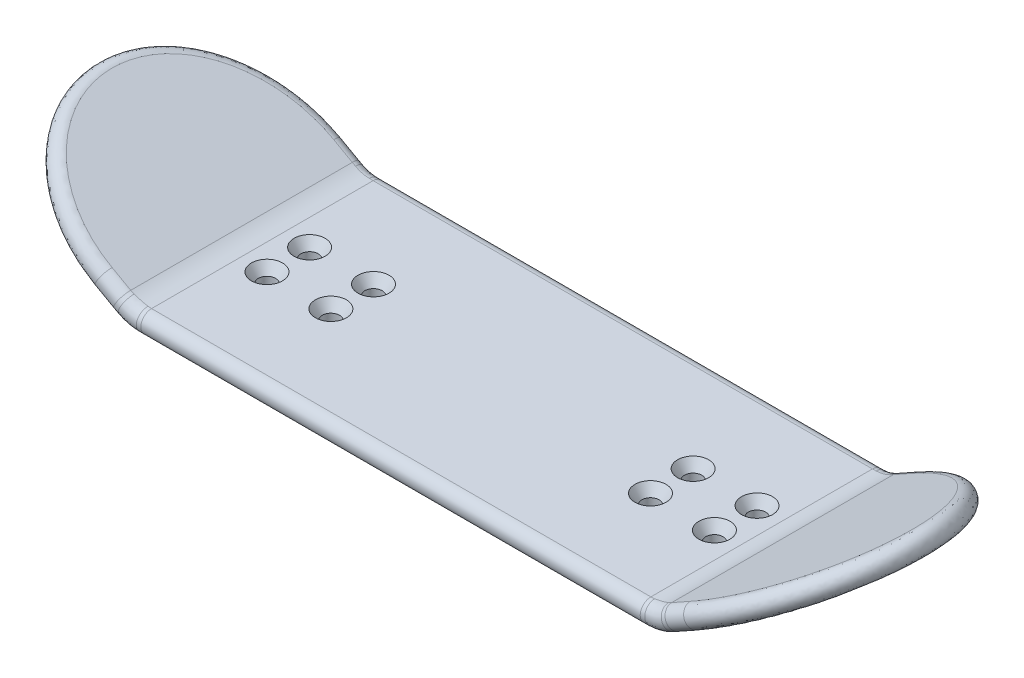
ISO-10303-21;
HEADER;
FILE_DESCRIPTION(('STEP AP214'),'2;1');
FILE_NAME('part.step','',(''),(''),'','','');
FILE_SCHEMA(('AUTOMOTIVE_DESIGN { 1 0 10303 214 1 1 1 1 }'));
ENDSEC;
DATA;
#1=APPLICATION_CONTEXT('core data for automotive mechanical design processes');
#2=APPLICATION_PROTOCOL_DEFINITION('international standard','automotive_design',2000,#1);
#3=PRODUCT_CONTEXT('',#1,'mechanical');
#4=PRODUCT('Part','Part','',(#3));
#5=PRODUCT_RELATED_PRODUCT_CATEGORY('part','',(#4));
#6=PRODUCT_DEFINITION_FORMATION('','',#4);
#7=PRODUCT_DEFINITION_CONTEXT('part definition',#1,'design');
#8=PRODUCT_DEFINITION('design','',#6,#7);
#9=PRODUCT_DEFINITION_SHAPE('','',#8);
#10=(LENGTH_UNIT() NAMED_UNIT(*) SI_UNIT(.MILLI.,.METRE.));
#11=(NAMED_UNIT(*) PLANE_ANGLE_UNIT() SI_UNIT($,.RADIAN.));
#12=(NAMED_UNIT(*) SI_UNIT($,.STERADIAN.) SOLID_ANGLE_UNIT());
#13=UNCERTAINTY_MEASURE_WITH_UNIT(LENGTH_MEASURE(1.E-05),#10,'distance_accuracy_value','');
#14=(GEOMETRIC_REPRESENTATION_CONTEXT(3) GLOBAL_UNCERTAINTY_ASSIGNED_CONTEXT((#13)) GLOBAL_UNIT_ASSIGNED_CONTEXT((#10,
#11,#12)) REPRESENTATION_CONTEXT('',''));
#15=CARTESIAN_POINT('',(0.,0.,0.));
#16=DIRECTION('',(0.,0.,1.));
#17=DIRECTION('',(1.,0.,0.));
#18=AXIS2_PLACEMENT_3D('',#15,#16,#17);
#19=CARTESIAN_POINT('',(29.7616711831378,1.27,-13.208));
#20=DIRECTION('',(1.,0.,0.));
#21=DIRECTION('',(0.,0.,-1.));
#22=AXIS2_PLACEMENT_3D('',#19,#20,#21);
#23=CYLINDRICAL_SURFACE('',#22,1.27);
#24=CARTESIAN_POINT('',(-29.7616711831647,2.54,-13.208));
#25=CARTESIAN_POINT('',(-29.7616711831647,2.54,-14.0546666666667));
#26=CARTESIAN_POINT('',(-29.7616711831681,1.905,-15.113));
#27=CARTESIAN_POINT('',(-29.761671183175,0.634999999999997,-15.113));
#28=CARTESIAN_POINT('',(-29.7616711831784,0.,-14.0546666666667));
#29=CARTESIAN_POINT('',(-29.7616711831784,0.,-13.208));
#30=(BOUNDED_CURVE() B_SPLINE_CURVE(5,(#24,#25,#26,#27,#28,#29),.UNSPECIFIED.,.F.,
.F.) B_SPLINE_CURVE_WITH_KNOTS((6,6),(0.,1.),
.UNSPECIFIED.) CURVE() GEOMETRIC_REPRESENTATION_ITEM() RATIONAL_B_SPLINE_CURVE((1.,
0.599999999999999,0.399999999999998,0.399999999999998,0.599999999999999,1.)) REPRESENTATION_ITEM(''));
#31=CARTESIAN_POINT('',(-29.7616711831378,2.54,-13.208));
#32=VERTEX_POINT('',#31);
#33=CARTESIAN_POINT('',(-29.7616711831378,0.,-13.208));
#34=VERTEX_POINT('',#33);
#35=EDGE_CURVE('E11',#32,#34,#30,.T.);
#36=ORIENTED_EDGE('',*,*,#35,.F.);
#37=DIRECTION('',(1.,0.,0.));
#38=VECTOR('',#37,1.);
#39=CARTESIAN_POINT('',(-31.75,2.54,-13.208));
#40=LINE('',#39,#38);
#41=CARTESIAN_POINT('',(29.7616711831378,2.54,-13.208));
#42=VERTEX_POINT('',#41);
#43=EDGE_CURVE('E182',#42,#32,#40,.F.);
#44=ORIENTED_EDGE('',*,*,#43,.F.);
#45=CARTESIAN_POINT('',(29.7616711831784,0.,-13.208));
#46=CARTESIAN_POINT('',(29.7616711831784,0.,-14.0546666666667));
#47=CARTESIAN_POINT('',(29.761671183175,0.634999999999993,-15.113));
#48=CARTESIAN_POINT('',(29.7616711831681,1.90500000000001,-15.113));
#49=CARTESIAN_POINT('',(29.7616711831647,2.54000000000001,-14.0546666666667));
#50=CARTESIAN_POINT('',(29.7616711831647,2.54,-13.208));
#51=(BOUNDED_CURVE() B_SPLINE_CURVE(5,(#45,#46,#47,#48,#49,#50),.UNSPECIFIED.,.F.,
.F.) B_SPLINE_CURVE_WITH_KNOTS((6,6),(0.,1.),
.UNSPECIFIED.) CURVE() GEOMETRIC_REPRESENTATION_ITEM() RATIONAL_B_SPLINE_CURVE((1.,
0.599999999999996,0.399999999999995,0.399999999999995,0.599999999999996,1.)) REPRESENTATION_ITEM(''));
#52=CARTESIAN_POINT('',(29.7616711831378,0.,-13.208));
#53=VERTEX_POINT('',#52);
#54=EDGE_CURVE('E48',#42,#53,#51,.F.);
#55=ORIENTED_EDGE('',*,*,#54,.T.);
#56=DIRECTION('',(-1.,0.,0.));
#57=VECTOR('',#56,1.);
#58=CARTESIAN_POINT('',(29.7616711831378,0.,-13.208));
#59=LINE('',#58,#57);
#60=EDGE_CURVE('E185',#34,#53,#59,.F.);
#61=ORIENTED_EDGE('',*,*,#60,.F.);
#62=EDGE_LOOP('',(#36,#44,#55,#61));
#63=FACE_BOUND('',#62,.T.);
#64=ADVANCED_FACE('F38',(#63),#23,.T.);
#65=CARTESIAN_POINT('',(29.7616711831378,0.,-13.208));
#66=CARTESIAN_POINT('',(29.9827340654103,0.,-13.2079999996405));
#67=CARTESIAN_POINT('',(30.2030145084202,0.,-13.2032087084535));
#68=CARTESIAN_POINT('',(30.4244474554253,0.,-13.1936148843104));
#69=CARTESIAN_POINT('',(29.7616711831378,0.,-14.0546666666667));
#70=CARTESIAN_POINT('',(29.9827345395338,1.09314578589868E-12,-14.0546666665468));
#71=CARTESIAN_POINT('',(30.2030138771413,5.86551980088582E-13,-14.0530695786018));
#72=CARTESIAN_POINT('',(30.4244474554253,0.,-14.0498716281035));
#73=CARTESIAN_POINT('',(29.7616711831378,0.634999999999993,-15.113));
#74=CARTESIAN_POINT('',(29.9640545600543,0.63500000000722,-15.1130000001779));
#75=CARTESIAN_POINT('',(30.1658443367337,0.636581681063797,-15.1153956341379));
#76=CARTESIAN_POINT('',(30.3683657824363,0.639739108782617,-15.1201925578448));
#77=CARTESIAN_POINT('',(29.7616711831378,1.90500000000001,-15.113));
#78=CARTESIAN_POINT('',(29.9266948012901,1.90500000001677,-15.1130000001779));
#79=CARTESIAN_POINT('',(30.0915049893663,1.9097450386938,-15.1153956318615));
#80=CARTESIAN_POINT('',(30.2562024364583,1.91921732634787,-15.1201925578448));
#81=CARTESIAN_POINT('',(29.7616711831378,2.54000000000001,-14.0546666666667));
#82=CARTESIAN_POINT('',(29.9080150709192,2.54000000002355,-14.0546666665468));
#83=CARTESIAN_POINT('',(30.0543351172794,2.5463266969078,-14.0530695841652));
#84=CARTESIAN_POINT('',(30.2001207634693,2.55895643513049,-14.0498716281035));
#85=CARTESIAN_POINT('',(29.7616711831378,2.54,-13.208));
#86=CARTESIAN_POINT('',(29.9080143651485,2.54,-13.2079999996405));
#87=CARTESIAN_POINT('',(30.0543360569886,2.54632677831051,-13.203208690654));
#88=CARTESIAN_POINT('',(30.2001207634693,2.55895643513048,-13.1936148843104));
#89=(BOUNDED_SURFACE() B_SPLINE_SURFACE(5,3,((#65,#66,#67,#68),(#69,#70,#71,#72),(#73,#74,#75,
#76),(#77,#78,#79,#80),(#81,#82,#83,#84),(#85,#86,#87,#88)),.UNSPECIFIED.,.F.,.F.,
.F.) B_SPLINE_SURFACE_WITH_KNOTS((6,6),(4,4),(0.,1.),(0.258653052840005,0.260481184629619),
.UNSPECIFIED.) GEOMETRIC_REPRESENTATION_ITEM() RATIONAL_B_SPLINE_SURFACE(((1.,1.,1.,1.),
(0.599999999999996,0.599999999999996,0.599999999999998,0.599999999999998),(0.399999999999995,
0.399999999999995,0.399999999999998,0.399999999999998),(0.399999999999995,0.399999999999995,
0.399999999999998,0.399999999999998),(0.599999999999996,0.599999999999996,0.599999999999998,
0.599999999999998),(1.,1.,1.,1.))) REPRESENTATION_ITEM('') SURFACE());
#90=CARTESIAN_POINT('',(29.7616711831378,2.54,-13.208));
#91=CARTESIAN_POINT('',(29.9080143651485,2.54,-13.2079999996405));
#92=CARTESIAN_POINT('',(30.0543360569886,2.54632677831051,-13.203208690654));
#93=CARTESIAN_POINT('',(30.2001207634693,2.55895643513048,-13.1936148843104));
#94=(BOUNDED_CURVE() B_SPLINE_CURVE(3,(#90,#91,#92,#93),.UNSPECIFIED.,.F.,
.F.) B_SPLINE_CURVE_WITH_KNOTS((4,4),(0.258653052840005,0.260481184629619),
.UNSPECIFIED.) CURVE() GEOMETRIC_REPRESENTATION_ITEM() RATIONAL_B_SPLINE_CURVE((1.,1.,1.,1.)) REPRESENTATION_ITEM(''));
#95=CARTESIAN_POINT('',(30.2001207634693,2.55895643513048,-13.1936148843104));
#96=VERTEX_POINT('',#95);
#97=EDGE_CURVE('E251',#96,#42,#94,.F.);
#98=CARTESIAN_POINT('',(30.2001207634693,2.55895643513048,-13.1936148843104));
#99=CARTESIAN_POINT('',(30.2001207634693,2.55895643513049,-14.0498716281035));
#100=CARTESIAN_POINT('',(30.2562024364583,1.91921732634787,-15.1201925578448));
#101=CARTESIAN_POINT('',(30.3683657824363,0.639739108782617,-15.1201925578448));
#102=CARTESIAN_POINT('',(30.4244474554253,0.,-14.0498716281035));
#103=CARTESIAN_POINT('',(30.4244474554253,0.,-13.1936148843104));
#104=(BOUNDED_CURVE() B_SPLINE_CURVE(5,(#98,#99,#100,#101,#102,#103),.UNSPECIFIED.,.F.,
.F.) B_SPLINE_CURVE_WITH_KNOTS((6,6),(0.,1.),
.UNSPECIFIED.) CURVE() GEOMETRIC_REPRESENTATION_ITEM() RATIONAL_B_SPLINE_CURVE((1.,
0.599999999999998,0.399999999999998,0.399999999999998,0.599999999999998,1.)) REPRESENTATION_ITEM(''));
#105=CARTESIAN_POINT('',(30.4244474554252,0.,-13.1936148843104));
#106=VERTEX_POINT('',#105);
#107=EDGE_CURVE('E1469',#96,#106,#104,.T.);
#108=CARTESIAN_POINT('',(30.4244474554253,0.,-13.1936148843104));
#109=CARTESIAN_POINT('',(30.2030145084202,0.,-13.2032087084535));
#110=CARTESIAN_POINT('',(29.9827340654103,0.,-13.2079999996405));
#111=CARTESIAN_POINT('',(29.7616711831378,0.,-13.208));
#112=(BOUNDED_CURVE() B_SPLINE_CURVE(3,(#108,#109,#110,#111),.UNSPECIFIED.,.F.,
.F.) B_SPLINE_CURVE_WITH_KNOTS((4,4),(0.258653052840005,0.260481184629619),
.UNSPECIFIED.) CURVE() GEOMETRIC_REPRESENTATION_ITEM() RATIONAL_B_SPLINE_CURVE((1.,1.,1.,1.)) REPRESENTATION_ITEM(''));
#113=EDGE_CURVE('E343',#53,#106,#112,.F.);
#114=ORIENTED_EDGE('',*,*,#54,.F.);
#115=ORIENTED_EDGE('',*,*,#97,.F.);
#116=ORIENTED_EDGE('',*,*,#107,.T.);
#117=ORIENTED_EDGE('',*,*,#113,.F.);
#118=EDGE_LOOP('',(#114,#115,#116,#117));
#119=FACE_BOUND('',#118,.T.);
#120=ADVANCED_FACE('F828',(#119),#89,.T.);
#121=CARTESIAN_POINT('',(30.4244474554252,0.,-13.1936148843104));
#122=CARTESIAN_POINT('',(31.2906680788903,0.,-13.1560849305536));
#123=CARTESIAN_POINT('',(32.1507698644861,0.224431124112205,-13.1560849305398));
#124=CARTESIAN_POINT('',(32.906552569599,0.647669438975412,-13.1936148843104));
#125=CARTESIAN_POINT('',(30.4244474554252,0.,-14.0498716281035));
#126=CARTESIAN_POINT('',(31.2906714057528,6.40103732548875E-10,-14.0373615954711));
#127=CARTESIAN_POINT('',(32.1507669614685,0.224429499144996,-14.0373615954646));
#128=CARTESIAN_POINT('',(32.906552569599,0.647669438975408,-14.0498716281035));
#129=CARTESIAN_POINT('',(30.3683657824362,0.639739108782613,-15.1201925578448));
#130=CARTESIAN_POINT('',(31.1604569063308,0.652088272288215,-15.1389540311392));
#131=CARTESIAN_POINT('',(31.9457673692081,0.857003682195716,-15.1389540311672));
#132=CARTESIAN_POINT('',(32.6429054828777,1.23324735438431,-15.1201925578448));
#133=CARTESIAN_POINT('',(30.2562024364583,1.91921732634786,-15.1201925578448));
#134=CARTESIAN_POINT('',(30.9000451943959,1.95624682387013,-15.1389449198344));
#135=CARTESIAN_POINT('',(31.5357618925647,2.12212790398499,-15.1389449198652));
#136=CARTESIAN_POINT('',(32.1156113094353,2.40440318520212,-15.1201925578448));
#137=CARTESIAN_POINT('',(30.2001207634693,2.55895643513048,-14.0498716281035));
#138=CARTESIAN_POINT('',(30.769859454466,2.60831417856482,-14.037373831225));
#139=CARTESIAN_POINT('',(31.3307474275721,2.7546697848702,-14.0373738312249));
#140=CARTESIAN_POINT('',(31.851964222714,2.98998110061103,-14.0498716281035));
#141=CARTESIAN_POINT('',(30.2001207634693,2.55895643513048,-13.1936148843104));
#142=CARTESIAN_POINT('',(30.7698661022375,2.60831475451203,-13.1561210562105));
#143=CARTESIAN_POINT('',(31.3307413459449,2.75466703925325,-13.1561210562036));
#144=CARTESIAN_POINT('',(31.851964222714,2.98998110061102,-13.1936148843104));
#145=(BOUNDED_SURFACE() B_SPLINE_SURFACE(5,3,((#121,#122,#123,#124),(#125,#126,#127,#128),(#129,
#130,#131,#132),(#133,#134,#135,#136),(#137,#138,#139,#140),(#141,#142,#143,#144)),
.UNSPECIFIED.,.F.,.F.,.F.) B_SPLINE_SURFACE_WITH_KNOTS((6,6),(4,4),(0.,1.),(0.260481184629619,
0.267623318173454),
.UNSPECIFIED.) GEOMETRIC_REPRESENTATION_ITEM() RATIONAL_B_SPLINE_SURFACE(((1.,1.,1.,1.),
(0.599999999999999,0.599999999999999,0.599999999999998,0.599999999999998),(0.399999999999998,
0.399999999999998,0.399999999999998,0.399999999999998),(0.399999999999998,0.399999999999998,
0.399999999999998,0.399999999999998),(0.599999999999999,0.599999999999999,0.599999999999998,
0.599999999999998),(1.,1.,1.,1.))) REPRESENTATION_ITEM('') SURFACE());
#146=CARTESIAN_POINT('',(30.2001207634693,2.55895643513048,-13.1936148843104));
#147=CARTESIAN_POINT('',(30.7698661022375,2.60831475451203,-13.1561210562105));
#148=CARTESIAN_POINT('',(31.3307413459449,2.75466703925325,-13.1561210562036));
#149=CARTESIAN_POINT('',(31.851964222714,2.98998110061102,-13.1936148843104));
#150=(BOUNDED_CURVE() B_SPLINE_CURVE(3,(#146,#147,#148,#149),.UNSPECIFIED.,.F.,
.F.) B_SPLINE_CURVE_WITH_KNOTS((4,4),(0.260481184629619,0.267623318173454),
.UNSPECIFIED.) CURVE() GEOMETRIC_REPRESENTATION_ITEM() RATIONAL_B_SPLINE_CURVE((1.,1.,1.,1.)) REPRESENTATION_ITEM(''));
#151=CARTESIAN_POINT('',(31.851964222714,2.98998110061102,-13.1936148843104));
#152=VERTEX_POINT('',#151);
#153=EDGE_CURVE('E1467',#152,#96,#150,.F.);
#154=CARTESIAN_POINT('',(31.851964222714,2.98998110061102,-13.1936148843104));
#155=CARTESIAN_POINT('',(31.851964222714,2.98998110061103,-14.0498716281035));
#156=CARTESIAN_POINT('',(32.1156113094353,2.40440318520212,-15.1201925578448));
#157=CARTESIAN_POINT('',(32.6429054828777,1.23324735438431,-15.1201925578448));
#158=CARTESIAN_POINT('',(32.906552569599,0.647669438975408,-14.0498716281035));
#159=CARTESIAN_POINT('',(32.906552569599,0.647669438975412,-13.1936148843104));
#160=(BOUNDED_CURVE() B_SPLINE_CURVE(5,(#154,#155,#156,#157,#158,#159),.UNSPECIFIED.,.F.,
.F.) B_SPLINE_CURVE_WITH_KNOTS((6,6),(0.,1.),
.UNSPECIFIED.) CURVE() GEOMETRIC_REPRESENTATION_ITEM() RATIONAL_B_SPLINE_CURVE((1.,
0.599999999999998,0.399999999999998,0.399999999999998,0.599999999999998,1.)) REPRESENTATION_ITEM(''));
#161=CARTESIAN_POINT('',(32.906552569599,0.647669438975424,-13.1936148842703));
#162=VERTEX_POINT('',#161);
#163=EDGE_CURVE('E805',#152,#162,#160,.T.);
#164=CARTESIAN_POINT('',(32.906552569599,0.647669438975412,-13.1936148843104));
#165=CARTESIAN_POINT('',(32.1507698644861,0.224431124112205,-13.1560849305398));
#166=CARTESIAN_POINT('',(31.2906680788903,0.,-13.1560849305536));
#167=CARTESIAN_POINT('',(30.4244474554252,0.,-13.1936148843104));
#168=(BOUNDED_CURVE() B_SPLINE_CURVE(3,(#164,#165,#166,#167),.UNSPECIFIED.,.F.,
.F.) B_SPLINE_CURVE_WITH_KNOTS((4,4),(0.260481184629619,0.267623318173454),
.UNSPECIFIED.) CURVE() GEOMETRIC_REPRESENTATION_ITEM() RATIONAL_B_SPLINE_CURVE((1.,1.,1.,1.)) REPRESENTATION_ITEM(''));
#169=EDGE_CURVE('E858',#106,#162,#168,.F.);
#170=ORIENTED_EDGE('',*,*,#107,.F.);
#171=ORIENTED_EDGE('',*,*,#153,.F.);
#172=ORIENTED_EDGE('',*,*,#163,.T.);
#173=ORIENTED_EDGE('',*,*,#169,.F.);
#174=EDGE_LOOP('',(#170,#171,#172,#173));
#175=FACE_BOUND('',#174,.T.);
#176=ADVANCED_FACE('F813',(#175),#145,.T.);
#177=CARTESIAN_POINT('',(32.906552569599,0.647669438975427,-13.1936148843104));
#178=CARTESIAN_POINT('',(33.0997541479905,0.755862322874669,-13.203208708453));
#179=CARTESIAN_POINT('',(33.2919501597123,0.863492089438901,-13.2079999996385));
#180=CARTESIAN_POINT('',(33.4848288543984,0.971504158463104,-13.208));
#181=CARTESIAN_POINT('',(32.906552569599,0.647669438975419,-14.0498716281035));
#182=CARTESIAN_POINT('',(33.0997546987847,0.755862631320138,-14.0530695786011));
#183=CARTESIAN_POINT('',(33.2919497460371,0.86349185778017,-14.0546666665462));
#184=CARTESIAN_POINT('',(33.4848288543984,0.971504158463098,-14.0546666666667));
#185=CARTESIAN_POINT('',(32.6429054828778,1.23324735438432,-15.1201925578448));
#186=CARTESIAN_POINT('',(32.8211493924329,1.32944514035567,-15.1153956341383));
#187=CARTESIAN_POINT('',(32.9979850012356,1.42666027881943,-15.1130000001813));
#188=CARTESIAN_POINT('',(33.1745657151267,1.52554547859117,-15.113));
#189=CARTESIAN_POINT('',(32.1156113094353,2.40440318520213,-15.1201925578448));
#190=CARTESIAN_POINT('',(32.2639390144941,2.47661028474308,-15.1153956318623));
#191=CARTESIAN_POINT('',(32.4100553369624,2.55299702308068,-15.1130000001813));
#192=CARTESIAN_POINT('',(32.5540394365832,2.63362811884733,-15.113));
#193=CARTESIAN_POINT('',(31.8519642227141,2.98998110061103,-14.0498716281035));
#194=CARTESIAN_POINT('',(31.9853340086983,3.05019293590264,-14.0530695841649));
#195=CARTESIAN_POINT('',(32.1160903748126,3.11616532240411,-14.0546666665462));
#196=CARTESIAN_POINT('',(32.2437762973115,3.1876694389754,-14.0546666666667));
#197=CARTESIAN_POINT('',(31.8519642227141,2.98998110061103,-13.1936148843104));
#198=CARTESIAN_POINT('',(31.9853331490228,3.05019254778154,-13.2032086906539));
#199=CARTESIAN_POINT('',(32.1160909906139,3.11616566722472,-13.2079999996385));
#200=CARTESIAN_POINT('',(32.2437762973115,3.18766943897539,-13.208));
#201=(BOUNDED_SURFACE() B_SPLINE_SURFACE(5,3,((#177,#178,#179,#180),(#181,#182,#183,#184),(#185,
#186,#187,#188),(#189,#190,#191,#192),(#193,#194,#195,#196),(#197,#198,#199,#200)),
.UNSPECIFIED.,.F.,.F.,.F.) B_SPLINE_SURFACE_WITH_KNOTS((6,6),(4,4),(0.,1.),(0.267623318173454,
0.269451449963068),
.UNSPECIFIED.) GEOMETRIC_REPRESENTATION_ITEM() RATIONAL_B_SPLINE_SURFACE(((1.,1.,1.,1.),
(0.599999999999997,0.599999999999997,0.599999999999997,0.599999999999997),(0.399999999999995,
0.399999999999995,0.399999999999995,0.399999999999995),(0.399999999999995,0.399999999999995,
0.399999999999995,0.399999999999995),(0.599999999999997,0.599999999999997,0.599999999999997,
0.599999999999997),(1.,1.,1.,1.))) REPRESENTATION_ITEM('') SURFACE());
#202=CARTESIAN_POINT('',(31.8519642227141,2.98998110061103,-13.1936148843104));
#203=CARTESIAN_POINT('',(31.9853331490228,3.05019254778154,-13.2032086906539));
#204=CARTESIAN_POINT('',(32.1160909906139,3.11616566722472,-13.2079999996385));
#205=CARTESIAN_POINT('',(32.2437762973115,3.18766943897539,-13.208));
#206=(BOUNDED_CURVE() B_SPLINE_CURVE(3,(#202,#203,#204,#205),.UNSPECIFIED.,.F.,
.F.) B_SPLINE_CURVE_WITH_KNOTS((4,4),(0.267623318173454,0.269451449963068),
.UNSPECIFIED.) CURVE() GEOMETRIC_REPRESENTATION_ITEM() RATIONAL_B_SPLINE_CURVE((1.,1.,1.,1.)) REPRESENTATION_ITEM(''));
#207=CARTESIAN_POINT('',(32.2437762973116,3.18766943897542,-13.208));
#208=VERTEX_POINT('',#207);
#209=EDGE_CURVE('E1464',#208,#152,#206,.F.);
#210=CARTESIAN_POINT('',(32.2437762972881,3.18766943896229,-13.208));
#211=CARTESIAN_POINT('',(32.2437762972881,3.18766943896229,-14.0546666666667));
#212=CARTESIAN_POINT('',(32.5540394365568,2.63362811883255,-15.113));
#213=CARTESIAN_POINT('',(33.1745657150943,1.52554547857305,-15.113));
#214=CARTESIAN_POINT('',(33.484828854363,0.971504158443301,-14.0546666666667));
#215=CARTESIAN_POINT('',(33.4848288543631,0.971504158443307,-13.208));
#216=(BOUNDED_CURVE() B_SPLINE_CURVE(5,(#210,#211,#212,#213,#214,#215),.UNSPECIFIED.,.F.,
.F.) B_SPLINE_CURVE_WITH_KNOTS((6,6),(0.,1.),
.UNSPECIFIED.) CURVE() GEOMETRIC_REPRESENTATION_ITEM() RATIONAL_B_SPLINE_CURVE((1.,
0.599999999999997,0.399999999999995,0.399999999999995,0.599999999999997,1.)) REPRESENTATION_ITEM(''));
#217=CARTESIAN_POINT('',(33.4848288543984,0.971504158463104,-13.208));
#218=VERTEX_POINT('',#217);
#219=EDGE_CURVE('E1470',#208,#218,#216,.T.);
#220=CARTESIAN_POINT('',(33.4848288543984,0.971504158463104,-13.208));
#221=CARTESIAN_POINT('',(33.2919501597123,0.863492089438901,-13.2079999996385));
#222=CARTESIAN_POINT('',(33.0997541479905,0.755862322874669,-13.203208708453));
#223=CARTESIAN_POINT('',(32.906552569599,0.647669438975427,-13.1936148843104));
#224=(BOUNDED_CURVE() B_SPLINE_CURVE(3,(#220,#221,#222,#223),.UNSPECIFIED.,.F.,
.F.) B_SPLINE_CURVE_WITH_KNOTS((4,4),(0.267623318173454,0.269451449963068),
.UNSPECIFIED.) CURVE() GEOMETRIC_REPRESENTATION_ITEM() RATIONAL_B_SPLINE_CURVE((1.,1.,1.,1.)) REPRESENTATION_ITEM(''));
#225=EDGE_CURVE('E1448',#162,#218,#224,.F.);
#226=ORIENTED_EDGE('',*,*,#163,.F.);
#227=ORIENTED_EDGE('',*,*,#209,.F.);
#228=ORIENTED_EDGE('',*,*,#219,.T.);
#229=ORIENTED_EDGE('',*,*,#225,.F.);
#230=EDGE_LOOP('',(#226,#227,#228,#229));
#231=FACE_BOUND('',#230,.T.);
#232=ADVANCED_FACE('F827',(#231),#201,.T.);
#233=CARTESIAN_POINT('',(35.0809474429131,3.32090792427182,-13.208));
#234=DIRECTION('',(0.87250601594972,0.488603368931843,0.));
#235=DIRECTION('',(-0.488603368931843,0.87250601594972,0.));
#236=AXIS2_PLACEMENT_3D('',#233,#234,#235);
#237=CYLINDRICAL_SURFACE('',#236,1.27);
#238=ORIENTED_EDGE('',*,*,#219,.F.);
#239=DIRECTION('',(0.87250601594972,0.488603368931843,0.));
#240=VECTOR('',#239,1.);
#241=CARTESIAN_POINT('',(30.5089474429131,2.21616528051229,-13.208));
#242=LINE('',#241,#240);
#243=CARTESIAN_POINT('',(34.4604211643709,4.42899056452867,-13.208));
#244=VERTEX_POINT('',#243);
#245=EDGE_CURVE('E1025',#244,#208,#242,.F.);
#246=ORIENTED_EDGE('',*,*,#245,.F.);
#247=CARTESIAN_POINT('',(35.7014737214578,2.21282528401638,-13.208));
#248=CARTESIAN_POINT('',(35.7014737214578,2.21282528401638,-14.0546666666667));
#249=CARTESIAN_POINT('',(35.3912105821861,2.76686660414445,-15.113));
#250=CARTESIAN_POINT('',(34.7706843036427,3.8749492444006,-15.113));
#251=CARTESIAN_POINT('',(34.4604211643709,4.42899056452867,-14.0546666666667));
#252=CARTESIAN_POINT('',(34.4604211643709,4.42899056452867,-13.208));
#253=(BOUNDED_CURVE() B_SPLINE_CURVE(5,(#247,#248,#249,#250,#251,#252),.UNSPECIFIED.,.F.,
.F.) B_SPLINE_CURVE_WITH_KNOTS((6,6),(0.,1.),
.UNSPECIFIED.) CURVE() GEOMETRIC_REPRESENTATION_ITEM() RATIONAL_B_SPLINE_CURVE((1.,
0.600000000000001,0.400000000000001,0.400000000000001,0.600000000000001,1.)) REPRESENTATION_ITEM(''));
#254=CARTESIAN_POINT('',(35.7014737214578,2.21282528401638,-13.208));
#255=VERTEX_POINT('',#254);
#256=EDGE_CURVE('E64',#244,#255,#253,.F.);
#257=ORIENTED_EDGE('',*,*,#256,.T.);
#258=DIRECTION('',(-0.87250601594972,-0.488603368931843,0.));
#259=VECTOR('',#258,1.);
#260=CARTESIAN_POINT('',(35.7014737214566,2.21282528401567,-13.208));
#261=LINE('',#260,#259);
#262=EDGE_CURVE('E1460',#218,#255,#261,.F.);
#263=ORIENTED_EDGE('',*,*,#262,.F.);
#264=EDGE_LOOP('',(#238,#246,#257,#263));
#265=FACE_BOUND('',#264,.T.);
#266=ADVANCED_FACE('F1136',(#265),#237,.T.);
#267=CARTESIAN_POINT('',(35.7014737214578,2.21282528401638,-13.208));
#268=CARTESIAN_POINT('',(36.1780713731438,2.47971996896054,-13.2080000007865));
#269=CARTESIAN_POINT('',(36.6161184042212,2.72502630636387,-13.1846806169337));
#270=CARTESIAN_POINT('',(37.4940067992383,3.21664380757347,-13.094295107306));
#271=CARTESIAN_POINT('',(37.9317371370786,3.46177279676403,-13.0269758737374));
#272=CARTESIAN_POINT('',(39.2331386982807,4.19055767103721,-12.7591225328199));
#273=CARTESIAN_POINT('',(40.0848381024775,4.66750933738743,-12.49229388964));
#274=CARTESIAN_POINT('',(42.5292834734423,6.0363987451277,-11.4459860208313));
#275=CARTESIAN_POINT('',(44.0161494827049,6.86904371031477,-10.4116615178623));
#276=CARTESIAN_POINT('',(46.4341974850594,8.22315059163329,-7.89530334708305));
#277=CARTESIAN_POINT('',(47.3723835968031,8.74853481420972,-6.40962820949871));
#278=CARTESIAN_POINT('',(48.6034054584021,9.43790705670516,-3.28825034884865));
#279=CARTESIAN_POINT('',(48.9094737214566,9.60930528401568,-1.63554880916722));
#280=CARTESIAN_POINT('',(48.9094737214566,9.60930528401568,1.63554880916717));
#281=CARTESIAN_POINT('',(48.6034054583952,9.43790705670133,3.28825034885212));
#282=CARTESIAN_POINT('',(47.3723835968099,8.74853481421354,6.40962820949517));
#283=CARTESIAN_POINT('',(46.4341974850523,8.22315059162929,7.89530334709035));
#284=CARTESIAN_POINT('',(44.0161494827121,6.86904371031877,10.4116615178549));
#285=CARTESIAN_POINT('',(42.5292834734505,6.03639874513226,11.4459860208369));
#286=CARTESIAN_POINT('',(40.0848381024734,4.66750933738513,12.4922938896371));
#287=CARTESIAN_POINT('',(39.2331386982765,4.19055767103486,12.7591225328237));
#288=CARTESIAN_POINT('',(37.9317371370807,3.46177279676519,13.0269758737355));
#289=CARTESIAN_POINT('',(37.4940067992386,3.21664380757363,13.0942951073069));
#290=CARTESIAN_POINT('',(36.6161184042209,2.7250263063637,13.1846806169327));
#291=CARTESIAN_POINT('',(36.178071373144,2.47971996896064,13.2080000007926));
#292=CARTESIAN_POINT('',(35.7014737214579,2.2128252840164,13.208));
#293=CARTESIAN_POINT('',(35.7014737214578,2.21282528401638,-14.0546666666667));
#294=CARTESIAN_POINT('',(36.1676196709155,2.47386701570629,-14.0546666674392));
#295=CARTESIAN_POINT('',(36.6303881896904,2.73301738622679,-14.0315370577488));
#296=CARTESIAN_POINT('',(37.5505735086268,3.24832116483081,-13.9388246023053));
#297=CARTESIAN_POINT('',(38.0093291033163,3.50522429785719,-13.8693091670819));
#298=CARTESIAN_POINT('',(39.3737133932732,4.26927950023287,-13.5917352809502));
#299=CARTESIAN_POINT('',(40.2673093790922,4.76969325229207,-13.3143021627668));
#300=CARTESIAN_POINT('',(42.8386610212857,6.20965017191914,-12.2215347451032));
#301=CARTESIAN_POINT('',(44.4073503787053,7.08811621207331,-11.1387613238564));
#302=CARTESIAN_POINT('',(46.9785596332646,8.52799339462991,-8.47878063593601));
#303=CARTESIAN_POINT('',(47.9839550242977,9.09101481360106,-6.9013635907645));
#304=CARTESIAN_POINT('',(49.3142396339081,9.83597419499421,-3.55163822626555));
#305=CARTESIAN_POINT('',(49.6481954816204,10.022989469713,-1.77024641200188));
#306=CARTESIAN_POINT('',(49.6481954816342,10.0229894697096,1.77024641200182));
#307=CARTESIAN_POINT('',(49.3142396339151,9.83597419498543,3.55163822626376));
#308=CARTESIAN_POINT('',(47.9839550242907,9.09101481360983,6.90136359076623));
#309=CARTESIAN_POINT('',(46.9785596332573,8.52799339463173,8.47878063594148));
#310=CARTESIAN_POINT('',(44.4073503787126,7.08811621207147,11.1387613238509));
#311=CARTESIAN_POINT('',(42.8386610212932,6.20965017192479,12.2215347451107));
#312=CARTESIAN_POINT('',(40.2673093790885,4.76969325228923,13.314302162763));
#313=CARTESIAN_POINT('',(39.3737133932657,4.26927950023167,13.5917352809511));
#314=CARTESIAN_POINT('',(38.00932910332,3.50522429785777,13.8693091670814));
#315=CARTESIAN_POINT('',(37.5505735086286,3.24832116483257,13.9388246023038));
#316=CARTESIAN_POINT('',(36.6303881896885,2.73301738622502,14.0315370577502));
#317=CARTESIAN_POINT('',(36.1676196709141,2.47386701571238,14.0546666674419));
#318=CARTESIAN_POINT('',(35.7014737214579,2.21282528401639,14.0546666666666));
#319=CARTESIAN_POINT('',(35.3912105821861,2.76686660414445,-15.113));
#320=CARTESIAN_POINT('',(35.8442919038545,3.02059214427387,-15.113000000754));
#321=CARTESIAN_POINT('',(36.3379622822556,3.29704755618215,-15.0901076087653));
#322=CARTESIAN_POINT('',(37.3110187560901,3.84195918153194,-14.9944864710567));
#323=CARTESIAN_POINT('',(37.7960559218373,4.1135799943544,-14.9222257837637));
#324=CARTESIAN_POINT('',(39.2391686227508,4.92172310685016,-14.6325012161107));
#325=CARTESIAN_POINT('',(40.1851353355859,5.45146446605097,-14.3418125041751));
#326=CARTESIAN_POINT('',(42.9151198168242,6.98025577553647,-13.1909706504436));
#327=CARTESIAN_POINT('',(44.5860883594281,7.91599815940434,-12.0476360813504));
#328=CARTESIAN_POINT('',(47.3487491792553,9.4630882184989,-9.20812724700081));
#329=CARTESIAN_POINT('',(48.4381561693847,10.0731561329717,-7.5160328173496));
#330=CARTESIAN_POINT('',(49.8925192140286,10.8875994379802,-3.88087307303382));
#331=CARTESIAN_POINT('',(50.2613345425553,11.0941360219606,-1.93861841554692));
#332=CARTESIAN_POINT('',(50.2613345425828,11.0941360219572,1.93861841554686));
#333=CARTESIAN_POINT('',(49.8925192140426,10.8875994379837,3.88087307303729));
#334=CARTESIAN_POINT('',(48.4381561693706,10.0731561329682,7.51603281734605));
#335=CARTESIAN_POINT('',(47.3487491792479,9.46308821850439,9.20812724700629));
#336=CARTESIAN_POINT('',(44.5860883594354,7.91599815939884,12.0476360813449));
#337=CARTESIAN_POINT('',(42.9151198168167,6.98025577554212,13.190970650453));
#338=CARTESIAN_POINT('',(40.1851353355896,5.45146446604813,14.3418125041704));
#339=CARTESIAN_POINT('',(39.2391686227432,4.92172310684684,14.6325012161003));
#340=CARTESIAN_POINT('',(37.7960559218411,4.11357999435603,14.9222257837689));
#341=CARTESIAN_POINT('',(37.3110187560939,3.84195918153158,14.9944864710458));
#342=CARTESIAN_POINT('',(36.3379622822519,3.29704755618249,15.0901076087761));
#343=CARTESIAN_POINT('',(35.8442919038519,3.02059214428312,15.1130000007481));
#344=CARTESIAN_POINT('',(35.3912105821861,2.76686660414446,15.113));
#345=CARTESIAN_POINT('',(34.7706843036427,3.8749492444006,-15.113));
#346=CARTESIAN_POINT('',(35.2237656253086,4.12867478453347,-15.113000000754));
#347=CARTESIAN_POINT('',(35.7174360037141,4.40513019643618,-15.0901076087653));
#348=CARTESIAN_POINT('',(36.6904924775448,4.95004182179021,-14.9944864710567));
#349=CARTESIAN_POINT('',(37.1755296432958,5.2216626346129,-14.9222257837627));
#350=CARTESIAN_POINT('',(38.6186423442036,6.02980574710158,-14.6325012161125));
#351=CARTESIAN_POINT('',(39.5646090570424,6.5595471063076,-14.3418125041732));
#352=CARTESIAN_POINT('',(42.2945935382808,8.08833841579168,-13.1909706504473));
#353=CARTESIAN_POINT('',(43.96556208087,9.02408079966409,-12.0476360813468));
#354=CARTESIAN_POINT('',(46.7282229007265,10.5711708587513,-9.20812724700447));
#355=CARTESIAN_POINT('',(47.8176298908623,11.1812387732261,-7.51603281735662));
#356=CARTESIAN_POINT('',(49.271992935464,11.9956820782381,-3.8808730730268));
#357=CARTESIAN_POINT('',(49.6408082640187,12.2022186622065,-1.93861841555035));
#358=CARTESIAN_POINT('',(49.6408082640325,12.2022186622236,1.9386184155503));
#359=CARTESIAN_POINT('',(49.2719929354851,11.9956820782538,3.88087307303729));
#360=CARTESIAN_POINT('',(47.8176298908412,11.1812387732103,7.51603281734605));
#361=CARTESIAN_POINT('',(46.7282229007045,10.571170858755,9.20812724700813));
#362=CARTESIAN_POINT('',(43.965562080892,9.02408079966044,12.0476360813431));
#363=CARTESIAN_POINT('',(42.2945935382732,8.08833841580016,13.1909706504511));
#364=CARTESIAN_POINT('',(39.5646090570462,6.55954710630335,14.3418125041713));
#365=CARTESIAN_POINT('',(38.6186423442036,6.02980574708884,14.6325012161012));
#366=CARTESIAN_POINT('',(37.1755296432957,5.22166263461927,14.9222257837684));
#367=CARTESIAN_POINT('',(36.6904924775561,4.95004182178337,14.9944864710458));
#368=CARTESIAN_POINT('',(35.7174360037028,4.40513019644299,15.0901076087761));
#369=CARTESIAN_POINT('',(35.2237656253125,4.12867478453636,15.1130000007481));
#370=CARTESIAN_POINT('',(34.7706843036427,3.87494924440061,15.113));
#371=CARTESIAN_POINT('',(34.4604211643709,4.42899056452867,-14.0546666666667));
#372=CARTESIAN_POINT('',(34.926567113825,4.69003229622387,-14.0546666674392));
#373=CARTESIAN_POINT('',(35.3893356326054,4.94918266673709,-14.0315370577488));
#374=CARTESIAN_POINT('',(36.309520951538,5.4644864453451,-13.9388246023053));
#375=CARTESIAN_POINT('',(36.7682765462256,5.72138957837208,-13.86930916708));
#376=CARTESIAN_POINT('',(38.1326608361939,6.48544478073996,-13.591735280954));
#377=CARTESIAN_POINT('',(39.0262568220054,6.98585853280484,-13.314302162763));
#378=CARTESIAN_POINT('',(41.5976084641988,8.42581545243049,-12.2215347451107));
#379=CARTESIAN_POINT('',(43.1662978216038,9.30428149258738,-11.1387613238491));
#380=CARTESIAN_POINT('',(45.7375070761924,10.7441586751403,-8.47878063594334));
#381=CARTESIAN_POINT('',(46.7429024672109,11.3071800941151,-6.90136359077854));
#382=CARTESIAN_POINT('',(48.0731870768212,12.0521394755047,-3.55163822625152));
#383=CARTESIAN_POINT('',(48.4071429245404,12.2391547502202,-1.77024641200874));
#384=CARTESIAN_POINT('',(48.4071429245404,12.239154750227,1.7702464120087));
#385=CARTESIAN_POINT('',(48.0731870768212,12.0521394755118,3.55163822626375));
#386=CARTESIAN_POINT('',(46.7429024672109,11.3071800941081,6.90136359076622));
#387=CARTESIAN_POINT('',(45.7375070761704,10.7441586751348,8.47878063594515));
#388=CARTESIAN_POINT('',(43.1662978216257,9.30428149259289,11.1387613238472));
#389=CARTESIAN_POINT('',(41.5976084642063,8.42581545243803,12.2215347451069));
#390=CARTESIAN_POINT('',(39.0262568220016,6.98585853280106,13.3143021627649));
#391=CARTESIAN_POINT('',(38.1326608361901,6.48544478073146,13.5917352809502));
#392=CARTESIAN_POINT('',(36.7682765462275,5.72138957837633,13.8693091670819));
#393=CARTESIAN_POINT('',(36.3095209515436,5.46448644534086,13.9388246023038));
#394=CARTESIAN_POINT('',(35.3893356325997,4.94918266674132,14.0315370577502));
#395=CARTESIAN_POINT('',(34.9265671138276,4.69003229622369,14.0546666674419));
#396=CARTESIAN_POINT('',(34.460421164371,4.42899056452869,14.0546666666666));
#397=CARTESIAN_POINT('',(34.4604211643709,4.42899056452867,-13.208));
#398=CARTESIAN_POINT('',(34.9370188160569,4.6958852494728,-13.2080000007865));
#399=CARTESIAN_POINT('',(35.3750658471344,4.94119158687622,-13.1846806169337));
#400=CARTESIAN_POINT('',(36.2529542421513,5.4328090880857,-13.094295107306));
#401=CARTESIAN_POINT('',(36.6906845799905,5.67793807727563,-13.0269758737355));
#402=CARTESIAN_POINT('',(37.9920861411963,6.40672295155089,-12.7591225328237));
#403=CARTESIAN_POINT('',(38.8437855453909,6.88367461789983,-12.4922938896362));
#404=CARTESIAN_POINT('',(41.288230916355,8.25256402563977,-11.4459860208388));
#405=CARTESIAN_POINT('',(42.7750969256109,9.08520899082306,-10.411661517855));
#406=CARTESIAN_POINT('',(45.1931449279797,10.4393158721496,-7.89530334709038));
#407=CARTESIAN_POINT('',(46.1313310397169,10.9647000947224,-6.40962820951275));
#408=CARTESIAN_POINT('',(47.3623529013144,11.654072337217,-3.28825034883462));
#409=CARTESIAN_POINT('',(47.6684211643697,11.825470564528,-1.63554880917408));
#410=CARTESIAN_POINT('',(47.6684211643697,11.825470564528,1.63554880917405));
#411=CARTESIAN_POINT('',(47.3623529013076,11.6540723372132,3.28825034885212));
#412=CARTESIAN_POINT('',(46.1313310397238,10.9647000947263,6.40962820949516));
#413=CARTESIAN_POINT('',(45.1931449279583,10.4393158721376,7.89530334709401));
#414=CARTESIAN_POINT('',(42.7750969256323,9.08520899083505,10.4116615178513));
#415=CARTESIAN_POINT('',(41.2882309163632,8.25256402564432,11.4459860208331));
#416=CARTESIAN_POINT('',(38.8437855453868,6.88367461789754,12.492293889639));
#417=CARTESIAN_POINT('',(37.9920861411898,6.40672295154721,12.7591225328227));
#418=CARTESIAN_POINT('',(36.6906845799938,5.67793807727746,13.0269758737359));
#419=CARTESIAN_POINT('',(36.2529542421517,5.43280908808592,13.0942951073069));
#420=CARTESIAN_POINT('',(35.375065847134,4.94119158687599,13.1846806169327));
#421=CARTESIAN_POINT('',(34.9370188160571,4.69588524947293,13.2080000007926));
#422=CARTESIAN_POINT('',(34.460421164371,4.42899056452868,13.208));
#423=(BOUNDED_SURFACE() B_SPLINE_SURFACE(5,3,((#267,#268,#269,#270,#271,#272,#273,#274,#275,
#276,#277,#278,#279,#280,#281,#282,#283,#284,#285,#286,#287,#288,#289,#290,#291,#292),(#293,
#294,#295,#296,#297,#298,#299,#300,#301,#302,#303,#304,#305,#306,#307,#308,#309,#310,#311,#312,
#313,#314,#315,#316,#317,#318),(#319,#320,#321,#322,#323,#324,#325,#326,#327,#328,#329,#330,
#331,#332,#333,#334,#335,#336,#337,#338,#339,#340,#341,#342,#343,#344),(#345,#346,#347,#348,
#349,#350,#351,#352,#353,#354,#355,#356,#357,#358,#359,#360,#361,#362,#363,#364,#365,#366,#367,
#368,#369,#370),(#371,#372,#373,#374,#375,#376,#377,#378,#379,#380,#381,#382,#383,#384,#385,
#386,#387,#388,#389,#390,#391,#392,#393,#394,#395,#396),(#397,#398,#399,#400,#401,#402,#403,
#404,#405,#406,#407,#408,#409,#410,#411,#412,#413,#414,#415,#416,#417,#418,#419,#420,#421,
#422)),.UNSPECIFIED.,.F.,.F.,.F.) B_SPLINE_SURFACE_WITH_KNOTS((6,6),(4,2,2,2,2,2,2,2,2,2,2,2,4),
(0.,1.),(0.28008918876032,0.286628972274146,0.293168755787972,0.306248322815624,
0.332407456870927,0.358566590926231,0.384725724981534,0.410884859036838,0.437043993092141,
0.463203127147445,0.476282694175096,0.482822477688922,0.489362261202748),
.UNSPECIFIED.) GEOMETRIC_REPRESENTATION_ITEM() RATIONAL_B_SPLINE_SURFACE(((1.,1.,1.,1.,1.,1.,1.,
1.,1.,1.,1.,1.,1.,1.,1.,1.,1.,1.,1.,1.,1.,1.,1.,1.,1.,1.),(0.600000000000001,0.600000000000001,
0.599999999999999,0.599999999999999,0.600000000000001,0.600000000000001,0.599999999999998,
0.599999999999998,0.600000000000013,0.600000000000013,0.599999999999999,0.599999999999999,
0.600000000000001,0.600000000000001,0.6,0.6,0.600000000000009,0.600000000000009,
0.599999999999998,0.599999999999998,0.599999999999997,0.599999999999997,0.599999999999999,
0.599999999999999,0.599999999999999,0.599999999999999),(0.400000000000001,0.400000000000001,
0.399999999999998,0.399999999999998,0.400000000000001,0.400000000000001,0.399999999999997,
0.399999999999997,0.400000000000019,0.400000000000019,0.399999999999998,0.399999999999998,
0.400000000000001,0.400000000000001,0.4,0.4,0.400000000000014,0.400000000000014,
0.399999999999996,0.399999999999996,0.399999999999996,0.399999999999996,0.399999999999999,
0.399999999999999,0.399999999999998,0.399999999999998),(0.400000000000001,0.400000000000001,
0.399999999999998,0.399999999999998,0.400000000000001,0.400000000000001,0.399999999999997,
0.399999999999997,0.400000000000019,0.400000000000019,0.399999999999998,0.399999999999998,
0.400000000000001,0.400000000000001,0.4,0.4,0.400000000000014,0.400000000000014,
0.399999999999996,0.399999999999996,0.399999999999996,0.399999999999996,0.399999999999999,
0.399999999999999,0.399999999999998,0.399999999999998),(0.600000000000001,0.600000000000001,
0.599999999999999,0.599999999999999,0.600000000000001,0.600000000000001,0.599999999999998,
0.599999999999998,0.600000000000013,0.600000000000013,0.599999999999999,0.599999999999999,
0.600000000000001,0.600000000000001,0.6,0.6,0.600000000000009,0.600000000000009,
0.599999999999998,0.599999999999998,0.599999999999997,0.599999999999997,0.599999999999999,
0.599999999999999,0.599999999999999,0.599999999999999),(1.,1.,1.,1.,1.,1.,1.,1.,1.,1.,1.,1.,1.,
1.,1.,1.,1.,1.,1.,1.,1.,1.,1.,1.,1.,1.))) REPRESENTATION_ITEM('') SURFACE());
#424=CARTESIAN_POINT('',(34.4604211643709,4.42899056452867,-13.208));
#425=CARTESIAN_POINT('',(34.9370188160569,4.6958852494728,-13.2080000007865));
#426=CARTESIAN_POINT('',(35.3750658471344,4.94119158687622,-13.1846806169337));
#427=CARTESIAN_POINT('',(36.2529542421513,5.4328090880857,-13.094295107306));
#428=CARTESIAN_POINT('',(36.6906845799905,5.67793807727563,-13.0269758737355));
#429=CARTESIAN_POINT('',(37.9920861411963,6.40672295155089,-12.7591225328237));
#430=CARTESIAN_POINT('',(38.8437855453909,6.88367461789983,-12.4922938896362));
#431=CARTESIAN_POINT('',(41.288230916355,8.25256402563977,-11.4459860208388));
#432=CARTESIAN_POINT('',(42.7750969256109,9.08520899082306,-10.411661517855));
#433=CARTESIAN_POINT('',(45.1931449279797,10.4393158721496,-7.89530334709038));
#434=CARTESIAN_POINT('',(46.1313310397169,10.9647000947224,-6.40962820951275));
#435=CARTESIAN_POINT('',(47.3623529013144,11.654072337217,-3.28825034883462));
#436=CARTESIAN_POINT('',(47.6684211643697,11.825470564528,-1.63554880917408));
#437=CARTESIAN_POINT('',(47.6684211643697,11.825470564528,1.63554880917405));
#438=CARTESIAN_POINT('',(47.3623529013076,11.6540723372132,3.28825034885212));
#439=CARTESIAN_POINT('',(46.1313310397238,10.9647000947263,6.40962820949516));
#440=CARTESIAN_POINT('',(45.1931449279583,10.4393158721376,7.89530334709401));
#441=CARTESIAN_POINT('',(42.7750969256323,9.08520899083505,10.4116615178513));
#442=CARTESIAN_POINT('',(41.2882309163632,8.25256402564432,11.4459860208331));
#443=CARTESIAN_POINT('',(38.8437855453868,6.88367461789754,12.492293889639));
#444=CARTESIAN_POINT('',(37.9920861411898,6.40672295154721,12.7591225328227));
#445=CARTESIAN_POINT('',(36.6906845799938,5.67793807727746,13.0269758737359));
#446=CARTESIAN_POINT('',(36.2529542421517,5.43280908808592,13.0942951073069));
#447=CARTESIAN_POINT('',(35.375065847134,4.94119158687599,13.1846806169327));
#448=CARTESIAN_POINT('',(34.9370188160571,4.69588524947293,13.2080000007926));
#449=CARTESIAN_POINT('',(34.460421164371,4.42899056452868,13.208));
#450=(BOUNDED_CURVE() B_SPLINE_CURVE(3,(#424,#425,#426,#427,#428,#429,#430,#431,#432,#433,#434,
#435,#436,#437,#438,#439,#440,#441,#442,#443,#444,#445,#446,#447,#448,#449),.UNSPECIFIED.,.F.,
.F.) B_SPLINE_CURVE_WITH_KNOTS((4,2,2,2,2,2,2,2,2,2,2,2,4),(0.28008918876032,0.286628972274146,
0.293168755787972,0.306248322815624,0.332407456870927,0.358566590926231,0.384725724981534,
0.410884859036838,0.437043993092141,0.463203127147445,0.476282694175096,0.482822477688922,
0.489362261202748),
.UNSPECIFIED.) CURVE() GEOMETRIC_REPRESENTATION_ITEM() RATIONAL_B_SPLINE_CURVE((1.,1.,1.,1.,1.,
1.,1.,1.,1.,1.,1.,1.,1.,1.,1.,1.,1.,1.,1.,1.,1.,1.,1.,1.,1.,1.)) REPRESENTATION_ITEM(''));
#451=CARTESIAN_POINT('',(34.460421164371,4.42899056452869,13.208));
#452=VERTEX_POINT('',#451);
#453=EDGE_CURVE('E1022',#452,#244,#450,.F.);
#454=CARTESIAN_POINT('',(34.460421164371,4.42899056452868,13.208));
#455=CARTESIAN_POINT('',(34.460421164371,4.42899056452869,14.0546666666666));
#456=CARTESIAN_POINT('',(34.7706843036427,3.87494924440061,15.113));
#457=CARTESIAN_POINT('',(35.3912105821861,2.76686660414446,15.113));
#458=CARTESIAN_POINT('',(35.7014737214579,2.21282528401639,14.0546666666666));
#459=CARTESIAN_POINT('',(35.7014737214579,2.2128252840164,13.208));
#460=(BOUNDED_CURVE() B_SPLINE_CURVE(5,(#454,#455,#456,#457,#458,#459),.UNSPECIFIED.,.F.,
.F.) B_SPLINE_CURVE_WITH_KNOTS((6,6),(0.,1.),
.UNSPECIFIED.) CURVE() GEOMETRIC_REPRESENTATION_ITEM() RATIONAL_B_SPLINE_CURVE((1.,
0.599999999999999,0.399999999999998,0.399999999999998,0.599999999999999,1.)) REPRESENTATION_ITEM(''));
#461=CARTESIAN_POINT('',(35.7014737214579,2.2128252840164,13.208));
#462=VERTEX_POINT('',#461);
#463=EDGE_CURVE('E55',#452,#462,#460,.T.);
#464=CARTESIAN_POINT('',(35.7014737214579,2.2128252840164,13.208));
#465=CARTESIAN_POINT('',(36.178071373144,2.47971996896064,13.2080000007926));
#466=CARTESIAN_POINT('',(36.6161184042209,2.7250263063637,13.1846806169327));
#467=CARTESIAN_POINT('',(37.4940067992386,3.21664380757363,13.0942951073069));
#468=CARTESIAN_POINT('',(37.9317371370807,3.46177279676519,13.0269758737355));
#469=CARTESIAN_POINT('',(39.2331386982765,4.19055767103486,12.7591225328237));
#470=CARTESIAN_POINT('',(40.0848381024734,4.66750933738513,12.4922938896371));
#471=CARTESIAN_POINT('',(42.5292834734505,6.03639874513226,11.4459860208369));
#472=CARTESIAN_POINT('',(44.0161494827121,6.86904371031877,10.4116615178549));
#473=CARTESIAN_POINT('',(46.4341974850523,8.22315059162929,7.89530334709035));
#474=CARTESIAN_POINT('',(47.3723835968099,8.74853481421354,6.40962820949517));
#475=CARTESIAN_POINT('',(48.6034054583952,9.43790705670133,3.28825034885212));
#476=CARTESIAN_POINT('',(48.9094737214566,9.60930528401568,1.63554880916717));
#477=CARTESIAN_POINT('',(48.9094737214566,9.60930528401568,-1.63554880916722));
#478=CARTESIAN_POINT('',(48.6034054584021,9.43790705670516,-3.28825034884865));
#479=CARTESIAN_POINT('',(47.3723835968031,8.74853481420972,-6.40962820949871));
#480=CARTESIAN_POINT('',(46.4341974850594,8.22315059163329,-7.89530334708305));
#481=CARTESIAN_POINT('',(44.0161494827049,6.86904371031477,-10.4116615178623));
#482=CARTESIAN_POINT('',(42.5292834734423,6.0363987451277,-11.4459860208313));
#483=CARTESIAN_POINT('',(40.0848381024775,4.66750933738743,-12.49229388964));
#484=CARTESIAN_POINT('',(39.2331386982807,4.19055767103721,-12.7591225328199));
#485=CARTESIAN_POINT('',(37.9317371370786,3.46177279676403,-13.0269758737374));
#486=CARTESIAN_POINT('',(37.4940067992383,3.21664380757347,-13.094295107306));
#487=CARTESIAN_POINT('',(36.6161184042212,2.72502630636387,-13.1846806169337));
#488=CARTESIAN_POINT('',(36.1780713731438,2.47971996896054,-13.2080000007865));
#489=CARTESIAN_POINT('',(35.7014737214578,2.21282528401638,-13.208));
#490=(BOUNDED_CURVE() B_SPLINE_CURVE(3,(#464,#465,#466,#467,#468,#469,#470,#471,#472,#473,#474,
#475,#476,#477,#478,#479,#480,#481,#482,#483,#484,#485,#486,#487,#488,#489),.UNSPECIFIED.,.F.,
.F.) B_SPLINE_CURVE_WITH_KNOTS((4,2,2,2,2,2,2,2,2,2,2,2,4),(0.28008918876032,0.286628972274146,
0.293168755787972,0.306248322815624,0.332407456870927,0.358566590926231,0.384725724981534,
0.410884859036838,0.437043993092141,0.463203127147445,0.476282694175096,0.482822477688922,
0.489362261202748),
.UNSPECIFIED.) CURVE() GEOMETRIC_REPRESENTATION_ITEM() RATIONAL_B_SPLINE_CURVE((1.,1.,1.,1.,1.,
1.,1.,1.,1.,1.,1.,1.,1.,1.,1.,1.,1.,1.,1.,1.,1.,1.,1.,1.,1.,1.)) REPRESENTATION_ITEM(''));
#491=EDGE_CURVE('E1766',#255,#462,#490,.F.);
#492=ORIENTED_EDGE('',*,*,#256,.F.);
#493=ORIENTED_EDGE('',*,*,#453,.F.);
#494=ORIENTED_EDGE('',*,*,#463,.T.);
#495=ORIENTED_EDGE('',*,*,#491,.F.);
#496=EDGE_LOOP('',(#492,#493,#494,#495));
#497=FACE_BOUND('',#496,.T.);
#498=ADVANCED_FACE('F1143',(#497),#423,.T.);
#499=CARTESIAN_POINT('',(32.864302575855,2.07958679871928,13.208));
#500=DIRECTION('',(-0.87250601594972,-0.488603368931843,0.));
#501=DIRECTION('',(0.488603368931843,-0.87250601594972,0.));
#502=AXIS2_PLACEMENT_3D('',#499,#500,#501);
#503=CYLINDRICAL_SURFACE('',#502,1.27);
#504=ORIENTED_EDGE('',*,*,#463,.F.);
#505=DIRECTION('',(-0.87250601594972,-0.488603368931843,0.));
#506=VECTOR('',#505,1.);
#507=CARTESIAN_POINT('',(30.5089474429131,2.21616528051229,13.208));
#508=LINE('',#507,#506);
#509=CARTESIAN_POINT('',(32.2437762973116,3.18766943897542,13.208));
#510=VERTEX_POINT('',#509);
#511=EDGE_CURVE('E1020',#510,#452,#508,.F.);
#512=ORIENTED_EDGE('',*,*,#511,.F.);
#513=CARTESIAN_POINT('',(33.4848288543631,0.971504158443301,13.208));
#514=CARTESIAN_POINT('',(33.484828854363,0.971504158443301,14.0546666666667));
#515=CARTESIAN_POINT('',(33.1745657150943,1.52554547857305,15.113));
#516=CARTESIAN_POINT('',(32.5540394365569,2.63362811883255,15.113));
#517=CARTESIAN_POINT('',(32.2437762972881,3.1876694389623,14.0546666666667));
#518=CARTESIAN_POINT('',(32.2437762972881,3.1876694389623,13.208));
#519=(BOUNDED_CURVE() B_SPLINE_CURVE(5,(#513,#514,#515,#516,#517,#518),.UNSPECIFIED.,.F.,
.F.) B_SPLINE_CURVE_WITH_KNOTS((6,6),(0.,1.),
.UNSPECIFIED.) CURVE() GEOMETRIC_REPRESENTATION_ITEM() RATIONAL_B_SPLINE_CURVE((1.,
0.599999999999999,0.399999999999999,0.399999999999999,0.599999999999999,1.)) REPRESENTATION_ITEM(''));
#520=CARTESIAN_POINT('',(33.4848288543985,0.971504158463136,13.208));
#521=VERTEX_POINT('',#520);
#522=EDGE_CURVE('E1475',#510,#521,#519,.F.);
#523=ORIENTED_EDGE('',*,*,#522,.T.);
#524=DIRECTION('',(0.87250601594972,0.488603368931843,0.));
#525=VECTOR('',#524,1.);
#526=CARTESIAN_POINT('',(33.4848288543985,0.971504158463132,13.208));
#527=LINE('',#526,#525);
#528=EDGE_CURVE('E1454',#462,#521,#527,.F.);
#529=ORIENTED_EDGE('',*,*,#528,.F.);
#530=EDGE_LOOP('',(#504,#512,#523,#529));
#531=FACE_BOUND('',#530,.T.);
#532=ADVANCED_FACE('F735',(#531),#503,.T.);
#533=CARTESIAN_POINT('',(33.4848288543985,0.971504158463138,13.208));
#534=CARTESIAN_POINT('',(33.2919501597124,0.863492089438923,13.2079999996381));
#535=CARTESIAN_POINT('',(33.0997541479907,0.755862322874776,13.203208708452));
#536=CARTESIAN_POINT('',(32.9065525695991,0.64766943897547,13.1936148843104));
#537=CARTESIAN_POINT('',(33.4848288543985,0.971504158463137,14.0546666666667));
#538=CARTESIAN_POINT('',(33.2919497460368,0.863491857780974,14.0546666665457));
#539=CARTESIAN_POINT('',(33.0997546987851,0.7558626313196,14.0530695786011));
#540=CARTESIAN_POINT('',(32.9065525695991,0.647669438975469,14.0498716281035));
#541=CARTESIAN_POINT('',(33.1745657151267,1.52554547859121,15.113));
#542=CARTESIAN_POINT('',(32.9979850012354,1.42666027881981,15.1130000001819));
#543=CARTESIAN_POINT('',(32.8211493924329,1.32944514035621,15.1153956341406));
#544=CARTESIAN_POINT('',(32.6429054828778,1.23324735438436,15.1201925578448));
#545=CARTESIAN_POINT('',(32.5540394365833,2.63362811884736,15.113));
#546=CARTESIAN_POINT('',(32.4100553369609,2.55299702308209,15.1130000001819));
#547=CARTESIAN_POINT('',(32.2639390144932,2.47661028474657,15.1153956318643));
#548=CARTESIAN_POINT('',(32.1156113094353,2.40440318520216,15.1201925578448));
#549=CARTESIAN_POINT('',(32.2437762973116,3.18766943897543,14.0546666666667));
#550=CARTESIAN_POINT('',(32.1160903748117,3.1161653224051,14.0546666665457));
#551=CARTESIAN_POINT('',(31.9853340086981,3.05019293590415,14.0530695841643));
#552=CARTESIAN_POINT('',(31.8519642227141,2.98998110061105,14.0498716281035));
#553=CARTESIAN_POINT('',(32.2437762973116,3.18766943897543,13.208));
#554=CARTESIAN_POINT('',(32.1160909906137,3.11616566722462,13.2079999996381));
#555=CARTESIAN_POINT('',(31.9853331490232,3.0501925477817,13.2032086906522));
#556=CARTESIAN_POINT('',(31.8519642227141,2.98998110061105,13.1936148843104));
#557=(BOUNDED_SURFACE() B_SPLINE_SURFACE(5,3,((#533,#534,#535,#536),(#537,#538,#539,#540),(#541,
#542,#543,#544),(#545,#546,#547,#548),(#549,#550,#551,#552),(#553,#554,#555,#556)),
.UNSPECIFIED.,.F.,.F.,.F.) B_SPLINE_SURFACE_WITH_KNOTS((6,6),(4,4),(0.,1.),(0.5,
0.501828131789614),
.UNSPECIFIED.) GEOMETRIC_REPRESENTATION_ITEM() RATIONAL_B_SPLINE_SURFACE(((1.,1.,1.,1.),
(0.599999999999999,0.599999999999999,0.599999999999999,0.599999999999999),(0.399999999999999,
0.399999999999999,0.399999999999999,0.399999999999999),(0.399999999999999,0.399999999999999,
0.399999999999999,0.399999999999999),(0.599999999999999,0.599999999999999,0.599999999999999,
0.599999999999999),(1.,1.,1.,1.))) REPRESENTATION_ITEM('') SURFACE());
#558=CARTESIAN_POINT('',(32.2437762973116,3.18766943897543,13.208));
#559=CARTESIAN_POINT('',(32.1160909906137,3.11616566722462,13.2079999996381));
#560=CARTESIAN_POINT('',(31.9853331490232,3.0501925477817,13.2032086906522));
#561=CARTESIAN_POINT('',(31.8519642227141,2.98998110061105,13.1936148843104));
#562=(BOUNDED_CURVE() B_SPLINE_CURVE(3,(#558,#559,#560,#561),.UNSPECIFIED.,.F.,
.F.) B_SPLINE_CURVE_WITH_KNOTS((4,4),(0.5,0.501828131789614),
.UNSPECIFIED.) CURVE() GEOMETRIC_REPRESENTATION_ITEM() RATIONAL_B_SPLINE_CURVE((1.,1.,1.,1.)) REPRESENTATION_ITEM(''));
#563=CARTESIAN_POINT('',(31.8519642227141,2.98998110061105,13.1936148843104));
#564=VERTEX_POINT('',#563);
#565=EDGE_CURVE('E1461',#564,#510,#562,.F.);
#566=CARTESIAN_POINT('',(31.8519642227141,2.98998110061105,13.1936148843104));
#567=CARTESIAN_POINT('',(31.8519642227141,2.98998110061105,14.0498716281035));
#568=CARTESIAN_POINT('',(32.1156113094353,2.40440318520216,15.1201925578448));
#569=CARTESIAN_POINT('',(32.6429054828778,1.23324735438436,15.1201925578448));
#570=CARTESIAN_POINT('',(32.9065525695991,0.647669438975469,14.0498716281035));
#571=CARTESIAN_POINT('',(32.9065525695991,0.64766943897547,13.1936148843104));
#572=(BOUNDED_CURVE() B_SPLINE_CURVE(5,(#566,#567,#568,#569,#570,#571),.UNSPECIFIED.,.F.,
.F.) B_SPLINE_CURVE_WITH_KNOTS((6,6),(0.,1.),
.UNSPECIFIED.) CURVE() GEOMETRIC_REPRESENTATION_ITEM() RATIONAL_B_SPLINE_CURVE((1.,
0.599999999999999,0.399999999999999,0.399999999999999,0.599999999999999,1.)) REPRESENTATION_ITEM(''));
#573=CARTESIAN_POINT('',(32.906552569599,0.647669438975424,13.1936148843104));
#574=VERTEX_POINT('',#573);
#575=EDGE_CURVE('E1458',#564,#574,#572,.T.);
#576=CARTESIAN_POINT('',(32.9065525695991,0.64766943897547,13.1936148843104));
#577=CARTESIAN_POINT('',(33.0997541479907,0.755862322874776,13.203208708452));
#578=CARTESIAN_POINT('',(33.2919501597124,0.863492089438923,13.2079999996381));
#579=CARTESIAN_POINT('',(33.4848288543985,0.971504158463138,13.208));
#580=(BOUNDED_CURVE() B_SPLINE_CURVE(3,(#576,#577,#578,#579),.UNSPECIFIED.,.F.,
.F.) B_SPLINE_CURVE_WITH_KNOTS((4,4),(0.5,0.501828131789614),
.UNSPECIFIED.) CURVE() GEOMETRIC_REPRESENTATION_ITEM() RATIONAL_B_SPLINE_CURVE((1.,1.,1.,1.)) REPRESENTATION_ITEM(''));
#581=EDGE_CURVE('E1451',#521,#574,#580,.F.);
#582=ORIENTED_EDGE('',*,*,#522,.F.);
#583=ORIENTED_EDGE('',*,*,#565,.F.);
#584=ORIENTED_EDGE('',*,*,#575,.T.);
#585=ORIENTED_EDGE('',*,*,#581,.F.);
#586=EDGE_LOOP('',(#582,#583,#584,#585));
#587=FACE_BOUND('',#586,.T.);
#588=ADVANCED_FACE('F772',(#587),#557,.T.);
#589=CARTESIAN_POINT('',(32.906552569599,0.647669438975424,13.1936148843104));
#590=CARTESIAN_POINT('',(32.1507698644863,0.224431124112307,13.1560849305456));
#591=CARTESIAN_POINT('',(31.29066807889,0.,13.1560849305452));
#592=CARTESIAN_POINT('',(30.4244474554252,0.,13.1936148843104));
#593=CARTESIAN_POINT('',(32.906552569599,0.647669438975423,14.0498716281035));
#594=CARTESIAN_POINT('',(32.1507669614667,0.224429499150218,14.0373615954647));
#595=CARTESIAN_POINT('',(31.2906714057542,6.35160278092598E-10,14.0373615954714));
#596=CARTESIAN_POINT('',(30.4244474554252,0.,14.0498716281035));
#597=CARTESIAN_POINT('',(32.6429054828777,1.23324735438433,15.1201925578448));
#598=CARTESIAN_POINT('',(31.9457673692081,0.857003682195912,15.1389540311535));
#599=CARTESIAN_POINT('',(31.1604569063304,0.652088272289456,15.1389540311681));
#600=CARTESIAN_POINT('',(30.3683657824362,0.639739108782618,15.1201925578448));
#601=CARTESIAN_POINT('',(32.1156113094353,2.40440318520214,15.1201925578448));
#602=CARTESIAN_POINT('',(31.5357618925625,2.12212790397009,15.138944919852));
#603=CARTESIAN_POINT('',(30.9000451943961,1.95624682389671,15.1389449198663));
#604=CARTESIAN_POINT('',(30.2562024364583,1.91921732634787,15.1201925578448));
#605=CARTESIAN_POINT('',(31.8519642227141,2.98998110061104,14.0498716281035));
#606=CARTESIAN_POINT('',(31.3307474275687,2.75466978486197,14.0373738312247));
#607=CARTESIAN_POINT('',(30.7698594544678,2.6083141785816,14.0373738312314));
#608=CARTESIAN_POINT('',(30.2001207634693,2.55895643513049,14.0498716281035));
#609=CARTESIAN_POINT('',(31.8519642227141,2.98998110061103,13.1936148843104));
#610=CARTESIAN_POINT('',(31.3307413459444,2.75466703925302,13.1561210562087));
#611=CARTESIAN_POINT('',(30.769866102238,2.60831475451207,13.1561210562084));
#612=CARTESIAN_POINT('',(30.2001207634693,2.55895643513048,13.1936148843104));
#613=(BOUNDED_SURFACE() B_SPLINE_SURFACE(5,3,((#589,#590,#591,#592),(#593,#594,#595,#596),(#597,
#598,#599,#600),(#601,#602,#603,#604),(#605,#606,#607,#608),(#609,#610,#611,#612)),
.UNSPECIFIED.,.F.,.F.,.F.) B_SPLINE_SURFACE_WITH_KNOTS((6,6),(4,4),(0.,1.),(0.501828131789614,
0.508970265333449),
.UNSPECIFIED.) GEOMETRIC_REPRESENTATION_ITEM() RATIONAL_B_SPLINE_SURFACE(((1.,1.,1.,1.),
(0.599999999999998,0.599999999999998,0.599999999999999,0.599999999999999),(0.399999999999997,
0.399999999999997,0.399999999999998,0.399999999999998),(0.399999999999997,0.399999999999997,
0.399999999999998,0.399999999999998),(0.599999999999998,0.599999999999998,0.599999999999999,
0.599999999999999),(1.,1.,1.,1.))) REPRESENTATION_ITEM('') SURFACE());
#614=CARTESIAN_POINT('',(31.8519642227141,2.98998110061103,13.1936148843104));
#615=CARTESIAN_POINT('',(31.3307413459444,2.75466703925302,13.1561210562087));
#616=CARTESIAN_POINT('',(30.769866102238,2.60831475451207,13.1561210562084));
#617=CARTESIAN_POINT('',(30.2001207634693,2.55895643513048,13.1936148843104));
#618=(BOUNDED_CURVE() B_SPLINE_CURVE(3,(#614,#615,#616,#617),.UNSPECIFIED.,.F.,
.F.) B_SPLINE_CURVE_WITH_KNOTS((4,4),(0.501828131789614,0.508970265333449),
.UNSPECIFIED.) CURVE() GEOMETRIC_REPRESENTATION_ITEM() RATIONAL_B_SPLINE_CURVE((1.,1.,1.,1.)) REPRESENTATION_ITEM(''));
#619=CARTESIAN_POINT('',(30.2001207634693,2.55895643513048,13.1936148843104));
#620=VERTEX_POINT('',#619);
#621=EDGE_CURVE('E752',#620,#564,#618,.F.);
#622=CARTESIAN_POINT('',(30.2001207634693,2.55895643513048,13.1936148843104));
#623=CARTESIAN_POINT('',(30.2001207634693,2.55895643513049,14.0498716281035));
#624=CARTESIAN_POINT('',(30.2562024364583,1.91921732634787,15.1201925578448));
#625=CARTESIAN_POINT('',(30.3683657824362,0.639739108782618,15.1201925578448));
#626=CARTESIAN_POINT('',(30.4244474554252,0.,14.0498716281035));
#627=CARTESIAN_POINT('',(30.4244474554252,0.,13.1936148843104));
#628=(BOUNDED_CURVE() B_SPLINE_CURVE(5,(#622,#623,#624,#625,#626,#627),.UNSPECIFIED.,.F.,
.F.) B_SPLINE_CURVE_WITH_KNOTS((6,6),(0.,1.),
.UNSPECIFIED.) CURVE() GEOMETRIC_REPRESENTATION_ITEM() RATIONAL_B_SPLINE_CURVE((1.,
0.599999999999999,0.399999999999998,0.399999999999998,0.599999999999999,1.)) REPRESENTATION_ITEM(''));
#629=CARTESIAN_POINT('',(30.4244474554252,0.,13.1936148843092));
#630=VERTEX_POINT('',#629);
#631=EDGE_CURVE('E1459',#620,#630,#628,.T.);
#632=CARTESIAN_POINT('',(30.4244474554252,0.,13.1936148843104));
#633=CARTESIAN_POINT('',(31.29066807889,0.,13.1560849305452));
#634=CARTESIAN_POINT('',(32.1507698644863,0.224431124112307,13.1560849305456));
#635=CARTESIAN_POINT('',(32.906552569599,0.647669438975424,13.1936148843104));
#636=(BOUNDED_CURVE() B_SPLINE_CURVE(3,(#632,#633,#634,#635),.UNSPECIFIED.,.F.,
.F.) B_SPLINE_CURVE_WITH_KNOTS((4,4),(0.501828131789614,0.508970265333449),
.UNSPECIFIED.) CURVE() GEOMETRIC_REPRESENTATION_ITEM() RATIONAL_B_SPLINE_CURVE((1.,1.,1.,1.)) REPRESENTATION_ITEM(''));
#637=EDGE_CURVE('E1441',#574,#630,#636,.F.);
#638=ORIENTED_EDGE('',*,*,#575,.F.);
#639=ORIENTED_EDGE('',*,*,#621,.F.);
#640=ORIENTED_EDGE('',*,*,#631,.T.);
#641=ORIENTED_EDGE('',*,*,#637,.F.);
#642=EDGE_LOOP('',(#638,#639,#640,#641));
#643=FACE_BOUND('',#642,.T.);
#644=ADVANCED_FACE('F759',(#643),#613,.T.);
#645=CARTESIAN_POINT('',(30.4244474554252,0.,13.1936148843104));
#646=CARTESIAN_POINT('',(30.20301450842,0.,13.2032087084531));
#647=CARTESIAN_POINT('',(29.9827340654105,0.,13.2079999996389));
#648=CARTESIAN_POINT('',(29.7616711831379,0.,13.208));
#649=CARTESIAN_POINT('',(30.4244474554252,0.,14.0498716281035));
#650=CARTESIAN_POINT('',(30.2030138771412,2.50553600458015E-13,14.0530695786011));
#651=CARTESIAN_POINT('',(29.9827345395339,0.,14.0546666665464));
#652=CARTESIAN_POINT('',(29.7616711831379,0.,14.0546666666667));
#653=CARTESIAN_POINT('',(30.3683657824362,0.639739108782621,15.1201925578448));
#654=CARTESIAN_POINT('',(30.1658443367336,0.636581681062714,15.1153956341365));
#655=CARTESIAN_POINT('',(29.9640545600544,0.635000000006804,15.1130000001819));
#656=CARTESIAN_POINT('',(29.7616711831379,0.634999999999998,15.113));
#657=CARTESIAN_POINT('',(30.2562024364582,1.91921732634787,15.1201925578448));
#658=CARTESIAN_POINT('',(30.091504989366,1.90974503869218,15.1153956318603));
#659=CARTESIAN_POINT('',(29.9266948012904,1.90500000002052,15.1130000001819));
#660=CARTESIAN_POINT('',(29.7616711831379,1.905,15.113));
#661=CARTESIAN_POINT('',(30.2001207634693,2.55895643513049,14.0498716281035));
#662=CARTESIAN_POINT('',(30.0543351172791,2.54632669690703,14.0530695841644));
#663=CARTESIAN_POINT('',(29.9080150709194,2.54000000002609,14.0546666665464));
#664=CARTESIAN_POINT('',(29.7616711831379,2.54,14.0546666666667));
#665=CARTESIAN_POINT('',(30.2001207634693,2.55895643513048,13.1936148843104));
#666=CARTESIAN_POINT('',(30.0543360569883,2.54632677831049,13.2032086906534));
#667=CARTESIAN_POINT('',(29.9080143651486,2.54,13.2079999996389));
#668=CARTESIAN_POINT('',(29.7616711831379,2.54,13.208));
#669=(BOUNDED_SURFACE() B_SPLINE_SURFACE(5,3,((#645,#646,#647,#648),(#649,#650,#651,#652),(#653,
#654,#655,#656),(#657,#658,#659,#660),(#661,#662,#663,#664),(#665,#666,#667,#668)),
.UNSPECIFIED.,.F.,.F.,.F.) B_SPLINE_SURFACE_WITH_KNOTS((6,6),(4,4),(0.,1.),(0.508970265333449,
0.510798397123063),
.UNSPECIFIED.) GEOMETRIC_REPRESENTATION_ITEM() RATIONAL_B_SPLINE_SURFACE(((1.,1.,1.,1.),
(0.599999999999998,0.599999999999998,0.599999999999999,0.599999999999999),(0.399999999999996,
0.399999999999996,0.399999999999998,0.399999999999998),(0.399999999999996,0.399999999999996,
0.399999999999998,0.399999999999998),(0.599999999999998,0.599999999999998,0.599999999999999,
0.599999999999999),(1.,1.,1.,1.))) REPRESENTATION_ITEM('') SURFACE());
#670=CARTESIAN_POINT('',(30.2001207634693,2.55895643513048,13.1936148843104));
#671=CARTESIAN_POINT('',(30.0543360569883,2.54632677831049,13.2032086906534));
#672=CARTESIAN_POINT('',(29.9080143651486,2.54,13.2079999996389));
#673=CARTESIAN_POINT('',(29.7616711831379,2.54,13.208));
#674=(BOUNDED_CURVE() B_SPLINE_CURVE(3,(#670,#671,#672,#673),.UNSPECIFIED.,.F.,
.F.) B_SPLINE_CURVE_WITH_KNOTS((4,4),(0.508970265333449,0.510798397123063),
.UNSPECIFIED.) CURVE() GEOMETRIC_REPRESENTATION_ITEM() RATIONAL_B_SPLINE_CURVE((1.,1.,1.,1.)) REPRESENTATION_ITEM(''));
#675=CARTESIAN_POINT('',(29.7616711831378,2.54,13.208));
#676=VERTEX_POINT('',#675);
#677=EDGE_CURVE('E312',#676,#620,#674,.F.);
#678=CARTESIAN_POINT('',(29.7616711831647,2.54,13.208));
#679=CARTESIAN_POINT('',(29.7616711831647,2.54,14.0546666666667));
#680=CARTESIAN_POINT('',(29.7616711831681,1.905,15.113));
#681=CARTESIAN_POINT('',(29.761671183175,0.634999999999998,15.113));
#682=CARTESIAN_POINT('',(29.7616711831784,0.,14.0546666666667));
#683=CARTESIAN_POINT('',(29.7616711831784,0.,13.208));
#684=(BOUNDED_CURVE() B_SPLINE_CURVE(5,(#678,#679,#680,#681,#682,#683),.UNSPECIFIED.,.F.,
.F.) B_SPLINE_CURVE_WITH_KNOTS((6,6),(0.,1.),
.UNSPECIFIED.) CURVE() GEOMETRIC_REPRESENTATION_ITEM() RATIONAL_B_SPLINE_CURVE((1.,
0.599999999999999,0.399999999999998,0.399999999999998,0.599999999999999,1.)) REPRESENTATION_ITEM(''));
#685=CARTESIAN_POINT('',(29.7616711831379,0.,13.208));
#686=VERTEX_POINT('',#685);
#687=EDGE_CURVE('E1479',#676,#686,#684,.T.);
#688=CARTESIAN_POINT('',(29.7616711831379,0.,13.208));
#689=CARTESIAN_POINT('',(29.9827340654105,0.,13.2079999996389));
#690=CARTESIAN_POINT('',(30.20301450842,0.,13.2032087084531));
#691=CARTESIAN_POINT('',(30.4244474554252,0.,13.1936148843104));
#692=(BOUNDED_CURVE() B_SPLINE_CURVE(3,(#688,#689,#690,#691),.UNSPECIFIED.,.F.,
.F.) B_SPLINE_CURVE_WITH_KNOTS((4,4),(0.508970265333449,0.510798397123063),
.UNSPECIFIED.) CURVE() GEOMETRIC_REPRESENTATION_ITEM() RATIONAL_B_SPLINE_CURVE((1.,1.,1.,1.)) REPRESENTATION_ITEM(''));
#693=EDGE_CURVE('E388',#630,#686,#692,.F.);
#694=ORIENTED_EDGE('',*,*,#631,.F.);
#695=ORIENTED_EDGE('',*,*,#677,.F.);
#696=ORIENTED_EDGE('',*,*,#687,.T.);
#697=ORIENTED_EDGE('',*,*,#693,.F.);
#698=EDGE_LOOP('',(#694,#695,#696,#697));
#699=FACE_BOUND('',#698,.T.);
#700=ADVANCED_FACE('F734',(#699),#669,.T.);
#701=CARTESIAN_POINT('',(-29.7616711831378,1.27,13.208));
#702=DIRECTION('',(-1.,0.,0.));
#703=DIRECTION('',(0.,0.,1.));
#704=AXIS2_PLACEMENT_3D('',#701,#702,#703);
#705=CYLINDRICAL_SURFACE('',#704,1.27);
#706=ORIENTED_EDGE('',*,*,#687,.F.);
#707=DIRECTION('',(-1.,0.,0.));
#708=VECTOR('',#707,1.);
#709=CARTESIAN_POINT('',(-31.75,2.54,13.208));
#710=LINE('',#709,#708);
#711=CARTESIAN_POINT('',(-29.7616711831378,2.54,13.208));
#712=VERTEX_POINT('',#711);
#713=EDGE_CURVE('E201',#712,#676,#710,.F.);
#714=ORIENTED_EDGE('',*,*,#713,.F.);
#715=CARTESIAN_POINT('',(-29.7616711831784,0.,13.208));
#716=CARTESIAN_POINT('',(-29.7616711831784,0.,14.0546666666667));
#717=CARTESIAN_POINT('',(-29.761671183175,0.634999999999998,15.113));
#718=CARTESIAN_POINT('',(-29.7616711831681,1.905,15.113));
#719=CARTESIAN_POINT('',(-29.7616711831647,2.54,14.0546666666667));
#720=CARTESIAN_POINT('',(-29.7616711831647,2.54,13.208));
#721=(BOUNDED_CURVE() B_SPLINE_CURVE(5,(#715,#716,#717,#718,#719,#720),.UNSPECIFIED.,.F.,
.F.) B_SPLINE_CURVE_WITH_KNOTS((6,6),(0.,1.),
.UNSPECIFIED.) CURVE() GEOMETRIC_REPRESENTATION_ITEM() RATIONAL_B_SPLINE_CURVE((1.,
0.599999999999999,0.399999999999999,0.399999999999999,0.599999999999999,1.)) REPRESENTATION_ITEM(''));
#722=CARTESIAN_POINT('',(-29.7616711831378,0.,13.208));
#723=VERTEX_POINT('',#722);
#724=EDGE_CURVE('E716',#712,#723,#721,.F.);
#725=ORIENTED_EDGE('',*,*,#724,.T.);
#726=DIRECTION('',(1.,0.,0.));
#727=VECTOR('',#726,1.);
#728=CARTESIAN_POINT('',(-29.7616711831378,0.,13.208));
#729=LINE('',#728,#727);
#730=EDGE_CURVE('E379',#686,#723,#729,.F.);
#731=ORIENTED_EDGE('',*,*,#730,.F.);
#732=EDGE_LOOP('',(#706,#714,#725,#731));
#733=FACE_BOUND('',#732,.T.);
#734=ADVANCED_FACE('F722',(#733),#705,.T.);
#735=CARTESIAN_POINT('',(-29.7616711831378,0.,13.208));
#736=CARTESIAN_POINT('',(-29.9827340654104,0.,13.207999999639));
#737=CARTESIAN_POINT('',(-30.2030145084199,0.,13.2032087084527));
#738=CARTESIAN_POINT('',(-30.4244474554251,0.,13.1936148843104));
#739=CARTESIAN_POINT('',(-29.7616711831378,0.,14.0546666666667));
#740=CARTESIAN_POINT('',(-29.9827345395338,0.,14.0546666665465));
#741=CARTESIAN_POINT('',(-30.2030138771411,3.09628221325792E-13,14.053069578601));
#742=CARTESIAN_POINT('',(-30.4244474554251,0.,14.0498716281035));
#743=CARTESIAN_POINT('',(-29.7616711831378,0.634999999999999,15.113));
#744=CARTESIAN_POINT('',(-29.9640545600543,0.635000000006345,15.1130000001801));
#745=CARTESIAN_POINT('',(-30.1658443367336,0.63658168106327,15.1153956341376));
#746=CARTESIAN_POINT('',(-30.3683657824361,0.639739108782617,15.1201925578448));
#747=CARTESIAN_POINT('',(-29.7616711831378,1.905,15.113));
#748=CARTESIAN_POINT('',(-29.9266948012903,1.90500000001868,15.1130000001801));
#749=CARTESIAN_POINT('',(-30.0915049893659,1.90974503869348,15.1153956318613));
#750=CARTESIAN_POINT('',(-30.2562024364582,1.91921732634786,15.1201925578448));
#751=CARTESIAN_POINT('',(-29.7616711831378,2.54,14.0546666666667));
#752=CARTESIAN_POINT('',(-29.9080150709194,2.54000000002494,14.0546666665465));
#753=CARTESIAN_POINT('',(-30.054335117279,2.54632669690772,14.0530695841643));
#754=CARTESIAN_POINT('',(-30.2001207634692,2.55895643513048,14.0498716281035));
#755=CARTESIAN_POINT('',(-29.7616711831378,2.54,13.208));
#756=CARTESIAN_POINT('',(-29.9080143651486,2.54,13.207999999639));
#757=CARTESIAN_POINT('',(-30.0543360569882,2.54632677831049,13.2032086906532));
#758=CARTESIAN_POINT('',(-30.2001207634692,2.55895643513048,13.1936148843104));
#759=(BOUNDED_SURFACE() B_SPLINE_SURFACE(5,3,((#735,#736,#737,#738),(#739,#740,#741,#742),(#743,
#744,#745,#746),(#747,#748,#749,#750),(#751,#752,#753,#754),(#755,#756,#757,#758)),
.UNSPECIFIED.,.F.,.F.,.F.) B_SPLINE_SURFACE_WITH_KNOTS((6,6),(4,4),(0.,1.),(0.758653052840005,
0.760481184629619),
.UNSPECIFIED.) GEOMETRIC_REPRESENTATION_ITEM() RATIONAL_B_SPLINE_SURFACE(((1.,1.,1.,1.),
(0.599999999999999,0.599999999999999,0.599999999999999,0.599999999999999),(0.399999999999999,
0.399999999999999,0.399999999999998,0.399999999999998),(0.399999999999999,0.399999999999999,
0.399999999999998,0.399999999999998),(0.599999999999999,0.599999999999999,0.599999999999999,
0.599999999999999),(1.,1.,1.,1.))) REPRESENTATION_ITEM('') SURFACE());
#760=CARTESIAN_POINT('',(-29.7616711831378,2.54,13.208));
#761=CARTESIAN_POINT('',(-29.9080143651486,2.54,13.207999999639));
#762=CARTESIAN_POINT('',(-30.0543360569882,2.54632677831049,13.2032086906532));
#763=CARTESIAN_POINT('',(-30.2001207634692,2.55895643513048,13.1936148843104));
#764=(BOUNDED_CURVE() B_SPLINE_CURVE(3,(#760,#761,#762,#763),.UNSPECIFIED.,.F.,
.F.) B_SPLINE_CURVE_WITH_KNOTS((4,4),(0.758653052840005,0.760481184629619),
.UNSPECIFIED.) CURVE() GEOMETRIC_REPRESENTATION_ITEM() RATIONAL_B_SPLINE_CURVE((1.,1.,1.,1.)) REPRESENTATION_ITEM(''));
#765=CARTESIAN_POINT('',(-30.2001207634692,2.55895643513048,13.1936148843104));
#766=VERTEX_POINT('',#765);
#767=EDGE_CURVE('E221',#766,#712,#764,.F.);
#768=CARTESIAN_POINT('',(-30.2001207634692,2.55895643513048,13.1936148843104));
#769=CARTESIAN_POINT('',(-30.2001207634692,2.55895643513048,14.0498716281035));
#770=CARTESIAN_POINT('',(-30.2562024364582,1.91921732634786,15.1201925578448));
#771=CARTESIAN_POINT('',(-30.3683657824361,0.639739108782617,15.1201925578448));
#772=CARTESIAN_POINT('',(-30.4244474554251,0.,14.0498716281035));
#773=CARTESIAN_POINT('',(-30.4244474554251,0.,13.1936148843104));
#774=(BOUNDED_CURVE() B_SPLINE_CURVE(5,(#768,#769,#770,#771,#772,#773),.UNSPECIFIED.,.F.,
.F.) B_SPLINE_CURVE_WITH_KNOTS((6,6),(0.,1.),
.UNSPECIFIED.) CURVE() GEOMETRIC_REPRESENTATION_ITEM() RATIONAL_B_SPLINE_CURVE((1.,
0.599999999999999,0.399999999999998,0.399999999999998,0.599999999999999,1.)) REPRESENTATION_ITEM(''));
#775=CARTESIAN_POINT('',(-30.4244474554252,0.,13.1936148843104));
#776=VERTEX_POINT('',#775);
#777=EDGE_CURVE('E1481',#766,#776,#774,.T.);
#778=CARTESIAN_POINT('',(-30.4244474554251,0.,13.1936148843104));
#779=CARTESIAN_POINT('',(-30.2030145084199,0.,13.2032087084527));
#780=CARTESIAN_POINT('',(-29.9827340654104,0.,13.207999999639));
#781=CARTESIAN_POINT('',(-29.7616711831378,0.,13.208));
#782=(BOUNDED_CURVE() B_SPLINE_CURVE(3,(#778,#779,#780,#781),.UNSPECIFIED.,.F.,
.F.) B_SPLINE_CURVE_WITH_KNOTS((4,4),(0.758653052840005,0.760481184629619),
.UNSPECIFIED.) CURVE() GEOMETRIC_REPRESENTATION_ITEM() RATIONAL_B_SPLINE_CURVE((1.,1.,1.,1.)) REPRESENTATION_ITEM(''));
#783=EDGE_CURVE('E387',#723,#776,#782,.F.);
#784=ORIENTED_EDGE('',*,*,#724,.F.);
#785=ORIENTED_EDGE('',*,*,#767,.F.);
#786=ORIENTED_EDGE('',*,*,#777,.T.);
#787=ORIENTED_EDGE('',*,*,#783,.F.);
#788=EDGE_LOOP('',(#784,#785,#786,#787));
#789=FACE_BOUND('',#788,.T.);
#790=ADVANCED_FACE('F627',(#789),#759,.T.);
#791=CARTESIAN_POINT('',(-30.4244474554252,0.,13.1936148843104));
#792=CARTESIAN_POINT('',(-31.29066807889,0.,13.1560849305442));
#793=CARTESIAN_POINT('',(-32.1507698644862,0.224431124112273,13.1560849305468));
#794=CARTESIAN_POINT('',(-32.906552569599,0.647669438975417,13.1936148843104));
#795=CARTESIAN_POINT('',(-30.4244474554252,0.,14.0498716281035));
#796=CARTESIAN_POINT('',(-31.2906714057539,6.34345775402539E-10,14.0373615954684));
#797=CARTESIAN_POINT('',(-32.150766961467,0.224429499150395,14.0373615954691));
#798=CARTESIAN_POINT('',(-32.906552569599,0.647669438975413,14.0498716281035));
#799=CARTESIAN_POINT('',(-30.3683657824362,0.639739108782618,15.1201925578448));
#800=CARTESIAN_POINT('',(-31.1604569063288,0.652088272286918,15.1389540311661));
#801=CARTESIAN_POINT('',(-31.9457673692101,0.857003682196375,15.138954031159));
#802=CARTESIAN_POINT('',(-32.6429054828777,1.23324735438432,15.1201925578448));
#803=CARTESIAN_POINT('',(-30.2562024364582,1.91921732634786,15.1201925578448));
#804=CARTESIAN_POINT('',(-30.9000451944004,1.95624682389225,15.1389449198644));
#805=CARTESIAN_POINT('',(-31.5357618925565,2.12212790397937,15.1389449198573));
#806=CARTESIAN_POINT('',(-32.1156113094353,2.40440318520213,15.1201925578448));
#807=CARTESIAN_POINT('',(-30.2001207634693,2.55895643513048,14.0498716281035));
#808=CARTESIAN_POINT('',(-30.7698594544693,2.60831417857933,14.0373738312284));
#809=CARTESIAN_POINT('',(-31.3307474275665,2.7546697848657,14.0373738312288));
#810=CARTESIAN_POINT('',(-31.8519642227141,2.98998110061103,14.0498716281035));
#811=CARTESIAN_POINT('',(-30.2001207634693,2.55895643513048,13.1936148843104));
#812=CARTESIAN_POINT('',(-30.7698661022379,2.60831475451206,13.1561210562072));
#813=CARTESIAN_POINT('',(-31.3307413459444,2.75466703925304,13.1561210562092));
#814=CARTESIAN_POINT('',(-31.8519642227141,2.98998110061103,13.1936148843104));
#815=(BOUNDED_SURFACE() B_SPLINE_SURFACE(5,3,((#791,#792,#793,#794),(#795,#796,#797,#798),(#799,
#800,#801,#802),(#803,#804,#805,#806),(#807,#808,#809,#810),(#811,#812,#813,#814)),
.UNSPECIFIED.,.F.,.F.,.F.) B_SPLINE_SURFACE_WITH_KNOTS((6,6),(4,4),(0.,1.),(0.760481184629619,
0.767623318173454),
.UNSPECIFIED.) GEOMETRIC_REPRESENTATION_ITEM() RATIONAL_B_SPLINE_SURFACE(((1.,1.,1.,1.),
(0.599999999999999,0.599999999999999,0.599999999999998,0.599999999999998),(0.399999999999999,
0.399999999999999,0.399999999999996,0.399999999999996),(0.399999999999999,0.399999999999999,
0.399999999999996,0.399999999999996),(0.599999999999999,0.599999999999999,0.599999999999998,
0.599999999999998),(1.,1.,1.,1.))) REPRESENTATION_ITEM('') SURFACE());
#816=CARTESIAN_POINT('',(-30.2001207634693,2.55895643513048,13.1936148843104));
#817=CARTESIAN_POINT('',(-30.7698661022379,2.60831475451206,13.1561210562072));
#818=CARTESIAN_POINT('',(-31.3307413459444,2.75466703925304,13.1561210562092));
#819=CARTESIAN_POINT('',(-31.8519642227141,2.98998110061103,13.1936148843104));
#820=(BOUNDED_CURVE() B_SPLINE_CURVE(3,(#816,#817,#818,#819),.UNSPECIFIED.,.F.,
.F.) B_SPLINE_CURVE_WITH_KNOTS((4,4),(0.760481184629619,0.767623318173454),
.UNSPECIFIED.) CURVE() GEOMETRIC_REPRESENTATION_ITEM() RATIONAL_B_SPLINE_CURVE((1.,1.,1.,1.)) REPRESENTATION_ITEM(''));
#821=CARTESIAN_POINT('',(-31.8519642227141,2.98998110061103,13.1936148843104));
#822=VERTEX_POINT('',#821);
#823=EDGE_CURVE('E675',#822,#766,#820,.F.);
#824=CARTESIAN_POINT('',(-31.8519642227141,2.98998110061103,13.1936148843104));
#825=CARTESIAN_POINT('',(-31.8519642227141,2.98998110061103,14.0498716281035));
#826=CARTESIAN_POINT('',(-32.1156113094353,2.40440318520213,15.1201925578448));
#827=CARTESIAN_POINT('',(-32.6429054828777,1.23324735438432,15.1201925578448));
#828=CARTESIAN_POINT('',(-32.906552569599,0.647669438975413,14.0498716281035));
#829=CARTESIAN_POINT('',(-32.906552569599,0.647669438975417,13.1936148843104));
#830=(BOUNDED_CURVE() B_SPLINE_CURVE(5,(#824,#825,#826,#827,#828,#829),.UNSPECIFIED.,.F.,
.F.) B_SPLINE_CURVE_WITH_KNOTS((6,6),(0.,1.),
.UNSPECIFIED.) CURVE() GEOMETRIC_REPRESENTATION_ITEM() RATIONAL_B_SPLINE_CURVE((1.,
0.599999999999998,0.399999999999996,0.399999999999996,0.599999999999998,1.)) REPRESENTATION_ITEM(''));
#831=CARTESIAN_POINT('',(-32.906552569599,0.647669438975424,13.193614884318));
#832=VERTEX_POINT('',#831);
#833=EDGE_CURVE('E1482',#822,#832,#830,.T.);
#834=CARTESIAN_POINT('',(-32.906552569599,0.647669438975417,13.1936148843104));
#835=CARTESIAN_POINT('',(-32.1507698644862,0.224431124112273,13.1560849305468));
#836=CARTESIAN_POINT('',(-31.29066807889,0.,13.1560849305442));
#837=CARTESIAN_POINT('',(-30.4244474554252,0.,13.1936148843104));
#838=(BOUNDED_CURVE() B_SPLINE_CURVE(3,(#834,#835,#836,#837),.UNSPECIFIED.,.F.,
.F.) B_SPLINE_CURVE_WITH_KNOTS((4,4),(0.760481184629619,0.767623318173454),
.UNSPECIFIED.) CURVE() GEOMETRIC_REPRESENTATION_ITEM() RATIONAL_B_SPLINE_CURVE((1.,1.,1.,1.)) REPRESENTATION_ITEM(''));
#839=EDGE_CURVE('E411',#776,#832,#838,.F.);
#840=ORIENTED_EDGE('',*,*,#777,.F.);
#841=ORIENTED_EDGE('',*,*,#823,.F.);
#842=ORIENTED_EDGE('',*,*,#833,.T.);
#843=ORIENTED_EDGE('',*,*,#839,.F.);
#844=EDGE_LOOP('',(#840,#841,#842,#843));
#845=FACE_BOUND('',#844,.T.);
#846=ADVANCED_FACE('F623',(#845),#815,.T.);
#847=CARTESIAN_POINT('',(-32.906552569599,0.647669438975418,13.1936148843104));
#848=CARTESIAN_POINT('',(-33.0997541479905,0.755862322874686,13.2032087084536));
#849=CARTESIAN_POINT('',(-33.2919501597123,0.863492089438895,13.207999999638));
#850=CARTESIAN_POINT('',(-33.4848288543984,0.971504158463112,13.208));
#851=CARTESIAN_POINT('',(-32.906552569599,0.647669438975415,14.0498716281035));
#852=CARTESIAN_POINT('',(-33.099754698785,0.755862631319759,14.0530695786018));
#853=CARTESIAN_POINT('',(-33.291949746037,0.863491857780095,14.0546666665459));
#854=CARTESIAN_POINT('',(-33.4848288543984,0.97150415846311,14.0546666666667));
#855=CARTESIAN_POINT('',(-32.6429054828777,1.23324735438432,15.1201925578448));
#856=CARTESIAN_POINT('',(-32.8211493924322,1.3294451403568,15.1153956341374));
#857=CARTESIAN_POINT('',(-32.9979850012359,1.42666027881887,15.1130000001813));
#858=CARTESIAN_POINT('',(-33.1745657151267,1.52554547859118,15.113));
#859=CARTESIAN_POINT('',(-32.1156113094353,2.40440318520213,15.1201925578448));
#860=CARTESIAN_POINT('',(-32.2639390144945,2.47661028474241,15.1153956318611));
#861=CARTESIAN_POINT('',(-32.4100553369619,2.55299702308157,15.1130000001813));
#862=CARTESIAN_POINT('',(-32.5540394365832,2.63362811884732,15.113));
#863=CARTESIAN_POINT('',(-31.8519642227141,2.98998110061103,14.0498716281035));
#864=CARTESIAN_POINT('',(-31.9853340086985,3.05019293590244,14.0530695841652));
#865=CARTESIAN_POINT('',(-32.1160903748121,3.11616532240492,14.0546666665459));
#866=CARTESIAN_POINT('',(-32.2437762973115,3.18766943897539,14.0546666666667));
#867=CARTESIAN_POINT('',(-31.8519642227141,2.98998110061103,13.1936148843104));
#868=CARTESIAN_POINT('',(-31.9853331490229,3.05019254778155,13.2032086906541));
#869=CARTESIAN_POINT('',(-32.1160909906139,3.1161656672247,13.207999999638));
#870=CARTESIAN_POINT('',(-32.2437762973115,3.18766943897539,13.208));
#871=(BOUNDED_SURFACE() B_SPLINE_SURFACE(5,3,((#847,#848,#849,#850),(#851,#852,#853,#854),(#855,
#856,#857,#858),(#859,#860,#861,#862),(#863,#864,#865,#866),(#867,#868,#869,#870)),
.UNSPECIFIED.,.F.,.F.,.F.) B_SPLINE_SURFACE_WITH_KNOTS((6,6),(4,4),(0.,1.),(0.767623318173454,
0.769451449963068),
.UNSPECIFIED.) GEOMETRIC_REPRESENTATION_ITEM() RATIONAL_B_SPLINE_SURFACE(((1.,1.,1.,1.),
(0.599999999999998,0.599999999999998,0.599999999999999,0.599999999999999),(0.399999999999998,
0.399999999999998,0.399999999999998,0.399999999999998),(0.399999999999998,0.399999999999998,
0.399999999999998,0.399999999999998),(0.599999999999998,0.599999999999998,0.599999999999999,
0.599999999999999),(1.,1.,1.,1.))) REPRESENTATION_ITEM('') SURFACE());
#872=CARTESIAN_POINT('',(-31.8519642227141,2.98998110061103,13.1936148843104));
#873=CARTESIAN_POINT('',(-31.9853331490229,3.05019254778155,13.2032086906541));
#874=CARTESIAN_POINT('',(-32.1160909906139,3.1161656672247,13.207999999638));
#875=CARTESIAN_POINT('',(-32.2437762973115,3.18766943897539,13.208));
#876=(BOUNDED_CURVE() B_SPLINE_CURVE(3,(#872,#873,#874,#875),.UNSPECIFIED.,.F.,
.F.) B_SPLINE_CURVE_WITH_KNOTS((4,4),(0.767623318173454,0.769451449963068),
.UNSPECIFIED.) CURVE() GEOMETRIC_REPRESENTATION_ITEM() RATIONAL_B_SPLINE_CURVE((1.,1.,1.,1.)) REPRESENTATION_ITEM(''));
#877=CARTESIAN_POINT('',(-32.2437762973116,3.18766943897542,13.208));
#878=VERTEX_POINT('',#877);
#879=EDGE_CURVE('E601',#878,#822,#876,.F.);
#880=CARTESIAN_POINT('',(-32.2437762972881,3.1876694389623,13.208));
#881=CARTESIAN_POINT('',(-32.2437762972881,3.1876694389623,14.0546666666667));
#882=CARTESIAN_POINT('',(-32.5540394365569,2.63362811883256,15.113));
#883=CARTESIAN_POINT('',(-33.1745657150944,1.52554547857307,15.113));
#884=CARTESIAN_POINT('',(-33.4848288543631,0.971504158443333,14.0546666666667));
#885=CARTESIAN_POINT('',(-33.4848288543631,0.971504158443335,13.208));
#886=(BOUNDED_CURVE() B_SPLINE_CURVE(5,(#880,#881,#882,#883,#884,#885),.UNSPECIFIED.,.F.,
.F.) B_SPLINE_CURVE_WITH_KNOTS((6,6),(0.,1.),
.UNSPECIFIED.) CURVE() GEOMETRIC_REPRESENTATION_ITEM() RATIONAL_B_SPLINE_CURVE((1.,
0.599999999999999,0.399999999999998,0.399999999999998,0.599999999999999,1.)) REPRESENTATION_ITEM(''));
#887=CARTESIAN_POINT('',(-33.4848288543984,0.971504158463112,13.208));
#888=VERTEX_POINT('',#887);
#889=EDGE_CURVE('E654',#878,#888,#886,.T.);
#890=CARTESIAN_POINT('',(-33.4848288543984,0.971504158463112,13.208));
#891=CARTESIAN_POINT('',(-33.2919501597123,0.863492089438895,13.207999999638));
#892=CARTESIAN_POINT('',(-33.0997541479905,0.755862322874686,13.2032087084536));
#893=CARTESIAN_POINT('',(-32.906552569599,0.647669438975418,13.1936148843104));
#894=(BOUNDED_CURVE() B_SPLINE_CURVE(3,(#890,#891,#892,#893),.UNSPECIFIED.,.F.,
.F.) B_SPLINE_CURVE_WITH_KNOTS((4,4),(0.767623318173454,0.769451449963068),
.UNSPECIFIED.) CURVE() GEOMETRIC_REPRESENTATION_ITEM() RATIONAL_B_SPLINE_CURVE((1.,1.,1.,1.)) REPRESENTATION_ITEM(''));
#895=EDGE_CURVE('E443',#832,#888,#894,.F.);
#896=ORIENTED_EDGE('',*,*,#833,.F.);
#897=ORIENTED_EDGE('',*,*,#879,.F.);
#898=ORIENTED_EDGE('',*,*,#889,.T.);
#899=ORIENTED_EDGE('',*,*,#895,.F.);
#900=EDGE_LOOP('',(#896,#897,#898,#899));
#901=FACE_BOUND('',#900,.T.);
#902=ADVANCED_FACE('F608',(#901),#871,.T.);
#903=CARTESIAN_POINT('',(-35.0809474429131,3.32090792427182,13.208));
#904=DIRECTION('',(-0.87250601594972,0.488603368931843,0.));
#905=DIRECTION('',(-0.488603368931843,-0.87250601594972,0.));
#906=AXIS2_PLACEMENT_3D('',#903,#904,#905);
#907=CYLINDRICAL_SURFACE('',#906,1.27);
#908=ORIENTED_EDGE('',*,*,#889,.F.);
#909=DIRECTION('',(-0.87250601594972,0.488603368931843,0.));
#910=VECTOR('',#909,1.);
#911=CARTESIAN_POINT('',(-30.5089474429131,2.21616528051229,13.208));
#912=LINE('',#911,#910);
#913=CARTESIAN_POINT('',(-34.4604211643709,4.42899056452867,13.208));
#914=VERTEX_POINT('',#913);
#915=EDGE_CURVE('E481',#914,#878,#912,.F.);
#916=ORIENTED_EDGE('',*,*,#915,.F.);
#917=CARTESIAN_POINT('',(-35.7014737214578,2.21282528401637,13.208));
#918=CARTESIAN_POINT('',(-35.7014737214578,2.21282528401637,14.0546666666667));
#919=CARTESIAN_POINT('',(-35.3912105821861,2.76686660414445,15.113));
#920=CARTESIAN_POINT('',(-34.7706843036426,3.87494924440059,15.113));
#921=CARTESIAN_POINT('',(-34.4604211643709,4.42899056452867,14.0546666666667));
#922=CARTESIAN_POINT('',(-34.4604211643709,4.42899056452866,13.208));
#923=(BOUNDED_CURVE() B_SPLINE_CURVE(5,(#917,#918,#919,#920,#921,#922),.UNSPECIFIED.,.F.,
.F.) B_SPLINE_CURVE_WITH_KNOTS((6,6),(0.,1.),
.UNSPECIFIED.) CURVE() GEOMETRIC_REPRESENTATION_ITEM() RATIONAL_B_SPLINE_CURVE((1.,
0.599999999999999,0.399999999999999,0.399999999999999,0.599999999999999,1.)) REPRESENTATION_ITEM(''));
#924=CARTESIAN_POINT('',(-35.7014737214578,2.21282528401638,13.208));
#925=VERTEX_POINT('',#924);
#926=EDGE_CURVE('E516',#914,#925,#923,.F.);
#927=ORIENTED_EDGE('',*,*,#926,.T.);
#928=DIRECTION('',(0.87250601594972,-0.488603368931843,0.));
#929=VECTOR('',#928,1.);
#930=CARTESIAN_POINT('',(-35.7014737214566,2.21282528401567,13.208));
#931=LINE('',#930,#929);
#932=EDGE_CURVE('E447',#888,#925,#931,.F.);
#933=ORIENTED_EDGE('',*,*,#932,.F.);
#934=EDGE_LOOP('',(#908,#916,#927,#933));
#935=FACE_BOUND('',#934,.T.);
#936=ADVANCED_FACE('F545',(#935),#907,.T.);
#937=CARTESIAN_POINT('',(-35.7014737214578,2.21282528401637,13.208));
#938=CARTESIAN_POINT('',(-36.1780713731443,2.47971996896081,13.2080000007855));
#939=CARTESIAN_POINT('',(-36.6161184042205,2.72502630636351,13.184680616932));
#940=CARTESIAN_POINT('',(-37.4940067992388,3.21664380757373,13.0942951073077));
#941=CARTESIAN_POINT('',(-37.9317371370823,3.4617727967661,13.0269758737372));
#942=CARTESIAN_POINT('',(-39.2331386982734,4.19055767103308,12.7591225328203));
#943=CARTESIAN_POINT('',(-40.0848381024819,4.66750933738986,12.4922938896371));
#944=CARTESIAN_POINT('',(-42.5292834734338,6.03639874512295,11.4459860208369));
#945=CARTESIAN_POINT('',(-44.0161494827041,6.86904371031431,10.4116615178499));
#946=CARTESIAN_POINT('',(-46.4341974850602,8.22315059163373,7.89530334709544));
#947=CARTESIAN_POINT('',(-47.3723835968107,8.74853481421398,6.40962820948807));
#948=CARTESIAN_POINT('',(-48.6034054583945,9.43790705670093,3.28825034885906));
#949=CARTESIAN_POINT('',(-48.9094737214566,9.60930528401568,1.63554880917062));
#950=CARTESIAN_POINT('',(-48.9094737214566,9.60930528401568,-1.63554880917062));
#951=CARTESIAN_POINT('',(-48.6034054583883,9.43790705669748,-3.28825034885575));
#952=CARTESIAN_POINT('',(-47.3723835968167,8.74853481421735,-6.40962820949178));
#953=CARTESIAN_POINT('',(-46.4341974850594,8.2231505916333,-7.89530334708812));
#954=CARTESIAN_POINT('',(-44.0161494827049,6.86904371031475,-10.4116615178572));
#955=CARTESIAN_POINT('',(-42.5292834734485,6.03639874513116,-11.4459860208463));
#956=CARTESIAN_POINT('',(-40.0848381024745,4.66750933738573,-12.4922938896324));
#957=CARTESIAN_POINT('',(-39.2331386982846,4.19055767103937,-12.759122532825));
#958=CARTESIAN_POINT('',(-37.9317371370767,3.46177279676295,-13.0269758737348));
#959=CARTESIAN_POINT('',(-37.4940067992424,3.21664380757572,-13.0942951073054));
#960=CARTESIAN_POINT('',(-36.616118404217,2.7250263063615,-13.1846806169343));
#961=CARTESIAN_POINT('',(-36.1780713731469,2.47971996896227,-13.2080000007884));
#962=CARTESIAN_POINT('',(-35.7014737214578,2.21282528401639,-13.208));
#963=CARTESIAN_POINT('',(-35.7014737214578,2.21282528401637,14.0546666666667));
#964=CARTESIAN_POINT('',(-36.1676196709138,2.47386701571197,14.0546666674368));
#965=CARTESIAN_POINT('',(-36.6303881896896,2.73301738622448,14.031537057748));
#966=CARTESIAN_POINT('',(-37.5505735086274,3.24832116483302,13.938824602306));
#967=CARTESIAN_POINT('',(-38.0093291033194,3.50522429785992,13.8693091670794));
#968=CARTESIAN_POINT('',(-39.373713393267,4.26927950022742,13.5917352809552));
#969=CARTESIAN_POINT('',(-40.2673093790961,4.76969325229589,13.3143021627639));
#970=CARTESIAN_POINT('',(-42.8386610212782,6.20965017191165,12.2215347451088));
#971=CARTESIAN_POINT('',(-44.4073503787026,7.08811621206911,11.138761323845));
#972=CARTESIAN_POINT('',(-46.9785596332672,8.52799339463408,8.47878063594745));
#973=CARTESIAN_POINT('',(-47.9839550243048,9.09101481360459,6.90136359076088));
#974=CARTESIAN_POINT('',(-49.3142396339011,9.83597419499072,3.55163822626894));
#975=CARTESIAN_POINT('',(-49.6481954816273,10.0229894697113,1.77024641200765));
#976=CARTESIAN_POINT('',(-49.6481954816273,10.0229894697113,-1.77024641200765));
#977=CARTESIAN_POINT('',(-49.314239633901,9.83597419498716,-3.55163822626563));
#978=CARTESIAN_POINT('',(-47.9839550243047,9.09101481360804,-6.90136359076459));
#979=CARTESIAN_POINT('',(-46.9785596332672,8.52799339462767,-8.47878063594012));
#980=CARTESIAN_POINT('',(-44.4073503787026,7.08811621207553,-11.1387613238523));
#981=CARTESIAN_POINT('',(-42.8386610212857,6.20965017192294,-12.2215347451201));
#982=CARTESIAN_POINT('',(-40.2673093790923,4.76969325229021,-13.3143021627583));
#983=CARTESIAN_POINT('',(-39.3737133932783,4.26927950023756,-13.5917352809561));
#984=CARTESIAN_POINT('',(-38.0093291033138,3.50522429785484,-13.8693091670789));
#985=CARTESIAN_POINT('',(-37.550573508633,3.24832116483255,-13.9388246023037));
#986=CARTESIAN_POINT('',(-36.6303881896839,2.73301738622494,-14.0315370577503));
#987=CARTESIAN_POINT('',(-36.1676196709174,2.4738670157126,-14.0546666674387));
#988=CARTESIAN_POINT('',(-35.7014737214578,2.21282528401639,-14.0546666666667));
#989=CARTESIAN_POINT('',(-35.3912105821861,2.76686660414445,15.113));
#990=CARTESIAN_POINT('',(-35.8442919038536,3.02059214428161,15.1130000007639));
#991=CARTESIAN_POINT('',(-36.3379622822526,3.29704755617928,15.0901076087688));
#992=CARTESIAN_POINT('',(-37.311018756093,3.84195918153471,14.9944864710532));
#993=CARTESIAN_POINT('',(-37.7960559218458,4.11357999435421,14.9222257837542));
#994=CARTESIAN_POINT('',(-39.2391686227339,4.92172310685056,14.6325012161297));
#995=CARTESIAN_POINT('',(-40.1851353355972,5.45146446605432,14.3418125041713));
#996=CARTESIAN_POINT('',(-42.9151198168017,6.98025577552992,13.1909706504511));
#997=CARTESIAN_POINT('',(-44.5860883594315,7.91599815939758,12.0476360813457));
#998=CARTESIAN_POINT('',(-47.3487491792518,9.46308821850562,9.20812724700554));
#999=CARTESIAN_POINT('',(-48.4381561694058,10.0731561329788,7.51603281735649));
#1000=CARTESIAN_POINT('',(-49.8925192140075,10.8875994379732,3.88087307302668));
#1001=CARTESIAN_POINT('',(-50.2613345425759,11.0941360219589,1.93861841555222));
#1002=CARTESIAN_POINT('',(-50.2613345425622,11.0941360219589,-1.93861841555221));
#1003=CARTESIAN_POINT('',(-49.8925192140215,10.8875994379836,-3.88087307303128));
#1004=CARTESIAN_POINT('',(-48.4381561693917,10.0731561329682,-7.51603281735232));
#1005=CARTESIAN_POINT('',(-47.3487491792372,9.46308821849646,-9.20812724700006));
#1006=CARTESIAN_POINT('',(-44.5860883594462,7.91599815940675,-12.0476360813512));
#1007=CARTESIAN_POINT('',(-42.9151198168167,6.98025577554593,-13.1909706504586));
#1008=CARTESIAN_POINT('',(-40.1851353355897,5.45146446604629,-14.3418125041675));
#1009=CARTESIAN_POINT('',(-39.2391686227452,4.92172310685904,-14.6325012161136));
#1010=CARTESIAN_POINT('',(-37.7960559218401,4.11357999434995,-14.9222257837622));
#1011=CARTESIAN_POINT('',(-37.3110187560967,3.84195918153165,-14.9944864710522));
#1012=CARTESIAN_POINT('',(-36.3379622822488,3.29704755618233,-15.0901076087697));
#1013=CARTESIAN_POINT('',(-35.8442919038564,3.02059214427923,-15.1130000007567));
#1014=CARTESIAN_POINT('',(-35.3912105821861,2.76686660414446,-15.113));
#1015=CARTESIAN_POINT('',(-34.7706843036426,3.87494924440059,15.113));
#1016=CARTESIAN_POINT('',(-35.2237656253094,4.12867478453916,15.1130000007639));
#1017=CARTESIAN_POINT('',(-35.7174360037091,4.40513019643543,15.0901076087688));
#1018=CARTESIAN_POINT('',(-36.6904924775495,4.95004182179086,14.9944864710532));
#1019=CARTESIAN_POINT('',(-37.1755296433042,5.22166263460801,14.9222257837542));
#1020=CARTESIAN_POINT('',(-38.6186423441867,6.02980574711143,14.6325012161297));
#1021=CARTESIAN_POINT('',(-39.5646090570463,6.55954710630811,14.3418125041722));
#1022=CARTESIAN_POINT('',(-42.2945935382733,8.08833841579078,13.1909706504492));
#1023=CARTESIAN_POINT('',(-43.9655620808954,9.02408079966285,12.0476360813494));
#1024=CARTESIAN_POINT('',(-46.7282229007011,10.5711708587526,9.20812724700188));
#1025=CARTESIAN_POINT('',(-47.8176298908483,11.1812387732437,7.51603281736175));
#1026=CARTESIAN_POINT('',(-49.2719929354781,11.9956820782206,3.88087307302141));
#1027=CARTESIAN_POINT('',(-49.6408082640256,12.2022186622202,1.93861841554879));
#1028=CARTESIAN_POINT('',(-49.6408082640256,12.2022186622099,-1.93861841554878));
#1029=CARTESIAN_POINT('',(-49.271992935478,11.9956820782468,-3.88087307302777));
#1030=CARTESIAN_POINT('',(-47.8176298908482,11.1812387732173,-7.51603281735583));
#1031=CARTESIAN_POINT('',(-46.7282229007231,10.5711708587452,-9.20812724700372));
#1032=CARTESIAN_POINT('',(-43.9655620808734,9.02408079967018,-12.0476360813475));
#1033=CARTESIAN_POINT('',(-42.2945935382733,8.08833841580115,-13.1909706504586));
#1034=CARTESIAN_POINT('',(-39.5646090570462,6.55954710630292,-14.3418125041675));
#1035=CARTESIAN_POINT('',(-38.6186423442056,6.02980574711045,-14.6325012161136));
#1036=CARTESIAN_POINT('',(-37.1755296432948,5.22166263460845,-14.9222257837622));
#1037=CARTESIAN_POINT('',(-36.6904924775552,4.95004182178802,-14.9944864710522));
#1038=CARTESIAN_POINT('',(-35.7174360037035,4.40513019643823,-15.0901076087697));
#1039=CARTESIAN_POINT('',(-35.2237656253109,4.12867478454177,-15.1130000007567));
#1040=CARTESIAN_POINT('',(-34.7706843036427,3.8749492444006,-15.113));
#1041=CARTESIAN_POINT('',(-34.4604211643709,4.42899056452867,14.0546666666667));
#1042=CARTESIAN_POINT('',(-34.9265671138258,4.69003229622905,14.0546666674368));
#1043=CARTESIAN_POINT('',(-35.3893356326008,4.94918266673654,14.031537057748));
#1044=CARTESIAN_POINT('',(-36.3095209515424,5.46448644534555,13.938824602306));
#1045=CARTESIAN_POINT('',(-36.7682765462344,5.72138957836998,13.8693091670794));
#1046=CARTESIAN_POINT('',(-38.1326608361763,6.48544478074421,13.5917352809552));
#1047=CARTESIAN_POINT('',(-39.0262568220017,6.98585853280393,13.3143021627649));
#1048=CARTESIAN_POINT('',(-41.5976084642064,8.42581545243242,12.2215347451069));
#1049=CARTESIAN_POINT('',(-43.1662978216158,9.30428149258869,11.1387613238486));
#1050=CARTESIAN_POINT('',(-45.7375070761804,10.744158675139,8.47878063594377));
#1051=CARTESIAN_POINT('',(-46.7429024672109,11.3071800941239,6.9013635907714));
#1052=CARTESIAN_POINT('',(-48.0731870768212,12.052139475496,3.55163822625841));
#1053=CARTESIAN_POINT('',(-48.4071429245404,12.2391547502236,1.77024641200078));
#1054=CARTESIAN_POINT('',(-48.4071429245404,12.2391547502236,-1.77024641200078));
#1055=CARTESIAN_POINT('',(-48.0731870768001,12.0521394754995,-3.55163822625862));
#1056=CARTESIAN_POINT('',(-46.7429024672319,11.3071800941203,-6.90136359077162));
#1057=CARTESIAN_POINT('',(-45.737507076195,10.744158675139,-8.47878063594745));
#1058=CARTESIAN_POINT('',(-43.1662978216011,9.30428149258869,-11.138761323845));
#1059=CARTESIAN_POINT('',(-41.5976084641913,8.42581545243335,-12.2215347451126));
#1060=CARTESIAN_POINT('',(-39.0262568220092,6.98585853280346,-13.3143021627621));
#1061=CARTESIAN_POINT('',(-38.1326608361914,6.48544478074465,-13.5917352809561));
#1062=CARTESIAN_POINT('',(-36.7682765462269,5.72138957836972,-13.8693091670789));
#1063=CARTESIAN_POINT('',(-36.3095209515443,5.46448644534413,-13.9388246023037));
#1064=CARTESIAN_POINT('',(-35.3893356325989,4.94918266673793,-14.0315370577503));
#1065=CARTESIAN_POINT('',(-34.9265671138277,4.69003229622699,-14.0546666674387));
#1066=CARTESIAN_POINT('',(-34.4604211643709,4.42899056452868,-14.0546666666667));
#1067=CARTESIAN_POINT('',(-34.4604211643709,4.42899056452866,13.208));
#1068=CARTESIAN_POINT('',(-34.9370188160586,4.69588524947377,13.2080000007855));
#1069=CARTESIAN_POINT('',(-35.375065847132,4.94119158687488,13.184680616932));
#1070=CARTESIAN_POINT('',(-36.2529542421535,5.43280908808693,13.0942951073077));
#1071=CARTESIAN_POINT('',(-36.6906845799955,5.67793807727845,13.0269758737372));
#1072=CARTESIAN_POINT('',(-37.9920861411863,6.40672295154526,12.7591225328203));
#1073=CARTESIAN_POINT('',(-38.8437855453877,6.88367461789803,12.492293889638));
#1074=CARTESIAN_POINT('',(-41.2882309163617,8.25256402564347,11.445986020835));
#1075=CARTESIAN_POINT('',(-42.7750969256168,9.08520899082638,10.4116615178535));
#1076=CARTESIAN_POINT('',(-45.1931449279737,10.4393158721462,7.89530334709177));
#1077=CARTESIAN_POINT('',(-46.1313310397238,10.9647000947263,6.40962820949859));
#1078=CARTESIAN_POINT('',(-47.3623529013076,11.6540723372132,3.28825034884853));
#1079=CARTESIAN_POINT('',(-47.6684211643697,11.825470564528,1.63554880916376));
#1080=CARTESIAN_POINT('',(-47.6684211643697,11.825470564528,-1.63554880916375));
#1081=CARTESIAN_POINT('',(-47.3623529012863,11.6540723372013,-3.28825034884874));
#1082=CARTESIAN_POINT('',(-46.131331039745,10.9647000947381,-6.40962820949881));
#1083=CARTESIAN_POINT('',(-45.1931449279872,10.4393158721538,-7.89530334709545));
#1084=CARTESIAN_POINT('',(-42.7750969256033,9.08520899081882,-10.4116615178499));
#1085=CARTESIAN_POINT('',(-41.2882309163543,8.25256402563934,-11.4459860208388));
#1086=CARTESIAN_POINT('',(-38.8437855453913,6.88367461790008,-12.4922938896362));
#1087=CARTESIAN_POINT('',(-37.9920861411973,6.40672295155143,-12.759122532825));
#1088=CARTESIAN_POINT('',(-36.69068457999,5.67793807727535,-13.0269758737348));
#1089=CARTESIAN_POINT('',(-36.252954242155,5.43280908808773,-13.0942951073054));
#1090=CARTESIAN_POINT('',(-35.3750658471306,4.94119158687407,-13.1846806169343));
#1091=CARTESIAN_POINT('',(-34.9370188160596,4.69588524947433,-13.2080000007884));
#1092=CARTESIAN_POINT('',(-34.4604211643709,4.42899056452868,-13.208));
#1093=(BOUNDED_SURFACE() B_SPLINE_SURFACE(5,3,((#937,#938,#939,#940,#941,#942,#943,#944,#945,
#946,#947,#948,#949,#950,#951,#952,#953,#954,#955,#956,#957,#958,#959,#960,#961,#962),(#963,
#964,#965,#966,#967,#968,#969,#970,#971,#972,#973,#974,#975,#976,#977,#978,#979,#980,#981,#982,
#983,#984,#985,#986,#987,#988),(#989,#990,#991,#992,#993,#994,#995,#996,#997,#998,#999,#1000,
#1001,#1002,#1003,#1004,#1005,#1006,#1007,#1008,#1009,#1010,#1011,#1012,#1013,#1014),(#1015,
#1016,#1017,#1018,#1019,#1020,#1021,#1022,#1023,#1024,#1025,#1026,#1027,#1028,#1029,#1030,#1031,
#1032,#1033,#1034,#1035,#1036,#1037,#1038,#1039,#1040),(#1041,#1042,#1043,#1044,#1045,#1046,
#1047,#1048,#1049,#1050,#1051,#1052,#1053,#1054,#1055,#1056,#1057,#1058,#1059,#1060,#1061,#1062,
#1063,#1064,#1065,#1066),(#1067,#1068,#1069,#1070,#1071,#1072,#1073,#1074,#1075,#1076,#1077,
#1078,#1079,#1080,#1081,#1082,#1083,#1084,#1085,#1086,#1087,#1088,#1089,#1090,#1091,#1092)),
.UNSPECIFIED.,.F.,.F.,.F.) B_SPLINE_SURFACE_WITH_KNOTS((6,6),(4,2,2,2,2,2,2,2,2,2,2,2,4),(0.,
1.),(0.78008918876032,0.786628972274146,0.793168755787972,0.806248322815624,0.832407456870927,
0.858566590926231,0.884725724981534,0.910884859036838,0.937043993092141,0.963203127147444,
0.976282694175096,0.982822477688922,0.989362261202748),
.UNSPECIFIED.) GEOMETRIC_REPRESENTATION_ITEM() RATIONAL_B_SPLINE_SURFACE(((1.,1.,1.,1.,1.,1.,1.,
1.,1.,1.,1.,1.,1.,1.,1.,1.,1.,1.,1.,1.,1.,1.,1.,1.,1.,1.),(0.599999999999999,0.599999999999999,
0.599999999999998,0.599999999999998,0.599999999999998,0.599999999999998,0.599999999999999,
0.599999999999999,0.60000000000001,0.60000000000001,0.599999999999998,0.599999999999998,0.6,0.6,
0.599999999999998,0.599999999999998,0.600000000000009,0.600000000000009,0.599999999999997,
0.599999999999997,0.600000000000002,0.600000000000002,0.600000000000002,0.600000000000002,
0.600000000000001,0.600000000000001),(0.399999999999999,0.399999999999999,0.399999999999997,
0.399999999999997,0.399999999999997,0.399999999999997,0.399999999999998,0.399999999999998,
0.400000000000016,0.400000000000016,0.399999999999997,0.399999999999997,0.4,0.4,
0.399999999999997,0.399999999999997,0.400000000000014,0.400000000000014,0.399999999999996,
0.399999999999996,0.400000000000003,0.400000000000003,0.400000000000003,0.400000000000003,
0.400000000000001,0.400000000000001),(0.399999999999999,0.399999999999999,0.399999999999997,
0.399999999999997,0.399999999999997,0.399999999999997,0.399999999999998,0.399999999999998,
0.400000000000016,0.400000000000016,0.399999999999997,0.399999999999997,0.4,0.4,
0.399999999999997,0.399999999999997,0.400000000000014,0.400000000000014,0.399999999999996,
0.399999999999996,0.400000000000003,0.400000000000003,0.400000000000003,0.400000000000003,
0.400000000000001,0.400000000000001),(0.599999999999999,0.599999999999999,0.599999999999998,
0.599999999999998,0.599999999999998,0.599999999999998,0.599999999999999,0.599999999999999,
0.60000000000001,0.60000000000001,0.599999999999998,0.599999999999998,0.6,0.6,0.599999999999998,
0.599999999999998,0.600000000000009,0.600000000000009,0.599999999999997,0.599999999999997,
0.600000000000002,0.600000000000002,0.600000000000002,0.600000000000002,0.600000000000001,
0.600000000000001),(1.,1.,1.,1.,1.,1.,1.,1.,1.,1.,1.,1.,1.,1.,1.,1.,1.,1.,1.,1.,1.,1.,1.,1.,1.,1.))) REPRESENTATION_ITEM('') SURFACE());
#1094=CARTESIAN_POINT('',(-34.4604211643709,4.42899056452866,13.208));
#1095=CARTESIAN_POINT('',(-34.9370188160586,4.69588524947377,13.2080000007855));
#1096=CARTESIAN_POINT('',(-35.375065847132,4.94119158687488,13.184680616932));
#1097=CARTESIAN_POINT('',(-36.2529542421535,5.43280908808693,13.0942951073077));
#1098=CARTESIAN_POINT('',(-36.6906845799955,5.67793807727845,13.0269758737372));
#1099=CARTESIAN_POINT('',(-37.9920861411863,6.40672295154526,12.7591225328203));
#1100=CARTESIAN_POINT('',(-38.8437855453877,6.88367461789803,12.492293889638));
#1101=CARTESIAN_POINT('',(-41.2882309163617,8.25256402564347,11.445986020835));
#1102=CARTESIAN_POINT('',(-42.7750969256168,9.08520899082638,10.4116615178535));
#1103=CARTESIAN_POINT('',(-45.1931449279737,10.4393158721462,7.89530334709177));
#1104=CARTESIAN_POINT('',(-46.1313310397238,10.9647000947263,6.40962820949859));
#1105=CARTESIAN_POINT('',(-47.3623529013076,11.6540723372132,3.28825034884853));
#1106=CARTESIAN_POINT('',(-47.6684211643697,11.825470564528,1.63554880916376));
#1107=CARTESIAN_POINT('',(-47.6684211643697,11.825470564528,-1.63554880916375));
#1108=CARTESIAN_POINT('',(-47.3623529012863,11.6540723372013,-3.28825034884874));
#1109=CARTESIAN_POINT('',(-46.131331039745,10.9647000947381,-6.40962820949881));
#1110=CARTESIAN_POINT('',(-45.1931449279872,10.4393158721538,-7.89530334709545));
#1111=CARTESIAN_POINT('',(-42.7750969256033,9.08520899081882,-10.4116615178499));
#1112=CARTESIAN_POINT('',(-41.2882309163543,8.25256402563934,-11.4459860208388));
#1113=CARTESIAN_POINT('',(-38.8437855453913,6.88367461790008,-12.4922938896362));
#1114=CARTESIAN_POINT('',(-37.9920861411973,6.40672295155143,-12.759122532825));
#1115=CARTESIAN_POINT('',(-36.69068457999,5.67793807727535,-13.0269758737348));
#1116=CARTESIAN_POINT('',(-36.252954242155,5.43280908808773,-13.0942951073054));
#1117=CARTESIAN_POINT('',(-35.3750658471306,4.94119158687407,-13.1846806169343));
#1118=CARTESIAN_POINT('',(-34.9370188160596,4.69588524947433,-13.2080000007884));
#1119=CARTESIAN_POINT('',(-34.4604211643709,4.42899056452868,-13.208));
#1120=(BOUNDED_CURVE() B_SPLINE_CURVE(3,(#1094,#1095,#1096,#1097,#1098,#1099,#1100,#1101,#1102,
#1103,#1104,#1105,#1106,#1107,#1108,#1109,#1110,#1111,#1112,#1113,#1114,#1115,#1116,#1117,#1118,
#1119),.UNSPECIFIED.,.F.,.F.) B_SPLINE_CURVE_WITH_KNOTS((4,2,2,2,2,2,2,2,2,2,2,2,4),
(0.78008918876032,0.786628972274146,0.793168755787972,0.806248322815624,0.832407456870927,
0.858566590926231,0.884725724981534,0.910884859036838,0.937043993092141,0.963203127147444,
0.976282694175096,0.982822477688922,0.989362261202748),
.UNSPECIFIED.) CURVE() GEOMETRIC_REPRESENTATION_ITEM() RATIONAL_B_SPLINE_CURVE((1.,1.,1.,1.,1.,
1.,1.,1.,1.,1.,1.,1.,1.,1.,1.,1.,1.,1.,1.,1.,1.,1.,1.,1.,1.,1.)) REPRESENTATION_ITEM(''));
#1121=CARTESIAN_POINT('',(-34.4604211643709,4.42899056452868,-13.208));
#1122=VERTEX_POINT('',#1121);
#1123=EDGE_CURVE('E489',#1122,#914,#1120,.F.);
#1124=CARTESIAN_POINT('',(-34.4604211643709,4.42899056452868,-13.208));
#1125=CARTESIAN_POINT('',(-34.4604211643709,4.42899056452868,-14.0546666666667));
#1126=CARTESIAN_POINT('',(-34.7706843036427,3.8749492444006,-15.113));
#1127=CARTESIAN_POINT('',(-35.3912105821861,2.76686660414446,-15.113));
#1128=CARTESIAN_POINT('',(-35.7014737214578,2.21282528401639,-14.0546666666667));
#1129=CARTESIAN_POINT('',(-35.7014737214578,2.21282528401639,-13.208));
#1130=(BOUNDED_CURVE() B_SPLINE_CURVE(5,(#1124,#1125,#1126,#1127,#1128,#1129),.UNSPECIFIED.,.F.,
.F.) B_SPLINE_CURVE_WITH_KNOTS((6,6),(0.,1.),
.UNSPECIFIED.) CURVE() GEOMETRIC_REPRESENTATION_ITEM() RATIONAL_B_SPLINE_CURVE((1.,
0.600000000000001,0.400000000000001,0.400000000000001,0.600000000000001,1.)) REPRESENTATION_ITEM(''));
#1131=CARTESIAN_POINT('',(-35.7014737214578,2.21282528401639,-13.208));
#1132=VERTEX_POINT('',#1131);
#1133=EDGE_CURVE('E513',#1122,#1132,#1130,.T.);
#1134=CARTESIAN_POINT('',(-35.7014737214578,2.21282528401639,-13.208));
#1135=CARTESIAN_POINT('',(-36.1780713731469,2.47971996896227,-13.2080000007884));
#1136=CARTESIAN_POINT('',(-36.616118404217,2.7250263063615,-13.1846806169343));
#1137=CARTESIAN_POINT('',(-37.4940067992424,3.21664380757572,-13.0942951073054));
#1138=CARTESIAN_POINT('',(-37.9317371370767,3.46177279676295,-13.0269758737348));
#1139=CARTESIAN_POINT('',(-39.2331386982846,4.19055767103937,-12.759122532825));
#1140=CARTESIAN_POINT('',(-40.0848381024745,4.66750933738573,-12.4922938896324));
#1141=CARTESIAN_POINT('',(-42.5292834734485,6.03639874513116,-11.4459860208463));
#1142=CARTESIAN_POINT('',(-44.0161494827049,6.86904371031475,-10.4116615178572));
#1143=CARTESIAN_POINT('',(-46.4341974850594,8.2231505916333,-7.89530334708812));
#1144=CARTESIAN_POINT('',(-47.3723835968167,8.74853481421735,-6.40962820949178));
#1145=CARTESIAN_POINT('',(-48.6034054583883,9.43790705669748,-3.28825034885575));
#1146=CARTESIAN_POINT('',(-48.9094737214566,9.60930528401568,-1.63554880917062));
#1147=CARTESIAN_POINT('',(-48.9094737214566,9.60930528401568,1.63554880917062));
#1148=CARTESIAN_POINT('',(-48.6034054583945,9.43790705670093,3.28825034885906));
#1149=CARTESIAN_POINT('',(-47.3723835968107,8.74853481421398,6.40962820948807));
#1150=CARTESIAN_POINT('',(-46.4341974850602,8.22315059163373,7.89530334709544));
#1151=CARTESIAN_POINT('',(-44.0161494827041,6.86904371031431,10.4116615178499));
#1152=CARTESIAN_POINT('',(-42.5292834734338,6.03639874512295,11.4459860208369));
#1153=CARTESIAN_POINT('',(-40.0848381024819,4.66750933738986,12.4922938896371));
#1154=CARTESIAN_POINT('',(-39.2331386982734,4.19055767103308,12.7591225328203));
#1155=CARTESIAN_POINT('',(-37.9317371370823,3.4617727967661,13.0269758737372));
#1156=CARTESIAN_POINT('',(-37.4940067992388,3.21664380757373,13.0942951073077));
#1157=CARTESIAN_POINT('',(-36.6161184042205,2.72502630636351,13.184680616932));
#1158=CARTESIAN_POINT('',(-36.1780713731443,2.47971996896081,13.2080000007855));
#1159=CARTESIAN_POINT('',(-35.7014737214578,2.21282528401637,13.208));
#1160=(BOUNDED_CURVE() B_SPLINE_CURVE(3,(#1134,#1135,#1136,#1137,#1138,#1139,#1140,#1141,#1142,
#1143,#1144,#1145,#1146,#1147,#1148,#1149,#1150,#1151,#1152,#1153,#1154,#1155,#1156,#1157,#1158,
#1159),.UNSPECIFIED.,.F.,.F.) B_SPLINE_CURVE_WITH_KNOTS((4,2,2,2,2,2,2,2,2,2,2,2,4),
(0.78008918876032,0.786628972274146,0.793168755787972,0.806248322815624,0.832407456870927,
0.858566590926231,0.884725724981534,0.910884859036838,0.937043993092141,0.963203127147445,
0.976282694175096,0.982822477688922,0.989362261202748),
.UNSPECIFIED.) CURVE() GEOMETRIC_REPRESENTATION_ITEM() RATIONAL_B_SPLINE_CURVE((1.,1.,1.,1.,1.,
1.,1.,1.,1.,1.,1.,1.,1.,1.,1.,1.,1.,1.,1.,1.,1.,1.,1.,1.,1.,1.)) REPRESENTATION_ITEM(''));
#1161=EDGE_CURVE('E454',#925,#1132,#1160,.F.);
#1162=ORIENTED_EDGE('',*,*,#926,.F.);
#1163=ORIENTED_EDGE('',*,*,#1123,.F.);
#1164=ORIENTED_EDGE('',*,*,#1133,.T.);
#1165=ORIENTED_EDGE('',*,*,#1161,.F.);
#1166=EDGE_LOOP('',(#1162,#1163,#1164,#1165));
#1167=FACE_BOUND('',#1166,.T.);
#1168=ADVANCED_FACE('F512',(#1167),#1093,.T.);
#1169=CARTESIAN_POINT('',(-32.864302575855,2.07958679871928,-13.208));
#1170=DIRECTION('',(0.87250601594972,-0.488603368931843,0.));
#1171=DIRECTION('',(0.488603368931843,0.87250601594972,0.));
#1172=AXIS2_PLACEMENT_3D('',#1169,#1170,#1171);
#1173=CYLINDRICAL_SURFACE('',#1172,1.27);
#1174=ORIENTED_EDGE('',*,*,#1133,.F.);
#1175=DIRECTION('',(0.87250601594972,-0.488603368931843,0.));
#1176=VECTOR('',#1175,1.);
#1177=CARTESIAN_POINT('',(-30.5089474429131,2.21616528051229,-13.208));
#1178=LINE('',#1177,#1176);
#1179=CARTESIAN_POINT('',(-32.2437762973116,3.18766943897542,-13.208));
#1180=VERTEX_POINT('',#1179);
#1181=EDGE_CURVE('E202',#1180,#1122,#1178,.F.);
#1182=ORIENTED_EDGE('',*,*,#1181,.F.);
#1183=CARTESIAN_POINT('',(-33.484828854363,0.971504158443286,-13.208));
#1184=CARTESIAN_POINT('',(-33.484828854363,0.971504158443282,-14.0546666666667));
#1185=CARTESIAN_POINT('',(-33.1745657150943,1.52554547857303,-15.113));
#1186=CARTESIAN_POINT('',(-32.5540394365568,2.63362811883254,-15.113));
#1187=CARTESIAN_POINT('',(-32.2437762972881,3.18766943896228,-14.0546666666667));
#1188=CARTESIAN_POINT('',(-32.2437762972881,3.18766943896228,-13.208));
#1189=(BOUNDED_CURVE() B_SPLINE_CURVE(5,(#1183,#1184,#1185,#1186,#1187,#1188),.UNSPECIFIED.,.F.,
.F.) B_SPLINE_CURVE_WITH_KNOTS((6,6),(0.,1.),
.UNSPECIFIED.) CURVE() GEOMETRIC_REPRESENTATION_ITEM() RATIONAL_B_SPLINE_CURVE((1.,
0.599999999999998,0.399999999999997,0.399999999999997,0.599999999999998,1.)) REPRESENTATION_ITEM(''));
#1190=CARTESIAN_POINT('',(-33.4848288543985,0.971504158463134,-13.208));
#1191=VERTEX_POINT('',#1190);
#1192=EDGE_CURVE('E1011',#1180,#1191,#1189,.F.);
#1193=ORIENTED_EDGE('',*,*,#1192,.T.);
#1194=DIRECTION('',(-0.87250601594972,0.488603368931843,0.));
#1195=VECTOR('',#1194,1.);
#1196=CARTESIAN_POINT('',(-33.4848288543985,0.971504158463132,-13.208));
#1197=LINE('',#1196,#1195);
#1198=EDGE_CURVE('E464',#1132,#1191,#1197,.F.);
#1199=ORIENTED_EDGE('',*,*,#1198,.F.);
#1200=EDGE_LOOP('',(#1174,#1182,#1193,#1199));
#1201=FACE_BOUND('',#1200,.T.);
#1202=ADVANCED_FACE('F544',(#1201),#1173,.T.);
#1203=CARTESIAN_POINT('',(-33.4848288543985,0.971504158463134,-13.208));
#1204=CARTESIAN_POINT('',(-33.2919501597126,0.863492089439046,-13.2079999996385));
#1205=CARTESIAN_POINT('',(-33.0997541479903,0.755862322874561,-13.2032087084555));
#1206=CARTESIAN_POINT('',(-32.906552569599,0.647669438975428,-13.1936148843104));
#1207=CARTESIAN_POINT('',(-33.4848288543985,0.97150415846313,-14.0546666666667));
#1208=CARTESIAN_POINT('',(-33.2919497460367,0.86349185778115,-14.0546666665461));
#1209=CARTESIAN_POINT('',(-33.0997546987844,0.755862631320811,-14.0530695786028));
#1210=CARTESIAN_POINT('',(-32.906552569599,0.647669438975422,-14.0498716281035));
#1211=CARTESIAN_POINT('',(-33.1745657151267,1.5255454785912,-15.113));
#1212=CARTESIAN_POINT('',(-32.9979850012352,1.42666027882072,-15.1130000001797));
#1213=CARTESIAN_POINT('',(-32.8211493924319,1.32944514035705,-15.1153956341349));
#1214=CARTESIAN_POINT('',(-32.6429054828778,1.23324735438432,-15.1201925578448));
#1215=CARTESIAN_POINT('',(-32.5540394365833,2.63362811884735,-15.113));
#1216=CARTESIAN_POINT('',(-32.4100553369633,2.55299702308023,-15.1130000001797));
#1217=CARTESIAN_POINT('',(-32.2639390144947,2.47661028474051,-15.1153956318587));
#1218=CARTESIAN_POINT('',(-32.1156113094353,2.40440318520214,-15.1201925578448));
#1219=CARTESIAN_POINT('',(-32.2437762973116,3.18766943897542,-14.0546666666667));
#1220=CARTESIAN_POINT('',(-32.1160903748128,3.11616532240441,-14.0546666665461));
#1221=CARTESIAN_POINT('',(-31.9853340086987,3.05019293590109,-14.0530695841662));
#1222=CARTESIAN_POINT('',(-31.8519642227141,2.98998110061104,-14.0498716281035));
#1223=CARTESIAN_POINT('',(-32.2437762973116,3.18766943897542,-13.208));
#1224=CARTESIAN_POINT('',(-32.1160909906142,3.11616566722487,-13.2079999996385));
#1225=CARTESIAN_POINT('',(-31.9853331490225,3.0501925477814,-13.203208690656));
#1226=CARTESIAN_POINT('',(-31.8519642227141,2.98998110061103,-13.1936148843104));
#1227=(BOUNDED_SURFACE() B_SPLINE_SURFACE(5,3,((#1203,#1204,#1205,#1206),(#1207,#1208,#1209,
#1210),(#1211,#1212,#1213,#1214),(#1215,#1216,#1217,#1218),(#1219,#1220,#1221,#1222),(#1223,
#1224,#1225,#1226)),.UNSPECIFIED.,.F.,.F.,.F.) B_SPLINE_SURFACE_WITH_KNOTS((6,6),(4,4),(0.,1.),
(0.,0.00182813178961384),
.UNSPECIFIED.) GEOMETRIC_REPRESENTATION_ITEM() RATIONAL_B_SPLINE_SURFACE(((1.,1.,1.,1.),
(0.599999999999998,0.599999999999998,0.599999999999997,0.599999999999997),(0.399999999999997,
0.399999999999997,0.399999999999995,0.399999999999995),(0.399999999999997,0.399999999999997,
0.399999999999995,0.399999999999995),(0.599999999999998,0.599999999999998,0.599999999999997,
0.599999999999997),(1.,1.,1.,1.))) REPRESENTATION_ITEM('') SURFACE());
#1228=CARTESIAN_POINT('',(-32.2437762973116,3.18766943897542,-13.208));
#1229=CARTESIAN_POINT('',(-32.1160909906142,3.11616566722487,-13.2079999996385));
#1230=CARTESIAN_POINT('',(-31.9853331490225,3.0501925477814,-13.203208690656));
#1231=CARTESIAN_POINT('',(-31.8519642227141,2.98998110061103,-13.1936148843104));
#1232=(BOUNDED_CURVE() B_SPLINE_CURVE(3,(#1228,#1229,#1230,#1231),.UNSPECIFIED.,.F.,
.F.) B_SPLINE_CURVE_WITH_KNOTS((4,4),(0.,0.00182813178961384),
.UNSPECIFIED.) CURVE() GEOMETRIC_REPRESENTATION_ITEM() RATIONAL_B_SPLINE_CURVE((1.,1.,1.,1.)) REPRESENTATION_ITEM(''));
#1233=CARTESIAN_POINT('',(-31.8519642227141,2.98998110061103,-13.1936148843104));
#1234=VERTEX_POINT('',#1233);
#1235=EDGE_CURVE('E992',#1234,#1180,#1232,.F.);
#1236=CARTESIAN_POINT('',(-31.8519642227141,2.98998110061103,-13.1936148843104));
#1237=CARTESIAN_POINT('',(-31.8519642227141,2.98998110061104,-14.0498716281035));
#1238=CARTESIAN_POINT('',(-32.1156113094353,2.40440318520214,-15.1201925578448));
#1239=CARTESIAN_POINT('',(-32.6429054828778,1.23324735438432,-15.1201925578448));
#1240=CARTESIAN_POINT('',(-32.906552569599,0.647669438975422,-14.0498716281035));
#1241=CARTESIAN_POINT('',(-32.906552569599,0.647669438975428,-13.1936148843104));
#1242=(BOUNDED_CURVE() B_SPLINE_CURVE(5,(#1236,#1237,#1238,#1239,#1240,#1241),.UNSPECIFIED.,.F.,
.F.) B_SPLINE_CURVE_WITH_KNOTS((6,6),(0.,1.),
.UNSPECIFIED.) CURVE() GEOMETRIC_REPRESENTATION_ITEM() RATIONAL_B_SPLINE_CURVE((1.,
0.599999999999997,0.399999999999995,0.399999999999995,0.599999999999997,1.)) REPRESENTATION_ITEM(''));
#1243=CARTESIAN_POINT('',(-32.906552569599,0.647669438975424,-13.1936148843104));
#1244=VERTEX_POINT('',#1243);
#1245=EDGE_CURVE('E1019',#1234,#1244,#1242,.T.);
#1246=CARTESIAN_POINT('',(-32.906552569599,0.647669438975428,-13.1936148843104));
#1247=CARTESIAN_POINT('',(-33.0997541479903,0.755862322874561,-13.2032087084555));
#1248=CARTESIAN_POINT('',(-33.2919501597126,0.863492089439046,-13.2079999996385));
#1249=CARTESIAN_POINT('',(-33.4848288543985,0.971504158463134,-13.208));
#1250=(BOUNDED_CURVE() B_SPLINE_CURVE(3,(#1246,#1247,#1248,#1249),.UNSPECIFIED.,.F.,
.F.) B_SPLINE_CURVE_WITH_KNOTS((4,4),(0.,0.00182813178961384),
.UNSPECIFIED.) CURVE() GEOMETRIC_REPRESENTATION_ITEM() RATIONAL_B_SPLINE_CURVE((1.,1.,1.,1.)) REPRESENTATION_ITEM(''));
#1251=EDGE_CURVE('E471',#1191,#1244,#1250,.F.);
#1252=ORIENTED_EDGE('',*,*,#1192,.F.);
#1253=ORIENTED_EDGE('',*,*,#1235,.F.);
#1254=ORIENTED_EDGE('',*,*,#1245,.T.);
#1255=ORIENTED_EDGE('',*,*,#1251,.F.);
#1256=EDGE_LOOP('',(#1252,#1253,#1254,#1255));
#1257=FACE_BOUND('',#1256,.T.);
#1258=ADVANCED_FACE('F941',(#1257),#1227,.T.);
#1259=CARTESIAN_POINT('',(-32.906552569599,0.647669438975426,-13.1936148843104));
#1260=CARTESIAN_POINT('',(-32.150769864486,0.22443112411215,-13.1560849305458));
#1261=CARTESIAN_POINT('',(-31.2906680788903,0.,-13.1560849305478));
#1262=CARTESIAN_POINT('',(-30.4244474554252,0.,-13.1936148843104));
#1263=CARTESIAN_POINT('',(-32.906552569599,0.647669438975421,-14.0498716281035));
#1264=CARTESIAN_POINT('',(-32.1507669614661,0.224429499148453,-14.0373615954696));
#1265=CARTESIAN_POINT('',(-31.2906714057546,6.37799118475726E-10,-14.0373615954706));
#1266=CARTESIAN_POINT('',(-30.4244474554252,0.,-14.0498716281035));
#1267=CARTESIAN_POINT('',(-32.6429054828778,1.23324735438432,-15.1201925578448));
#1268=CARTESIAN_POINT('',(-31.9457673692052,0.857003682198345,-15.1389540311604));
#1269=CARTESIAN_POINT('',(-31.1604569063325,0.652088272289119,-15.1389540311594));
#1270=CARTESIAN_POINT('',(-30.3683657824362,0.639739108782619,-15.1201925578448));
#1271=CARTESIAN_POINT('',(-32.1156113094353,2.40440318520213,-15.1201925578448));
#1272=CARTESIAN_POINT('',(-31.5357618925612,2.12212790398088,-15.1389449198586));
#1273=CARTESIAN_POINT('',(-30.9000451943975,1.95624682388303,-15.1389449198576));
#1274=CARTESIAN_POINT('',(-30.2562024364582,1.91921732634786,-15.1201925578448));
#1275=CARTESIAN_POINT('',(-31.8519642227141,2.98998110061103,-14.0498716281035));
#1276=CARTESIAN_POINT('',(-31.3307474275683,2.75466978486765,-14.0373738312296));
#1277=CARTESIAN_POINT('',(-30.7698594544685,2.60831417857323,-14.0373738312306));
#1278=CARTESIAN_POINT('',(-30.2001207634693,2.55895643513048,-14.0498716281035));
#1279=CARTESIAN_POINT('',(-31.8519642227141,2.98998110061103,-13.1936148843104));
#1280=CARTESIAN_POINT('',(-31.3307413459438,2.75466703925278,-13.1561210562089));
#1281=CARTESIAN_POINT('',(-30.7698661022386,2.60831475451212,-13.156121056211));
#1282=CARTESIAN_POINT('',(-30.2001207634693,2.55895643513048,-13.1936148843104));
#1283=(BOUNDED_SURFACE() B_SPLINE_SURFACE(5,3,((#1259,#1260,#1261,#1262),(#1263,#1264,#1265,
#1266),(#1267,#1268,#1269,#1270),(#1271,#1272,#1273,#1274),(#1275,#1276,#1277,#1278),(#1279,
#1280,#1281,#1282)),.UNSPECIFIED.,.F.,.F.,.F.) B_SPLINE_SURFACE_WITH_KNOTS((6,6),(4,4),(0.,1.),
(0.00182813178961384,0.00897026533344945),
.UNSPECIFIED.) GEOMETRIC_REPRESENTATION_ITEM() RATIONAL_B_SPLINE_SURFACE(((1.,1.,1.,1.),
(0.599999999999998,0.599999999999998,0.599999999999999,0.599999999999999),(0.399999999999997,
0.399999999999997,0.399999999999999,0.399999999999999),(0.399999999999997,0.399999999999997,
0.399999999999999,0.399999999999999),(0.599999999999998,0.599999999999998,0.599999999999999,
0.599999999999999),(1.,1.,1.,1.))) REPRESENTATION_ITEM('') SURFACE());
#1284=CARTESIAN_POINT('',(-31.8519642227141,2.98998110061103,-13.1936148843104));
#1285=CARTESIAN_POINT('',(-31.3307413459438,2.75466703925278,-13.1561210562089));
#1286=CARTESIAN_POINT('',(-30.7698661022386,2.60831475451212,-13.156121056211));
#1287=CARTESIAN_POINT('',(-30.2001207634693,2.55895643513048,-13.1936148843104));
#1288=(BOUNDED_CURVE() B_SPLINE_CURVE(3,(#1284,#1285,#1286,#1287),.UNSPECIFIED.,.F.,
.F.) B_SPLINE_CURVE_WITH_KNOTS((4,4),(0.00182813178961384,0.00897026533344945),
.UNSPECIFIED.) CURVE() GEOMETRIC_REPRESENTATION_ITEM() RATIONAL_B_SPLINE_CURVE((1.,1.,1.,1.)) REPRESENTATION_ITEM(''));
#1289=CARTESIAN_POINT('',(-30.2001207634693,2.55895643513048,-13.1936148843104));
#1290=VERTEX_POINT('',#1289);
#1291=EDGE_CURVE('E214',#1290,#1234,#1288,.F.);
#1292=CARTESIAN_POINT('',(-30.2001207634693,2.55895643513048,-13.1936148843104));
#1293=CARTESIAN_POINT('',(-30.2001207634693,2.55895643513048,-14.0498716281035));
#1294=CARTESIAN_POINT('',(-30.2562024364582,1.91921732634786,-15.1201925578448));
#1295=CARTESIAN_POINT('',(-30.3683657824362,0.639739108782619,-15.1201925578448));
#1296=CARTESIAN_POINT('',(-30.4244474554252,0.,-14.0498716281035));
#1297=CARTESIAN_POINT('',(-30.4244474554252,0.,-13.1936148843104));
#1298=(BOUNDED_CURVE() B_SPLINE_CURVE(5,(#1292,#1293,#1294,#1295,#1296,#1297),.UNSPECIFIED.,.F.,
.F.) B_SPLINE_CURVE_WITH_KNOTS((6,6),(0.,1.),
.UNSPECIFIED.) CURVE() GEOMETRIC_REPRESENTATION_ITEM() RATIONAL_B_SPLINE_CURVE((1.,
0.599999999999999,0.399999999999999,0.399999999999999,0.599999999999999,1.)) REPRESENTATION_ITEM(''));
#1299=CARTESIAN_POINT('',(-30.4244474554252,0.,-13.1936148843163));
#1300=VERTEX_POINT('',#1299);
#1301=EDGE_CURVE('E208',#1290,#1300,#1298,.T.);
#1302=CARTESIAN_POINT('',(-30.4244474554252,0.,-13.1936148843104));
#1303=CARTESIAN_POINT('',(-31.2906680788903,0.,-13.1560849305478));
#1304=CARTESIAN_POINT('',(-32.150769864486,0.22443112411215,-13.1560849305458));
#1305=CARTESIAN_POINT('',(-32.906552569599,0.647669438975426,-13.1936148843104));
#1306=(BOUNDED_CURVE() B_SPLINE_CURVE(3,(#1302,#1303,#1304,#1305),.UNSPECIFIED.,.F.,
.F.) B_SPLINE_CURVE_WITH_KNOTS((4,4),(0.00182813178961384,0.00897026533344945),
.UNSPECIFIED.) CURVE() GEOMETRIC_REPRESENTATION_ITEM() RATIONAL_B_SPLINE_CURVE((1.,1.,1.,1.)) REPRESENTATION_ITEM(''));
#1307=EDGE_CURVE('E980',#1244,#1300,#1306,.F.);
#1308=ORIENTED_EDGE('',*,*,#1245,.F.);
#1309=ORIENTED_EDGE('',*,*,#1291,.F.);
#1310=ORIENTED_EDGE('',*,*,#1301,.T.);
#1311=ORIENTED_EDGE('',*,*,#1307,.F.);
#1312=EDGE_LOOP('',(#1308,#1309,#1310,#1311));
#1313=FACE_BOUND('',#1312,.T.);
#1314=ADVANCED_FACE('F937',(#1313),#1283,.T.);
#1315=CARTESIAN_POINT('',(-30.4244474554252,0.,-13.1936148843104));
#1316=CARTESIAN_POINT('',(-30.2030145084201,0.,-13.2032087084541));
#1317=CARTESIAN_POINT('',(-29.9827340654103,0.,-13.207999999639));
#1318=CARTESIAN_POINT('',(-29.7616711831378,0.,-13.208));
#1319=CARTESIAN_POINT('',(-30.4244474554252,0.,-14.0498716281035));
#1320=CARTESIAN_POINT('',(-30.2030138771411,5.88867766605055E-13,-14.0530695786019));
#1321=CARTESIAN_POINT('',(-29.9827345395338,3.36174624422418E-13,-14.0546666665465));
#1322=CARTESIAN_POINT('',(-29.7616711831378,0.,-14.0546666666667));
#1323=CARTESIAN_POINT('',(-30.3683657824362,0.639739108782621,-15.1201925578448));
#1324=CARTESIAN_POINT('',(-30.1658443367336,0.636581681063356,-15.115395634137));
#1325=CARTESIAN_POINT('',(-29.9640545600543,0.635000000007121,-15.1130000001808));
#1326=CARTESIAN_POINT('',(-29.7616711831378,0.634999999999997,-15.113));
#1327=CARTESIAN_POINT('',(-30.2562024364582,1.91921732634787,-15.1201925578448));
#1328=CARTESIAN_POINT('',(-30.091504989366,1.90974503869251,-15.1153956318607));
#1329=CARTESIAN_POINT('',(-29.9266948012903,1.90500000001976,-15.1130000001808));
#1330=CARTESIAN_POINT('',(-29.7616711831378,1.905,-15.113));
#1331=CARTESIAN_POINT('',(-30.2001207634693,2.55895643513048,-14.0498716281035));
#1332=CARTESIAN_POINT('',(-30.0543351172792,2.54632669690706,-14.0530695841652));
#1333=CARTESIAN_POINT('',(-29.9080150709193,2.54000000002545,-14.0546666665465));
#1334=CARTESIAN_POINT('',(-29.7616711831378,2.54,-14.0546666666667));
#1335=CARTESIAN_POINT('',(-30.2001207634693,2.55895643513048,-13.1936148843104));
#1336=CARTESIAN_POINT('',(-30.0543360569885,2.54632677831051,-13.2032086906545));
#1337=CARTESIAN_POINT('',(-29.9080143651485,2.54,-13.207999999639));
#1338=CARTESIAN_POINT('',(-29.7616711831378,2.54,-13.208));
#1339=(BOUNDED_SURFACE() B_SPLINE_SURFACE(5,3,((#1315,#1316,#1317,#1318),(#1319,#1320,#1321,
#1322),(#1323,#1324,#1325,#1326),(#1327,#1328,#1329,#1330),(#1331,#1332,#1333,#1334),(#1335,
#1336,#1337,#1338)),.UNSPECIFIED.,.F.,.F.,.F.) B_SPLINE_SURFACE_WITH_KNOTS((6,6),(4,4),(0.,1.),
(0.00897026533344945,0.0107983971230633),
.UNSPECIFIED.) GEOMETRIC_REPRESENTATION_ITEM() RATIONAL_B_SPLINE_SURFACE(((1.,1.,1.,1.),
(0.599999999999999,0.599999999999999,0.599999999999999,0.599999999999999),(0.399999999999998,
0.399999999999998,0.399999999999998,0.399999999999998),(0.399999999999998,0.399999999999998,
0.399999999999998,0.399999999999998),(0.599999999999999,0.599999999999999,0.599999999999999,
0.599999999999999),(1.,1.,1.,1.))) REPRESENTATION_ITEM('') SURFACE());
#1340=CARTESIAN_POINT('',(-30.2001207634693,2.55895643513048,-13.1936148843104));
#1341=CARTESIAN_POINT('',(-30.0543360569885,2.54632677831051,-13.2032086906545));
#1342=CARTESIAN_POINT('',(-29.9080143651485,2.54,-13.207999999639));
#1343=CARTESIAN_POINT('',(-29.7616711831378,2.54,-13.208));
#1344=(BOUNDED_CURVE() B_SPLINE_CURVE(3,(#1340,#1341,#1342,#1343),.UNSPECIFIED.,.F.,
.F.) B_SPLINE_CURVE_WITH_KNOTS((4,4),(0.00897026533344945,0.0107983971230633),
.UNSPECIFIED.) CURVE() GEOMETRIC_REPRESENTATION_ITEM() RATIONAL_B_SPLINE_CURVE((1.,1.,1.,1.)) REPRESENTATION_ITEM(''));
#1345=EDGE_CURVE('E205',#32,#1290,#1344,.F.);
#1346=CARTESIAN_POINT('',(-29.7616711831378,0.,-13.208));
#1347=CARTESIAN_POINT('',(-29.9827340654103,0.,-13.207999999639));
#1348=CARTESIAN_POINT('',(-30.2030145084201,0.,-13.2032087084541));
#1349=CARTESIAN_POINT('',(-30.4244474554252,0.,-13.1936148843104));
#1350=(BOUNDED_CURVE() B_SPLINE_CURVE(3,(#1346,#1347,#1348,#1349),.UNSPECIFIED.,.F.,
.F.) B_SPLINE_CURVE_WITH_KNOTS((4,4),(0.00897026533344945,0.0107983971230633),
.UNSPECIFIED.) CURVE() GEOMETRIC_REPRESENTATION_ITEM() RATIONAL_B_SPLINE_CURVE((1.,1.,1.,1.)) REPRESENTATION_ITEM(''));
#1351=EDGE_CURVE('E1486',#1300,#34,#1350,.F.);
#1352=ORIENTED_EDGE('',*,*,#1345,.F.);
#1353=ORIENTED_EDGE('',*,*,#35,.T.);
#1354=ORIENTED_EDGE('',*,*,#1351,.F.);
#1355=ORIENTED_EDGE('',*,*,#1301,.F.);
#1356=EDGE_LOOP('',(#1352,#1353,#1354,#1355));
#1357=FACE_BOUND('',#1356,.T.);
#1358=ADVANCED_FACE('F207',(#1357),#1339,.T.);
#1359=CARTESIAN_POINT('',(-29.7616711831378,7.62,25.4));
#1360=DIRECTION('',(0.,0.,1.));
#1361=DIRECTION('',(1.,0.,0.));
#1362=AXIS2_PLACEMENT_3D('',#1359,#1360,#1361);
#1363=CYLINDRICAL_SURFACE('',#1362,5.08);
#1364=DIRECTION('',(0.,0.,-1.));
#1365=VECTOR('',#1364,1.);
#1366=CARTESIAN_POINT('',(-29.7616711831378,2.54,25.4));
#1367=LINE('',#1366,#1365);
#1368=EDGE_CURVE('E198',#32,#712,#1367,.F.);
#1369=ORIENTED_EDGE('',*,*,#1368,.F.);
#1370=ORIENTED_EDGE('',*,*,#1345,.T.);
#1371=ORIENTED_EDGE('',*,*,#1291,.T.);
#1372=ORIENTED_EDGE('',*,*,#1235,.T.);
#1373=DIRECTION('',(0.,0.,-1.));
#1374=VECTOR('',#1373,1.);
#1375=CARTESIAN_POINT('',(-32.2437762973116,3.18766943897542,-25.4));
#1376=LINE('',#1375,#1374);
#1377=EDGE_CURVE('E235',#878,#1180,#1376,.T.);
#1378=ORIENTED_EDGE('',*,*,#1377,.F.);
#1379=ORIENTED_EDGE('',*,*,#879,.T.);
#1380=ORIENTED_EDGE('',*,*,#823,.T.);
#1381=ORIENTED_EDGE('',*,*,#767,.T.);
#1382=EDGE_LOOP('',(#1369,#1370,#1371,#1372,#1378,#1379,#1380,#1381));
#1383=FACE_BOUND('',#1382,.T.);
#1384=ADVANCED_FACE('F218',(#1383),#1363,.F.);
#1385=CARTESIAN_POINT('',(29.7616711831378,7.62,25.4));
#1386=DIRECTION('',(0.,0.,1.));
#1387=DIRECTION('',(1.,0.,0.));
#1388=AXIS2_PLACEMENT_3D('',#1385,#1386,#1387);
#1389=CYLINDRICAL_SURFACE('',#1388,5.08);
#1390=DIRECTION('',(0.,0.,-1.));
#1391=VECTOR('',#1390,1.);
#1392=CARTESIAN_POINT('',(29.7616711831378,2.54,-25.4));
#1393=LINE('',#1392,#1391);
#1394=EDGE_CURVE('E200',#676,#42,#1393,.T.);
#1395=ORIENTED_EDGE('',*,*,#1394,.F.);
#1396=ORIENTED_EDGE('',*,*,#677,.T.);
#1397=ORIENTED_EDGE('',*,*,#621,.T.);
#1398=ORIENTED_EDGE('',*,*,#565,.T.);
#1399=DIRECTION('',(0.,0.,-1.));
#1400=VECTOR('',#1399,1.);
#1401=CARTESIAN_POINT('',(32.2437762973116,3.18766943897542,25.4));
#1402=LINE('',#1401,#1400);
#1403=EDGE_CURVE('E225',#208,#510,#1402,.F.);
#1404=ORIENTED_EDGE('',*,*,#1403,.F.);
#1405=ORIENTED_EDGE('',*,*,#209,.T.);
#1406=ORIENTED_EDGE('',*,*,#153,.T.);
#1407=ORIENTED_EDGE('',*,*,#97,.T.);
#1408=EDGE_LOOP('',(#1395,#1396,#1397,#1398,#1404,#1405,#1406,#1407));
#1409=FACE_BOUND('',#1408,.T.);
#1410=ADVANCED_FACE('F267',(#1409),#1389,.F.);
#1411=CARTESIAN_POINT('',(-31.75,2.54,25.4));
#1412=DIRECTION('',(0.,-1.,0.));
#1413=DIRECTION('',(0.,0.,-1.));
#1414=AXIS2_PLACEMENT_3D('',#1411,#1412,#1413);
#1415=PLANE('',#1414);
#1416=CARTESIAN_POINT('',(-26.67,2.54,-2.54));
#1417=DIRECTION('',(0.,1.,0.));
#1418=DIRECTION('',(0.,0.,1.));
#1419=AXIS2_PLACEMENT_3D('',#1416,#1417,#1418);
#1420=CIRCLE('',#1419,1.8542);
#1421=CARTESIAN_POINT('',(-26.67,2.54,-0.6858));
#1422=VERTEX_POINT('',#1421);
#1423=EDGE_CURVE('E1832',#1422,#1422,#1420,.T.);
#1424=ORIENTED_EDGE('',*,*,#1423,.F.);
#1425=EDGE_LOOP('',(#1424));
#1426=FACE_BOUND('',#1425,.T.);
#1427=CARTESIAN_POINT('',(-19.05,2.54,2.54));
#1428=DIRECTION('',(0.,1.,0.));
#1429=DIRECTION('',(0.,0.,1.));
#1430=AXIS2_PLACEMENT_3D('',#1427,#1428,#1429);
#1431=CIRCLE('',#1430,1.8542);
#1432=CARTESIAN_POINT('',(-19.05,2.54,4.3942));
#1433=VERTEX_POINT('',#1432);
#1434=EDGE_CURVE('E1836',#1433,#1433,#1431,.T.);
#1435=ORIENTED_EDGE('',*,*,#1434,.F.);
#1436=EDGE_LOOP('',(#1435));
#1437=FACE_BOUND('',#1436,.T.);
#1438=CARTESIAN_POINT('',(-26.67,2.54,2.54));
#1439=DIRECTION('',(0.,1.,0.));
#1440=DIRECTION('',(0.,0.,1.));
#1441=AXIS2_PLACEMENT_3D('',#1438,#1439,#1440);
#1442=CIRCLE('',#1441,1.8542);
#1443=CARTESIAN_POINT('',(-26.67,2.54,4.3942));
#1444=VERTEX_POINT('',#1443);
#1445=EDGE_CURVE('E1843',#1444,#1444,#1442,.T.);
#1446=ORIENTED_EDGE('',*,*,#1445,.F.);
#1447=EDGE_LOOP('',(#1446));
#1448=FACE_BOUND('',#1447,.T.);
#1449=CARTESIAN_POINT('',(-19.05,2.54,-2.54));
#1450=DIRECTION('',(0.,1.,0.));
#1451=DIRECTION('',(0.,0.,1.));
#1452=AXIS2_PLACEMENT_3D('',#1449,#1450,#1451);
#1453=CIRCLE('',#1452,1.8542);
#1454=CARTESIAN_POINT('',(-19.05,2.54,-0.6858));
#1455=VERTEX_POINT('',#1454);
#1456=EDGE_CURVE('E1850',#1455,#1455,#1453,.T.);
#1457=ORIENTED_EDGE('',*,*,#1456,.F.);
#1458=EDGE_LOOP('',(#1457));
#1459=FACE_BOUND('',#1458,.T.);
#1460=CARTESIAN_POINT('',(19.05,2.54,-2.54));
#1461=DIRECTION('',(0.,1.,0.));
#1462=DIRECTION('',(0.,0.,1.));
#1463=AXIS2_PLACEMENT_3D('',#1460,#1461,#1462);
#1464=CIRCLE('',#1463,1.8542);
#1465=CARTESIAN_POINT('',(19.05,2.54,-0.6858));
#1466=VERTEX_POINT('',#1465);
#1467=EDGE_CURVE('E1857',#1466,#1466,#1464,.T.);
#1468=ORIENTED_EDGE('',*,*,#1467,.F.);
#1469=EDGE_LOOP('',(#1468));
#1470=FACE_BOUND('',#1469,.T.);
#1471=CARTESIAN_POINT('',(26.67,2.54,2.54));
#1472=DIRECTION('',(0.,1.,0.));
#1473=DIRECTION('',(0.,0.,1.));
#1474=AXIS2_PLACEMENT_3D('',#1471,#1472,#1473);
#1475=CIRCLE('',#1474,1.8542);
#1476=CARTESIAN_POINT('',(26.67,2.54,4.3942));
#1477=VERTEX_POINT('',#1476);
#1478=EDGE_CURVE('E1864',#1477,#1477,#1475,.T.);
#1479=ORIENTED_EDGE('',*,*,#1478,.F.);
#1480=EDGE_LOOP('',(#1479));
#1481=FACE_BOUND('',#1480,.T.);
#1482=CARTESIAN_POINT('',(19.05,2.54,2.54));
#1483=DIRECTION('',(0.,1.,0.));
#1484=DIRECTION('',(0.,0.,1.));
#1485=AXIS2_PLACEMENT_3D('',#1482,#1483,#1484);
#1486=CIRCLE('',#1485,1.8542);
#1487=CARTESIAN_POINT('',(19.05,2.54,4.3942));
#1488=VERTEX_POINT('',#1487);
#1489=EDGE_CURVE('E1871',#1488,#1488,#1486,.T.);
#1490=ORIENTED_EDGE('',*,*,#1489,.F.);
#1491=EDGE_LOOP('',(#1490));
#1492=FACE_BOUND('',#1491,.T.);
#1493=CARTESIAN_POINT('',(26.67,2.54,-2.54));
#1494=DIRECTION('',(0.,1.,0.));
#1495=DIRECTION('',(0.,0.,1.));
#1496=AXIS2_PLACEMENT_3D('',#1493,#1494,#1495);
#1497=CIRCLE('',#1496,1.8542);
#1498=CARTESIAN_POINT('',(26.67,2.54,-0.6858));
#1499=VERTEX_POINT('',#1498);
#1500=EDGE_CURVE('E1877',#1499,#1499,#1497,.T.);
#1501=ORIENTED_EDGE('',*,*,#1500,.F.);
#1502=EDGE_LOOP('',(#1501));
#1503=FACE_BOUND('',#1502,.T.);
#1504=ORIENTED_EDGE('',*,*,#1368,.T.);
#1505=ORIENTED_EDGE('',*,*,#713,.T.);
#1506=ORIENTED_EDGE('',*,*,#1394,.T.);
#1507=ORIENTED_EDGE('',*,*,#43,.T.);
#1508=EDGE_LOOP('',(#1504,#1505,#1506,#1507));
#1509=FACE_BOUND('',#1508,.T.);
#1510=ADVANCED_FACE('F195',(#1426,#1437,#1448,#1459,#1470,#1481,#1492,#1503,#1509),#1415,.F.);
#1511=CARTESIAN_POINT('',(30.5089474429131,2.21616528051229,25.4));
#1512=DIRECTION('',(0.488603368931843,-0.87250601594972,0.));
#1513=DIRECTION('',(0.87250601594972,0.488603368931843,0.));
#1514=AXIS2_PLACEMENT_3D('',#1511,#1512,#1513);
#1515=PLANE('',#1514);
#1516=ORIENTED_EDGE('',*,*,#1403,.T.);
#1517=ORIENTED_EDGE('',*,*,#511,.T.);
#1518=ORIENTED_EDGE('',*,*,#453,.T.);
#1519=ORIENTED_EDGE('',*,*,#245,.T.);
#1520=EDGE_LOOP('',(#1516,#1517,#1518,#1519));
#1521=FACE_BOUND('',#1520,.T.);
#1522=ADVANCED_FACE('F1041',(#1521),#1515,.F.);
#1523=CARTESIAN_POINT('',(-30.5089474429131,2.21616528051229,25.4));
#1524=DIRECTION('',(-0.488603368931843,-0.87250601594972,0.));
#1525=DIRECTION('',(0.87250601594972,-0.488603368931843,0.));
#1526=AXIS2_PLACEMENT_3D('',#1523,#1524,#1525);
#1527=PLANE('',#1526);
#1528=ORIENTED_EDGE('',*,*,#1377,.T.);
#1529=ORIENTED_EDGE('',*,*,#1181,.T.);
#1530=ORIENTED_EDGE('',*,*,#1123,.T.);
#1531=ORIENTED_EDGE('',*,*,#915,.T.);
#1532=EDGE_LOOP('',(#1528,#1529,#1530,#1531));
#1533=FACE_BOUND('',#1532,.T.);
#1534=ADVANCED_FACE('F277',(#1533),#1527,.F.);
#1535=CARTESIAN_POINT('',(-31.75,0.,25.4));
#1536=DIRECTION('',(-0.488603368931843,-0.87250601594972,0.));
#1537=DIRECTION('',(0.87250601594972,-0.488603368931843,0.));
#1538=AXIS2_PLACEMENT_3D('',#1535,#1536,#1537);
#1539=PLANE('',#1538);
#1540=ORIENTED_EDGE('',*,*,#1198,.T.);
#1541=ORIENTED_EDGE('',*,*,#1251,.T.);
#1542=DIRECTION('',(0.,0.,-1.));
#1543=VECTOR('',#1542,1.);
#1544=CARTESIAN_POINT('',(-32.906552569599,0.647669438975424,25.4));
#1545=LINE('',#1544,#1543);
#1546=EDGE_CURVE('E397',#1244,#832,#1545,.F.);
#1547=ORIENTED_EDGE('',*,*,#1546,.T.);
#1548=ORIENTED_EDGE('',*,*,#895,.T.);
#1549=ORIENTED_EDGE('',*,*,#932,.T.);
#1550=ORIENTED_EDGE('',*,*,#1161,.T.);
#1551=EDGE_LOOP('',(#1540,#1541,#1547,#1548,#1549,#1550));
#1552=FACE_BOUND('',#1551,.T.);
#1553=ADVANCED_FACE('F360',(#1552),#1539,.T.);
#1554=CARTESIAN_POINT('',(-31.75,0.,25.4));
#1555=DIRECTION('',(0.,-1.,0.));
#1556=DIRECTION('',(0.,0.,-1.));
#1557=AXIS2_PLACEMENT_3D('',#1554,#1555,#1556);
#1558=PLANE('',#1557);
#1559=CARTESIAN_POINT('',(-26.67,0.,-2.54));
#1560=DIRECTION('',(0.,-1.,0.));
#1561=DIRECTION('',(0.,0.,-1.));
#1562=AXIS2_PLACEMENT_3D('',#1559,#1560,#1561);
#1563=CIRCLE('',#1562,1.0287);
#1564=CARTESIAN_POINT('',(-26.67,0.,-3.5687));
#1565=VERTEX_POINT('',#1564);
#1566=EDGE_CURVE('E43',#1565,#1565,#1563,.T.);
#1567=ORIENTED_EDGE('',*,*,#1566,.F.);
#1568=EDGE_LOOP('',(#1567));
#1569=FACE_BOUND('',#1568,.T.);
#1570=CARTESIAN_POINT('',(-19.05,0.,2.54));
#1571=DIRECTION('',(0.,-1.,0.));
#1572=DIRECTION('',(0.,0.,-1.));
#1573=AXIS2_PLACEMENT_3D('',#1570,#1571,#1572);
#1574=CIRCLE('',#1573,1.0287);
#1575=CARTESIAN_POINT('',(-19.05,0.,1.5113));
#1576=VERTEX_POINT('',#1575);
#1577=EDGE_CURVE('E1842',#1576,#1576,#1574,.T.);
#1578=ORIENTED_EDGE('',*,*,#1577,.F.);
#1579=EDGE_LOOP('',(#1578));
#1580=FACE_BOUND('',#1579,.T.);
#1581=CARTESIAN_POINT('',(-26.67,0.,2.54));
#1582=DIRECTION('',(0.,-1.,0.));
#1583=DIRECTION('',(0.,0.,-1.));
#1584=AXIS2_PLACEMENT_3D('',#1581,#1582,#1583);
#1585=CIRCLE('',#1584,1.0287);
#1586=CARTESIAN_POINT('',(-26.67,0.,1.5113));
#1587=VERTEX_POINT('',#1586);
#1588=EDGE_CURVE('E1849',#1587,#1587,#1585,.T.);
#1589=ORIENTED_EDGE('',*,*,#1588,.F.);
#1590=EDGE_LOOP('',(#1589));
#1591=FACE_BOUND('',#1590,.T.);
#1592=CARTESIAN_POINT('',(-19.05,0.,-2.54));
#1593=DIRECTION('',(0.,-1.,0.));
#1594=DIRECTION('',(0.,0.,-1.));
#1595=AXIS2_PLACEMENT_3D('',#1592,#1593,#1594);
#1596=CIRCLE('',#1595,1.0287);
#1597=CARTESIAN_POINT('',(-19.05,0.,-3.5687));
#1598=VERTEX_POINT('',#1597);
#1599=EDGE_CURVE('E1856',#1598,#1598,#1596,.T.);
#1600=ORIENTED_EDGE('',*,*,#1599,.F.);
#1601=EDGE_LOOP('',(#1600));
#1602=FACE_BOUND('',#1601,.T.);
#1603=CARTESIAN_POINT('',(19.05,0.,-2.54));
#1604=DIRECTION('',(0.,-1.,0.));
#1605=DIRECTION('',(0.,0.,-1.));
#1606=AXIS2_PLACEMENT_3D('',#1603,#1604,#1605);
#1607=CIRCLE('',#1606,1.0287);
#1608=CARTESIAN_POINT('',(19.05,0.,-3.5687));
#1609=VERTEX_POINT('',#1608);
#1610=EDGE_CURVE('E1863',#1609,#1609,#1607,.T.);
#1611=ORIENTED_EDGE('',*,*,#1610,.F.);
#1612=EDGE_LOOP('',(#1611));
#1613=FACE_BOUND('',#1612,.T.);
#1614=CARTESIAN_POINT('',(26.67,0.,2.54));
#1615=DIRECTION('',(0.,-1.,0.));
#1616=DIRECTION('',(0.,0.,-1.));
#1617=AXIS2_PLACEMENT_3D('',#1614,#1615,#1616);
#1618=CIRCLE('',#1617,1.0287);
#1619=CARTESIAN_POINT('',(26.67,0.,1.5113));
#1620=VERTEX_POINT('',#1619);
#1621=EDGE_CURVE('E1870',#1620,#1620,#1618,.T.);
#1622=ORIENTED_EDGE('',*,*,#1621,.F.);
#1623=EDGE_LOOP('',(#1622));
#1624=FACE_BOUND('',#1623,.T.);
#1625=CARTESIAN_POINT('',(19.05,0.,2.54));
#1626=DIRECTION('',(0.,-1.,0.));
#1627=DIRECTION('',(0.,0.,-1.));
#1628=AXIS2_PLACEMENT_3D('',#1625,#1626,#1627);
#1629=CIRCLE('',#1628,1.0287);
#1630=CARTESIAN_POINT('',(19.05,0.,1.5113));
#1631=VERTEX_POINT('',#1630);
#1632=EDGE_CURVE('E1876',#1631,#1631,#1629,.T.);
#1633=ORIENTED_EDGE('',*,*,#1632,.F.);
#1634=EDGE_LOOP('',(#1633));
#1635=FACE_BOUND('',#1634,.T.);
#1636=CARTESIAN_POINT('',(26.67,0.,-2.54));
#1637=DIRECTION('',(0.,-1.,0.));
#1638=DIRECTION('',(0.,0.,-1.));
#1639=AXIS2_PLACEMENT_3D('',#1636,#1637,#1638);
#1640=CIRCLE('',#1639,1.0287);
#1641=CARTESIAN_POINT('',(26.67,0.,-3.5687));
#1642=VERTEX_POINT('',#1641);
#1643=EDGE_CURVE('E223',#1642,#1642,#1640,.T.);
#1644=ORIENTED_EDGE('',*,*,#1643,.F.);
#1645=EDGE_LOOP('',(#1644));
#1646=FACE_BOUND('',#1645,.T.);
#1647=ORIENTED_EDGE('',*,*,#730,.T.);
#1648=ORIENTED_EDGE('',*,*,#783,.T.);
#1649=DIRECTION('',(0.,0.,-1.));
#1650=VECTOR('',#1649,1.);
#1651=CARTESIAN_POINT('',(-30.4244474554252,0.,25.4));
#1652=LINE('',#1651,#1650);
#1653=EDGE_CURVE('E324',#776,#1300,#1652,.T.);
#1654=ORIENTED_EDGE('',*,*,#1653,.T.);
#1655=ORIENTED_EDGE('',*,*,#1351,.T.);
#1656=ORIENTED_EDGE('',*,*,#60,.T.);
#1657=ORIENTED_EDGE('',*,*,#113,.T.);
#1658=DIRECTION('',(0.,0.,-1.));
#1659=VECTOR('',#1658,1.);
#1660=CARTESIAN_POINT('',(30.4244474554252,0.,25.4));
#1661=LINE('',#1660,#1659);
#1662=EDGE_CURVE('E336',#106,#630,#1661,.F.);
#1663=ORIENTED_EDGE('',*,*,#1662,.T.);
#1664=ORIENTED_EDGE('',*,*,#693,.T.);
#1665=EDGE_LOOP('',(#1647,#1648,#1654,#1655,#1656,#1657,#1663,#1664));
#1666=FACE_BOUND('',#1665,.T.);
#1667=ADVANCED_FACE('F350',(#1569,#1580,#1591,#1602,#1613,#1624,#1635,#1646,#1666),#1558,.T.);
#1668=CARTESIAN_POINT('',(31.75,0.,25.4));
#1669=DIRECTION('',(0.488603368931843,-0.87250601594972,0.));
#1670=DIRECTION('',(0.87250601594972,0.488603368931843,0.));
#1671=AXIS2_PLACEMENT_3D('',#1668,#1669,#1670);
#1672=PLANE('',#1671);
#1673=ORIENTED_EDGE('',*,*,#528,.T.);
#1674=ORIENTED_EDGE('',*,*,#581,.T.);
#1675=DIRECTION('',(0.,0.,-1.));
#1676=VECTOR('',#1675,1.);
#1677=CARTESIAN_POINT('',(32.906552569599,0.647669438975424,25.4));
#1678=LINE('',#1677,#1676);
#1679=EDGE_CURVE('E256',#574,#162,#1678,.T.);
#1680=ORIENTED_EDGE('',*,*,#1679,.T.);
#1681=ORIENTED_EDGE('',*,*,#225,.T.);
#1682=ORIENTED_EDGE('',*,*,#262,.T.);
#1683=ORIENTED_EDGE('',*,*,#491,.T.);
#1684=EDGE_LOOP('',(#1673,#1674,#1680,#1681,#1682,#1683));
#1685=FACE_BOUND('',#1684,.T.);
#1686=ADVANCED_FACE('F359',(#1685),#1672,.T.);
#1687=CARTESIAN_POINT('',(30.4244474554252,5.08,25.4));
#1688=DIRECTION('',(0.,0.,-1.));
#1689=DIRECTION('',(-1.,0.,0.));
#1690=AXIS2_PLACEMENT_3D('',#1687,#1688,#1689);
#1691=CYLINDRICAL_SURFACE('',#1690,5.08);
#1692=ORIENTED_EDGE('',*,*,#1679,.F.);
#1693=ORIENTED_EDGE('',*,*,#637,.T.);
#1694=ORIENTED_EDGE('',*,*,#1662,.F.);
#1695=ORIENTED_EDGE('',*,*,#169,.T.);
#1696=EDGE_LOOP('',(#1692,#1693,#1694,#1695));
#1697=FACE_BOUND('',#1696,.T.);
#1698=ADVANCED_FACE('F280',(#1697),#1691,.T.);
#1699=CARTESIAN_POINT('',(-30.4244474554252,5.08,25.4));
#1700=DIRECTION('',(0.,0.,-1.));
#1701=DIRECTION('',(-1.,0.,0.));
#1702=AXIS2_PLACEMENT_3D('',#1699,#1700,#1701);
#1703=CYLINDRICAL_SURFACE('',#1702,5.08);
#1704=ORIENTED_EDGE('',*,*,#1546,.F.);
#1705=ORIENTED_EDGE('',*,*,#1307,.T.);
#1706=ORIENTED_EDGE('',*,*,#1653,.F.);
#1707=ORIENTED_EDGE('',*,*,#839,.T.);
#1708=EDGE_LOOP('',(#1704,#1705,#1706,#1707));
#1709=FACE_BOUND('',#1708,.T.);
#1710=ADVANCED_FACE('F417',(#1709),#1703,.T.);
#1711=CARTESIAN_POINT('',(26.67,2.54,-2.54));
#1712=DIRECTION('',(0.,1.,0.));
#1713=DIRECTION('',(0.,0.,1.));
#1714=AXIS2_PLACEMENT_3D('',#1711,#1712,#1713);
#1715=CYLINDRICAL_SURFACE('',#1714,1.0287);
#1716=ORIENTED_EDGE('',*,*,#1643,.T.);
#1717=EDGE_LOOP('',(#1716));
#1718=FACE_BOUND('',#1717,.T.);
#1719=CARTESIAN_POINT('',(26.67,1.36106382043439,-2.54));
#1720=DIRECTION('',(0.,1.,0.));
#1721=DIRECTION('',(0.,0.,1.));
#1722=AXIS2_PLACEMENT_3D('',#1719,#1720,#1721);
#1723=CIRCLE('',#1722,1.0287);
#1724=CARTESIAN_POINT('',(26.67,1.36106382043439,-1.5113));
#1725=VERTEX_POINT('',#1724);
#1726=EDGE_CURVE('E228',#1725,#1725,#1723,.T.);
#1727=ORIENTED_EDGE('',*,*,#1726,.T.);
#1728=EDGE_LOOP('',(#1727));
#1729=FACE_BOUND('',#1728,.T.);
#1730=ADVANCED_FACE('F426',(#1718,#1729),#1715,.F.);
#1731=CARTESIAN_POINT('',(26.67,2.54,-2.54));
#1732=DIRECTION('',(0.,1.,0.));
#1733=DIRECTION('',(0.,0.,1.));
#1734=AXIS2_PLACEMENT_3D('',#1731,#1732,#1733);
#1735=CONICAL_SURFACE('',#1734,1.8542,0.610865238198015);
#1736=ORIENTED_EDGE('',*,*,#1726,.F.);
#1737=EDGE_LOOP('',(#1736));
#1738=FACE_BOUND('',#1737,.T.);
#1739=ORIENTED_EDGE('',*,*,#1500,.T.);
#1740=EDGE_LOOP('',(#1739));
#1741=FACE_BOUND('',#1740,.T.);
#1742=ADVANCED_FACE('F1055',(#1738,#1741),#1735,.F.);
#1743=CARTESIAN_POINT('',(19.05,2.54,2.54));
#1744=DIRECTION('',(0.,1.,0.));
#1745=DIRECTION('',(0.,0.,1.));
#1746=AXIS2_PLACEMENT_3D('',#1743,#1744,#1745);
#1747=CYLINDRICAL_SURFACE('',#1746,1.0287);
#1748=ORIENTED_EDGE('',*,*,#1632,.T.);
#1749=EDGE_LOOP('',(#1748));
#1750=FACE_BOUND('',#1749,.T.);
#1751=CARTESIAN_POINT('',(19.05,1.36106382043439,2.54));
#1752=DIRECTION('',(0.,1.,0.));
#1753=DIRECTION('',(0.,0.,1.));
#1754=AXIS2_PLACEMENT_3D('',#1751,#1752,#1753);
#1755=CIRCLE('',#1754,1.0287);
#1756=CARTESIAN_POINT('',(19.05,1.36106382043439,3.5687));
#1757=VERTEX_POINT('',#1756);
#1758=EDGE_CURVE('E1874',#1757,#1757,#1755,.T.);
#1759=ORIENTED_EDGE('',*,*,#1758,.T.);
#1760=EDGE_LOOP('',(#1759));
#1761=FACE_BOUND('',#1760,.T.);
#1762=ADVANCED_FACE('F1059',(#1750,#1761),#1747,.F.);
#1763=CARTESIAN_POINT('',(19.05,2.54,2.54));
#1764=DIRECTION('',(0.,1.,0.));
#1765=DIRECTION('',(0.,0.,1.));
#1766=AXIS2_PLACEMENT_3D('',#1763,#1764,#1765);
#1767=CONICAL_SURFACE('',#1766,1.8542,0.610865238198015);
#1768=ORIENTED_EDGE('',*,*,#1758,.F.);
#1769=EDGE_LOOP('',(#1768));
#1770=FACE_BOUND('',#1769,.T.);
#1771=ORIENTED_EDGE('',*,*,#1489,.T.);
#1772=EDGE_LOOP('',(#1771));
#1773=FACE_BOUND('',#1772,.T.);
#1774=ADVANCED_FACE('F1063',(#1770,#1773),#1767,.F.);
#1775=CARTESIAN_POINT('',(26.67,2.54,2.54));
#1776=DIRECTION('',(0.,1.,0.));
#1777=DIRECTION('',(0.,0.,1.));
#1778=AXIS2_PLACEMENT_3D('',#1775,#1776,#1777);
#1779=CYLINDRICAL_SURFACE('',#1778,1.0287);
#1780=ORIENTED_EDGE('',*,*,#1621,.T.);
#1781=EDGE_LOOP('',(#1780));
#1782=FACE_BOUND('',#1781,.T.);
#1783=CARTESIAN_POINT('',(26.67,1.36106382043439,2.54));
#1784=DIRECTION('',(0.,1.,0.));
#1785=DIRECTION('',(0.,0.,1.));
#1786=AXIS2_PLACEMENT_3D('',#1783,#1784,#1785);
#1787=CIRCLE('',#1786,1.0287);
#1788=CARTESIAN_POINT('',(26.67,1.36106382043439,3.5687));
#1789=VERTEX_POINT('',#1788);
#1790=EDGE_CURVE('E1867',#1789,#1789,#1787,.T.);
#1791=ORIENTED_EDGE('',*,*,#1790,.T.);
#1792=EDGE_LOOP('',(#1791));
#1793=FACE_BOUND('',#1792,.T.);
#1794=ADVANCED_FACE('F1067',(#1782,#1793),#1779,.F.);
#1795=CARTESIAN_POINT('',(26.67,2.54,2.54));
#1796=DIRECTION('',(0.,1.,0.));
#1797=DIRECTION('',(0.,0.,1.));
#1798=AXIS2_PLACEMENT_3D('',#1795,#1796,#1797);
#1799=CONICAL_SURFACE('',#1798,1.8542,0.610865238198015);
#1800=ORIENTED_EDGE('',*,*,#1790,.F.);
#1801=EDGE_LOOP('',(#1800));
#1802=FACE_BOUND('',#1801,.T.);
#1803=ORIENTED_EDGE('',*,*,#1478,.T.);
#1804=EDGE_LOOP('',(#1803));
#1805=FACE_BOUND('',#1804,.T.);
#1806=ADVANCED_FACE('F1071',(#1802,#1805),#1799,.F.);
#1807=CARTESIAN_POINT('',(19.05,2.54,-2.54));
#1808=DIRECTION('',(0.,1.,0.));
#1809=DIRECTION('',(0.,0.,1.));
#1810=AXIS2_PLACEMENT_3D('',#1807,#1808,#1809);
#1811=CYLINDRICAL_SURFACE('',#1810,1.0287);
#1812=ORIENTED_EDGE('',*,*,#1610,.T.);
#1813=EDGE_LOOP('',(#1812));
#1814=FACE_BOUND('',#1813,.T.);
#1815=CARTESIAN_POINT('',(19.05,1.36106382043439,-2.54));
#1816=DIRECTION('',(0.,1.,0.));
#1817=DIRECTION('',(0.,0.,1.));
#1818=AXIS2_PLACEMENT_3D('',#1815,#1816,#1817);
#1819=CIRCLE('',#1818,1.0287);
#1820=CARTESIAN_POINT('',(19.05,1.36106382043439,-1.5113));
#1821=VERTEX_POINT('',#1820);
#1822=EDGE_CURVE('E1860',#1821,#1821,#1819,.T.);
#1823=ORIENTED_EDGE('',*,*,#1822,.T.);
#1824=EDGE_LOOP('',(#1823));
#1825=FACE_BOUND('',#1824,.T.);
#1826=ADVANCED_FACE('F1075',(#1814,#1825),#1811,.F.);
#1827=CARTESIAN_POINT('',(19.05,2.54,-2.54));
#1828=DIRECTION('',(0.,1.,0.));
#1829=DIRECTION('',(0.,0.,1.));
#1830=AXIS2_PLACEMENT_3D('',#1827,#1828,#1829);
#1831=CONICAL_SURFACE('',#1830,1.8542,0.610865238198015);
#1832=ORIENTED_EDGE('',*,*,#1822,.F.);
#1833=EDGE_LOOP('',(#1832));
#1834=FACE_BOUND('',#1833,.T.);
#1835=ORIENTED_EDGE('',*,*,#1467,.T.);
#1836=EDGE_LOOP('',(#1835));
#1837=FACE_BOUND('',#1836,.T.);
#1838=ADVANCED_FACE('F1079',(#1834,#1837),#1831,.F.);
#1839=CARTESIAN_POINT('',(-19.05,2.54,-2.54));
#1840=DIRECTION('',(0.,1.,0.));
#1841=DIRECTION('',(0.,0.,1.));
#1842=AXIS2_PLACEMENT_3D('',#1839,#1840,#1841);
#1843=CYLINDRICAL_SURFACE('',#1842,1.0287);
#1844=ORIENTED_EDGE('',*,*,#1599,.T.);
#1845=EDGE_LOOP('',(#1844));
#1846=FACE_BOUND('',#1845,.T.);
#1847=CARTESIAN_POINT('',(-19.05,1.36106382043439,-2.54));
#1848=DIRECTION('',(0.,1.,0.));
#1849=DIRECTION('',(0.,0.,1.));
#1850=AXIS2_PLACEMENT_3D('',#1847,#1848,#1849);
#1851=CIRCLE('',#1850,1.0287);
#1852=CARTESIAN_POINT('',(-19.05,1.36106382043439,-1.5113));
#1853=VERTEX_POINT('',#1852);
#1854=EDGE_CURVE('E1853',#1853,#1853,#1851,.T.);
#1855=ORIENTED_EDGE('',*,*,#1854,.T.);
#1856=EDGE_LOOP('',(#1855));
#1857=FACE_BOUND('',#1856,.T.);
#1858=ADVANCED_FACE('F1083',(#1846,#1857),#1843,.F.);
#1859=CARTESIAN_POINT('',(-19.05,2.54,-2.54));
#1860=DIRECTION('',(0.,1.,0.));
#1861=DIRECTION('',(0.,0.,1.));
#1862=AXIS2_PLACEMENT_3D('',#1859,#1860,#1861);
#1863=CONICAL_SURFACE('',#1862,1.8542,0.610865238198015);
#1864=ORIENTED_EDGE('',*,*,#1854,.F.);
#1865=EDGE_LOOP('',(#1864));
#1866=FACE_BOUND('',#1865,.T.);
#1867=ORIENTED_EDGE('',*,*,#1456,.T.);
#1868=EDGE_LOOP('',(#1867));
#1869=FACE_BOUND('',#1868,.T.);
#1870=ADVANCED_FACE('F1087',(#1866,#1869),#1863,.F.);
#1871=CARTESIAN_POINT('',(-26.67,2.54,2.54));
#1872=DIRECTION('',(0.,1.,0.));
#1873=DIRECTION('',(0.,0.,1.));
#1874=AXIS2_PLACEMENT_3D('',#1871,#1872,#1873);
#1875=CYLINDRICAL_SURFACE('',#1874,1.0287);
#1876=ORIENTED_EDGE('',*,*,#1588,.T.);
#1877=EDGE_LOOP('',(#1876));
#1878=FACE_BOUND('',#1877,.T.);
#1879=CARTESIAN_POINT('',(-26.67,1.36106382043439,2.54));
#1880=DIRECTION('',(0.,1.,0.));
#1881=DIRECTION('',(0.,0.,1.));
#1882=AXIS2_PLACEMENT_3D('',#1879,#1880,#1881);
#1883=CIRCLE('',#1882,1.0287);
#1884=CARTESIAN_POINT('',(-26.67,1.36106382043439,3.5687));
#1885=VERTEX_POINT('',#1884);
#1886=EDGE_CURVE('E1846',#1885,#1885,#1883,.T.);
#1887=ORIENTED_EDGE('',*,*,#1886,.T.);
#1888=EDGE_LOOP('',(#1887));
#1889=FACE_BOUND('',#1888,.T.);
#1890=ADVANCED_FACE('F1091',(#1878,#1889),#1875,.F.);
#1891=CARTESIAN_POINT('',(-26.67,2.54,2.54));
#1892=DIRECTION('',(0.,1.,0.));
#1893=DIRECTION('',(0.,0.,1.));
#1894=AXIS2_PLACEMENT_3D('',#1891,#1892,#1893);
#1895=CONICAL_SURFACE('',#1894,1.8542,0.610865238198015);
#1896=ORIENTED_EDGE('',*,*,#1886,.F.);
#1897=EDGE_LOOP('',(#1896));
#1898=FACE_BOUND('',#1897,.T.);
#1899=ORIENTED_EDGE('',*,*,#1445,.T.);
#1900=EDGE_LOOP('',(#1899));
#1901=FACE_BOUND('',#1900,.T.);
#1902=ADVANCED_FACE('F1095',(#1898,#1901),#1895,.F.);
#1903=CARTESIAN_POINT('',(-19.05,2.54,2.54));
#1904=DIRECTION('',(0.,1.,0.));
#1905=DIRECTION('',(0.,0.,1.));
#1906=AXIS2_PLACEMENT_3D('',#1903,#1904,#1905);
#1907=CYLINDRICAL_SURFACE('',#1906,1.0287);
#1908=ORIENTED_EDGE('',*,*,#1577,.T.);
#1909=EDGE_LOOP('',(#1908));
#1910=FACE_BOUND('',#1909,.T.);
#1911=CARTESIAN_POINT('',(-19.05,1.36106382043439,2.54));
#1912=DIRECTION('',(0.,1.,0.));
#1913=DIRECTION('',(0.,0.,1.));
#1914=AXIS2_PLACEMENT_3D('',#1911,#1912,#1913);
#1915=CIRCLE('',#1914,1.0287);
#1916=CARTESIAN_POINT('',(-19.05,1.36106382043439,3.5687));
#1917=VERTEX_POINT('',#1916);
#1918=EDGE_CURVE('E1839',#1917,#1917,#1915,.T.);
#1919=ORIENTED_EDGE('',*,*,#1918,.T.);
#1920=EDGE_LOOP('',(#1919));
#1921=FACE_BOUND('',#1920,.T.);
#1922=ADVANCED_FACE('F1099',(#1910,#1921),#1907,.F.);
#1923=CARTESIAN_POINT('',(-19.05,2.54,2.54));
#1924=DIRECTION('',(0.,1.,0.));
#1925=DIRECTION('',(0.,0.,1.));
#1926=AXIS2_PLACEMENT_3D('',#1923,#1924,#1925);
#1927=CONICAL_SURFACE('',#1926,1.8542,0.610865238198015);
#1928=ORIENTED_EDGE('',*,*,#1918,.F.);
#1929=EDGE_LOOP('',(#1928));
#1930=FACE_BOUND('',#1929,.T.);
#1931=ORIENTED_EDGE('',*,*,#1434,.T.);
#1932=EDGE_LOOP('',(#1931));
#1933=FACE_BOUND('',#1932,.T.);
#1934=ADVANCED_FACE('F1103',(#1930,#1933),#1927,.F.);
#1935=CARTESIAN_POINT('',(-26.67,2.54,-2.54));
#1936=DIRECTION('',(0.,1.,0.));
#1937=DIRECTION('',(0.,0.,1.));
#1938=AXIS2_PLACEMENT_3D('',#1935,#1936,#1937);
#1939=CYLINDRICAL_SURFACE('',#1938,1.0287);
#1940=ORIENTED_EDGE('',*,*,#1566,.T.);
#1941=EDGE_LOOP('',(#1940));
#1942=FACE_BOUND('',#1941,.T.);
#1943=CARTESIAN_POINT('',(-26.67,1.36106382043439,-2.54));
#1944=DIRECTION('',(0.,1.,0.));
#1945=DIRECTION('',(0.,0.,1.));
#1946=AXIS2_PLACEMENT_3D('',#1943,#1944,#1945);
#1947=CIRCLE('',#1946,1.0287);
#1948=CARTESIAN_POINT('',(-26.67,1.36106382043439,-1.5113));
#1949=VERTEX_POINT('',#1948);
#1950=EDGE_CURVE('E1829',#1949,#1949,#1947,.T.);
#1951=ORIENTED_EDGE('',*,*,#1950,.T.);
#1952=EDGE_LOOP('',(#1951));
#1953=FACE_BOUND('',#1952,.T.);
#1954=ADVANCED_FACE('F1107',(#1942,#1953),#1939,.F.);
#1955=CARTESIAN_POINT('',(-26.67,2.54,-2.54));
#1956=DIRECTION('',(0.,1.,0.));
#1957=DIRECTION('',(0.,0.,1.));
#1958=AXIS2_PLACEMENT_3D('',#1955,#1956,#1957);
#1959=CONICAL_SURFACE('',#1958,1.8542,0.610865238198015);
#1960=ORIENTED_EDGE('',*,*,#1950,.F.);
#1961=EDGE_LOOP('',(#1960));
#1962=FACE_BOUND('',#1961,.T.);
#1963=ORIENTED_EDGE('',*,*,#1423,.T.);
#1964=EDGE_LOOP('',(#1963));
#1965=FACE_BOUND('',#1964,.T.);
#1966=ADVANCED_FACE('F1111',(#1962,#1965),#1959,.F.);
#1967=CLOSED_SHELL('',(#64,#120,#176,#232,#266,#498,#532,#588,#644,#700,#734,#790,#846,#902,
#936,#1168,#1202,#1258,#1314,#1358,#1384,#1410,#1510,#1522,#1534,#1553,#1667,#1686,#1698,#1710,
#1730,#1742,#1762,#1774,#1794,#1806,#1826,#1838,#1858,#1870,#1890,#1902,#1922,#1934,#1954,#1966));
#1968=MANIFOLD_SOLID_BREP('B2',#1967);
#1969=ADVANCED_BREP_SHAPE_REPRESENTATION('',(#18,#1968),#14);
#1970=SHAPE_DEFINITION_REPRESENTATION(#9,#1969);
ENDSEC;
END-ISO-10303-21;
